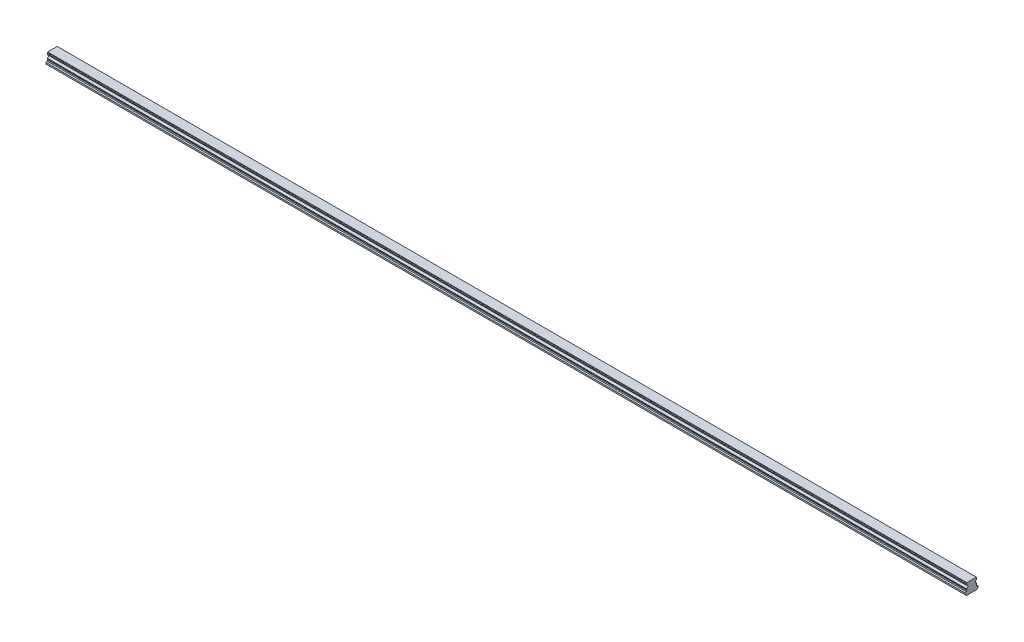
ISO-10303-21;
HEADER;
FILE_DESCRIPTION(('STEP AP214'),'2;1');
FILE_NAME('part.step','',(''),(''),'','','');
FILE_SCHEMA(('AUTOMOTIVE_DESIGN { 1 0 10303 214 1 1 1 1 }'));
ENDSEC;
DATA;
#1=APPLICATION_CONTEXT('core data for automotive mechanical design processes');
#2=APPLICATION_PROTOCOL_DEFINITION('international standard','automotive_design',2000,#1);
#3=PRODUCT_CONTEXT('',#1,'mechanical');
#4=PRODUCT('Part','Part','',(#3));
#5=PRODUCT_RELATED_PRODUCT_CATEGORY('part','',(#4));
#6=PRODUCT_DEFINITION_FORMATION('','',#4);
#7=PRODUCT_DEFINITION_CONTEXT('part definition',#1,'design');
#8=PRODUCT_DEFINITION('design','',#6,#7);
#9=PRODUCT_DEFINITION_SHAPE('','',#8);
#10=(LENGTH_UNIT() NAMED_UNIT(*) SI_UNIT(.MILLI.,.METRE.));
#11=(NAMED_UNIT(*) PLANE_ANGLE_UNIT() SI_UNIT($,.RADIAN.));
#12=(NAMED_UNIT(*) SI_UNIT($,.STERADIAN.) SOLID_ANGLE_UNIT());
#13=UNCERTAINTY_MEASURE_WITH_UNIT(LENGTH_MEASURE(1.E-05),#10,'distance_accuracy_value','');
#14=(GEOMETRIC_REPRESENTATION_CONTEXT(3) GLOBAL_UNCERTAINTY_ASSIGNED_CONTEXT((#13)) GLOBAL_UNIT_ASSIGNED_CONTEXT((#10,
#11,#12)) REPRESENTATION_CONTEXT('',''));
#15=CARTESIAN_POINT('',(0.,0.,0.));
#16=DIRECTION('',(0.,0.,1.));
#17=DIRECTION('',(1.,0.,0.));
#18=AXIS2_PLACEMENT_3D('',#15,#16,#17);
#19=CARTESIAN_POINT('',(1770.,0.499999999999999,0.));
#20=DIRECTION('',(0.,-1.,0.));
#21=DIRECTION('',(0.,0.,-1.));
#22=AXIS2_PLACEMENT_3D('',#19,#20,#21);
#23=CONICAL_SURFACE('',#22,3.5,0.785398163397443);
#24=CARTESIAN_POINT('',(1770.,1.00000000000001,0.));
#25=DIRECTION('',(0.,1.,0.));
#26=DIRECTION('',(0.,0.,1.));
#27=AXIS2_PLACEMENT_3D('',#24,#25,#26);
#28=CIRCLE('',#27,3.);
#29=CARTESIAN_POINT('',(1770.,1.00000000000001,3.));
#30=VERTEX_POINT('',#29);
#31=EDGE_CURVE('E11',#30,#30,#28,.F.);
#32=ORIENTED_EDGE('',*,*,#31,.F.);
#33=EDGE_LOOP('',(#32));
#34=FACE_BOUND('',#33,.T.);
#35=CARTESIAN_POINT('',(1770.,0.499999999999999,0.));
#36=DIRECTION('',(0.,1.,0.));
#37=DIRECTION('',(0.,0.,1.));
#38=AXIS2_PLACEMENT_3D('',#35,#36,#37);
#39=CIRCLE('',#38,3.5);
#40=CARTESIAN_POINT('',(1770.,0.5,3.5));
#41=VERTEX_POINT('',#40);
#42=EDGE_CURVE('E758',#41,#41,#39,.T.);
#43=ORIENTED_EDGE('',*,*,#42,.F.);
#44=EDGE_LOOP('',(#43));
#45=FACE_BOUND('',#44,.T.);
#46=ADVANCED_FACE('F39',(#34,#45),#23,.F.);
#47=CARTESIAN_POINT('',(1770.,12.,0.));
#48=DIRECTION('',(0.,-1.,0.));
#49=DIRECTION('',(0.,0.,-1.));
#50=AXIS2_PLACEMENT_3D('',#47,#48,#49);
#51=CYLINDRICAL_SURFACE('',#50,3.);
#52=ORIENTED_EDGE('',*,*,#31,.T.);
#53=EDGE_LOOP('',(#52));
#54=FACE_BOUND('',#53,.T.);
#55=CARTESIAN_POINT('',(1770.,12.,0.));
#56=DIRECTION('',(0.,-1.,0.));
#57=DIRECTION('',(0.,0.,-1.));
#58=AXIS2_PLACEMENT_3D('',#55,#56,#57);
#59=CIRCLE('',#58,3.);
#60=CARTESIAN_POINT('',(1770.,12.,-3.));
#61=VERTEX_POINT('',#60);
#62=EDGE_CURVE('E49',#61,#61,#59,.T.);
#63=ORIENTED_EDGE('',*,*,#62,.F.);
#64=EDGE_LOOP('',(#63));
#65=FACE_BOUND('',#64,.T.);
#66=ADVANCED_FACE('F1042',(#54,#65),#51,.F.);
#67=CARTESIAN_POINT('',(1770.,12.,0.));
#68=DIRECTION('',(0.,-1.,0.));
#69=DIRECTION('',(0.,0.,-1.));
#70=AXIS2_PLACEMENT_3D('',#67,#68,#69);
#71=PLANE('',#70);
#72=CARTESIAN_POINT('',(1770.,12.,0.));
#73=DIRECTION('',(0.,-1.,0.));
#74=DIRECTION('',(0.,0.,-1.));
#75=AXIS2_PLACEMENT_3D('',#72,#73,#74);
#76=CIRCLE('',#75,2.5);
#77=CARTESIAN_POINT('',(1770.,12.,-2.5));
#78=VERTEX_POINT('',#77);
#79=EDGE_CURVE('E42',#78,#78,#76,.T.);
#80=ORIENTED_EDGE('',*,*,#79,.F.);
#81=EDGE_LOOP('',(#80));
#82=FACE_BOUND('',#81,.T.);
#83=ORIENTED_EDGE('',*,*,#62,.T.);
#84=EDGE_LOOP('',(#83));
#85=FACE_BOUND('',#84,.T.);
#86=ADVANCED_FACE('F1047',(#82,#85),#71,.T.);
#87=CARTESIAN_POINT('',(1710.,0.499999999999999,0.));
#88=DIRECTION('',(0.,-1.,0.));
#89=DIRECTION('',(0.,0.,-1.));
#90=AXIS2_PLACEMENT_3D('',#87,#88,#89);
#91=CONICAL_SURFACE('',#90,3.5,0.785398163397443);
#92=CARTESIAN_POINT('',(1710.,1.00000000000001,0.));
#93=DIRECTION('',(0.,1.,0.));
#94=DIRECTION('',(0.,0.,1.));
#95=AXIS2_PLACEMENT_3D('',#92,#93,#94);
#96=CIRCLE('',#95,3.);
#97=CARTESIAN_POINT('',(1710.,1.00000000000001,3.));
#98=VERTEX_POINT('',#97);
#99=EDGE_CURVE('E754',#98,#98,#96,.F.);
#100=ORIENTED_EDGE('',*,*,#99,.F.);
#101=EDGE_LOOP('',(#100));
#102=FACE_BOUND('',#101,.T.);
#103=CARTESIAN_POINT('',(1710.,0.499999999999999,0.));
#104=DIRECTION('',(0.,1.,0.));
#105=DIRECTION('',(0.,0.,1.));
#106=AXIS2_PLACEMENT_3D('',#103,#104,#105);
#107=CIRCLE('',#106,3.5);
#108=CARTESIAN_POINT('',(1710.,0.5,3.5));
#109=VERTEX_POINT('',#108);
#110=EDGE_CURVE('E746',#109,#109,#107,.T.);
#111=ORIENTED_EDGE('',*,*,#110,.F.);
#112=EDGE_LOOP('',(#111));
#113=FACE_BOUND('',#112,.T.);
#114=ADVANCED_FACE('F1446',(#102,#113),#91,.F.);
#115=CARTESIAN_POINT('',(1710.,12.,0.));
#116=DIRECTION('',(0.,-1.,0.));
#117=DIRECTION('',(0.,0.,-1.));
#118=AXIS2_PLACEMENT_3D('',#115,#116,#117);
#119=CYLINDRICAL_SURFACE('',#118,3.);
#120=ORIENTED_EDGE('',*,*,#99,.T.);
#121=EDGE_LOOP('',(#120));
#122=FACE_BOUND('',#121,.T.);
#123=CARTESIAN_POINT('',(1710.,12.,0.));
#124=DIRECTION('',(0.,-1.,0.));
#125=DIRECTION('',(0.,0.,-1.));
#126=AXIS2_PLACEMENT_3D('',#123,#124,#125);
#127=CIRCLE('',#126,3.);
#128=CARTESIAN_POINT('',(1710.,12.,-3.));
#129=VERTEX_POINT('',#128);
#130=EDGE_CURVE('E750',#129,#129,#127,.T.);
#131=ORIENTED_EDGE('',*,*,#130,.F.);
#132=EDGE_LOOP('',(#131));
#133=FACE_BOUND('',#132,.T.);
#134=ADVANCED_FACE('F1442',(#122,#133),#119,.F.);
#135=CARTESIAN_POINT('',(1710.,12.,0.));
#136=DIRECTION('',(0.,-1.,0.));
#137=DIRECTION('',(0.,0.,-1.));
#138=AXIS2_PLACEMENT_3D('',#135,#136,#137);
#139=PLANE('',#138);
#140=CARTESIAN_POINT('',(1710.,12.,0.));
#141=DIRECTION('',(0.,-1.,0.));
#142=DIRECTION('',(0.,0.,-1.));
#143=AXIS2_PLACEMENT_3D('',#140,#141,#142);
#144=CIRCLE('',#143,2.5);
#145=CARTESIAN_POINT('',(1710.,12.,-2.5));
#146=VERTEX_POINT('',#145);
#147=EDGE_CURVE('E872',#146,#146,#144,.T.);
#148=ORIENTED_EDGE('',*,*,#147,.F.);
#149=EDGE_LOOP('',(#148));
#150=FACE_BOUND('',#149,.T.);
#151=ORIENTED_EDGE('',*,*,#130,.T.);
#152=EDGE_LOOP('',(#151));
#153=FACE_BOUND('',#152,.T.);
#154=ADVANCED_FACE('F1438',(#150,#153),#139,.T.);
#155=CARTESIAN_POINT('',(1650.,0.499999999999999,0.));
#156=DIRECTION('',(0.,-1.,0.));
#157=DIRECTION('',(0.,0.,-1.));
#158=AXIS2_PLACEMENT_3D('',#155,#156,#157);
#159=CONICAL_SURFACE('',#158,3.5,0.785398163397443);
#160=CARTESIAN_POINT('',(1650.,1.00000000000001,0.));
#161=DIRECTION('',(0.,1.,0.));
#162=DIRECTION('',(0.,0.,1.));
#163=AXIS2_PLACEMENT_3D('',#160,#161,#162);
#164=CIRCLE('',#163,3.);
#165=CARTESIAN_POINT('',(1650.,1.00000000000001,3.));
#166=VERTEX_POINT('',#165);
#167=EDGE_CURVE('E742',#166,#166,#164,.F.);
#168=ORIENTED_EDGE('',*,*,#167,.F.);
#169=EDGE_LOOP('',(#168));
#170=FACE_BOUND('',#169,.T.);
#171=CARTESIAN_POINT('',(1650.,0.499999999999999,0.));
#172=DIRECTION('',(0.,1.,0.));
#173=DIRECTION('',(0.,0.,1.));
#174=AXIS2_PLACEMENT_3D('',#171,#172,#173);
#175=CIRCLE('',#174,3.5);
#176=CARTESIAN_POINT('',(1650.,0.5,3.5));
#177=VERTEX_POINT('',#176);
#178=EDGE_CURVE('E734',#177,#177,#175,.T.);
#179=ORIENTED_EDGE('',*,*,#178,.F.);
#180=EDGE_LOOP('',(#179));
#181=FACE_BOUND('',#180,.T.);
#182=ADVANCED_FACE('F1434',(#170,#181),#159,.F.);
#183=CARTESIAN_POINT('',(1650.,12.,0.));
#184=DIRECTION('',(0.,-1.,0.));
#185=DIRECTION('',(0.,0.,-1.));
#186=AXIS2_PLACEMENT_3D('',#183,#184,#185);
#187=CYLINDRICAL_SURFACE('',#186,3.);
#188=ORIENTED_EDGE('',*,*,#167,.T.);
#189=EDGE_LOOP('',(#188));
#190=FACE_BOUND('',#189,.T.);
#191=CARTESIAN_POINT('',(1650.,12.,0.));
#192=DIRECTION('',(0.,-1.,0.));
#193=DIRECTION('',(0.,0.,-1.));
#194=AXIS2_PLACEMENT_3D('',#191,#192,#193);
#195=CIRCLE('',#194,3.);
#196=CARTESIAN_POINT('',(1650.,12.,-3.));
#197=VERTEX_POINT('',#196);
#198=EDGE_CURVE('E738',#197,#197,#195,.T.);
#199=ORIENTED_EDGE('',*,*,#198,.F.);
#200=EDGE_LOOP('',(#199));
#201=FACE_BOUND('',#200,.T.);
#202=ADVANCED_FACE('F1430',(#190,#201),#187,.F.);
#203=CARTESIAN_POINT('',(1650.,12.,0.));
#204=DIRECTION('',(0.,-1.,0.));
#205=DIRECTION('',(0.,0.,-1.));
#206=AXIS2_PLACEMENT_3D('',#203,#204,#205);
#207=PLANE('',#206);
#208=CARTESIAN_POINT('',(1650.,12.,0.));
#209=DIRECTION('',(0.,-1.,0.));
#210=DIRECTION('',(0.,0.,-1.));
#211=AXIS2_PLACEMENT_3D('',#208,#209,#210);
#212=CIRCLE('',#211,2.5);
#213=CARTESIAN_POINT('',(1650.,12.,-2.5));
#214=VERTEX_POINT('',#213);
#215=EDGE_CURVE('E869',#214,#214,#212,.T.);
#216=ORIENTED_EDGE('',*,*,#215,.F.);
#217=EDGE_LOOP('',(#216));
#218=FACE_BOUND('',#217,.T.);
#219=ORIENTED_EDGE('',*,*,#198,.T.);
#220=EDGE_LOOP('',(#219));
#221=FACE_BOUND('',#220,.T.);
#222=ADVANCED_FACE('F1426',(#218,#221),#207,.T.);
#223=CARTESIAN_POINT('',(1590.,0.499999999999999,0.));
#224=DIRECTION('',(0.,-1.,0.));
#225=DIRECTION('',(0.,0.,-1.));
#226=AXIS2_PLACEMENT_3D('',#223,#224,#225);
#227=CONICAL_SURFACE('',#226,3.5,0.785398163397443);
#228=CARTESIAN_POINT('',(1590.,1.00000000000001,0.));
#229=DIRECTION('',(0.,1.,0.));
#230=DIRECTION('',(0.,0.,1.));
#231=AXIS2_PLACEMENT_3D('',#228,#229,#230);
#232=CIRCLE('',#231,3.);
#233=CARTESIAN_POINT('',(1590.,1.00000000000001,3.));
#234=VERTEX_POINT('',#233);
#235=EDGE_CURVE('E730',#234,#234,#232,.F.);
#236=ORIENTED_EDGE('',*,*,#235,.F.);
#237=EDGE_LOOP('',(#236));
#238=FACE_BOUND('',#237,.T.);
#239=CARTESIAN_POINT('',(1590.,0.499999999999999,0.));
#240=DIRECTION('',(0.,1.,0.));
#241=DIRECTION('',(0.,0.,1.));
#242=AXIS2_PLACEMENT_3D('',#239,#240,#241);
#243=CIRCLE('',#242,3.5);
#244=CARTESIAN_POINT('',(1590.,0.5,3.5));
#245=VERTEX_POINT('',#244);
#246=EDGE_CURVE('E722',#245,#245,#243,.T.);
#247=ORIENTED_EDGE('',*,*,#246,.F.);
#248=EDGE_LOOP('',(#247));
#249=FACE_BOUND('',#248,.T.);
#250=ADVANCED_FACE('F1422',(#238,#249),#227,.F.);
#251=CARTESIAN_POINT('',(1590.,12.,0.));
#252=DIRECTION('',(0.,-1.,0.));
#253=DIRECTION('',(0.,0.,-1.));
#254=AXIS2_PLACEMENT_3D('',#251,#252,#253);
#255=CYLINDRICAL_SURFACE('',#254,3.);
#256=ORIENTED_EDGE('',*,*,#235,.T.);
#257=EDGE_LOOP('',(#256));
#258=FACE_BOUND('',#257,.T.);
#259=CARTESIAN_POINT('',(1590.,12.,0.));
#260=DIRECTION('',(0.,-1.,0.));
#261=DIRECTION('',(0.,0.,-1.));
#262=AXIS2_PLACEMENT_3D('',#259,#260,#261);
#263=CIRCLE('',#262,3.);
#264=CARTESIAN_POINT('',(1590.,12.,-3.));
#265=VERTEX_POINT('',#264);
#266=EDGE_CURVE('E726',#265,#265,#263,.T.);
#267=ORIENTED_EDGE('',*,*,#266,.F.);
#268=EDGE_LOOP('',(#267));
#269=FACE_BOUND('',#268,.T.);
#270=ADVANCED_FACE('F1418',(#258,#269),#255,.F.);
#271=CARTESIAN_POINT('',(1590.,12.,0.));
#272=DIRECTION('',(0.,-1.,0.));
#273=DIRECTION('',(0.,0.,-1.));
#274=AXIS2_PLACEMENT_3D('',#271,#272,#273);
#275=PLANE('',#274);
#276=CARTESIAN_POINT('',(1590.,12.,0.));
#277=DIRECTION('',(0.,-1.,0.));
#278=DIRECTION('',(0.,0.,-1.));
#279=AXIS2_PLACEMENT_3D('',#276,#277,#278);
#280=CIRCLE('',#279,2.5);
#281=CARTESIAN_POINT('',(1590.,12.,-2.5));
#282=VERTEX_POINT('',#281);
#283=EDGE_CURVE('E865',#282,#282,#280,.T.);
#284=ORIENTED_EDGE('',*,*,#283,.F.);
#285=EDGE_LOOP('',(#284));
#286=FACE_BOUND('',#285,.T.);
#287=ORIENTED_EDGE('',*,*,#266,.T.);
#288=EDGE_LOOP('',(#287));
#289=FACE_BOUND('',#288,.T.);
#290=ADVANCED_FACE('F1414',(#286,#289),#275,.T.);
#291=CARTESIAN_POINT('',(1530.,0.499999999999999,0.));
#292=DIRECTION('',(0.,-1.,0.));
#293=DIRECTION('',(0.,0.,-1.));
#294=AXIS2_PLACEMENT_3D('',#291,#292,#293);
#295=CONICAL_SURFACE('',#294,3.5,0.785398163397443);
#296=CARTESIAN_POINT('',(1530.,1.00000000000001,0.));
#297=DIRECTION('',(0.,1.,0.));
#298=DIRECTION('',(0.,0.,1.));
#299=AXIS2_PLACEMENT_3D('',#296,#297,#298);
#300=CIRCLE('',#299,3.);
#301=CARTESIAN_POINT('',(1530.,1.00000000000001,3.));
#302=VERTEX_POINT('',#301);
#303=EDGE_CURVE('E718',#302,#302,#300,.F.);
#304=ORIENTED_EDGE('',*,*,#303,.F.);
#305=EDGE_LOOP('',(#304));
#306=FACE_BOUND('',#305,.T.);
#307=CARTESIAN_POINT('',(1530.,0.499999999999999,0.));
#308=DIRECTION('',(0.,1.,0.));
#309=DIRECTION('',(0.,0.,1.));
#310=AXIS2_PLACEMENT_3D('',#307,#308,#309);
#311=CIRCLE('',#310,3.5);
#312=CARTESIAN_POINT('',(1530.,0.5,3.5));
#313=VERTEX_POINT('',#312);
#314=EDGE_CURVE('E710',#313,#313,#311,.T.);
#315=ORIENTED_EDGE('',*,*,#314,.F.);
#316=EDGE_LOOP('',(#315));
#317=FACE_BOUND('',#316,.T.);
#318=ADVANCED_FACE('F1410',(#306,#317),#295,.F.);
#319=CARTESIAN_POINT('',(1530.,12.,0.));
#320=DIRECTION('',(0.,-1.,0.));
#321=DIRECTION('',(0.,0.,-1.));
#322=AXIS2_PLACEMENT_3D('',#319,#320,#321);
#323=CYLINDRICAL_SURFACE('',#322,3.);
#324=ORIENTED_EDGE('',*,*,#303,.T.);
#325=EDGE_LOOP('',(#324));
#326=FACE_BOUND('',#325,.T.);
#327=CARTESIAN_POINT('',(1530.,12.,0.));
#328=DIRECTION('',(0.,-1.,0.));
#329=DIRECTION('',(0.,0.,-1.));
#330=AXIS2_PLACEMENT_3D('',#327,#328,#329);
#331=CIRCLE('',#330,3.);
#332=CARTESIAN_POINT('',(1530.,12.,-3.));
#333=VERTEX_POINT('',#332);
#334=EDGE_CURVE('E714',#333,#333,#331,.T.);
#335=ORIENTED_EDGE('',*,*,#334,.F.);
#336=EDGE_LOOP('',(#335));
#337=FACE_BOUND('',#336,.T.);
#338=ADVANCED_FACE('F1406',(#326,#337),#323,.F.);
#339=CARTESIAN_POINT('',(1530.,12.,0.));
#340=DIRECTION('',(0.,-1.,0.));
#341=DIRECTION('',(0.,0.,-1.));
#342=AXIS2_PLACEMENT_3D('',#339,#340,#341);
#343=PLANE('',#342);
#344=CARTESIAN_POINT('',(1530.,12.,0.));
#345=DIRECTION('',(0.,-1.,0.));
#346=DIRECTION('',(0.,0.,-1.));
#347=AXIS2_PLACEMENT_3D('',#344,#345,#346);
#348=CIRCLE('',#347,2.5);
#349=CARTESIAN_POINT('',(1530.,12.,-2.5));
#350=VERTEX_POINT('',#349);
#351=EDGE_CURVE('E861',#350,#350,#348,.T.);
#352=ORIENTED_EDGE('',*,*,#351,.F.);
#353=EDGE_LOOP('',(#352));
#354=FACE_BOUND('',#353,.T.);
#355=ORIENTED_EDGE('',*,*,#334,.T.);
#356=EDGE_LOOP('',(#355));
#357=FACE_BOUND('',#356,.T.);
#358=ADVANCED_FACE('F1402',(#354,#357),#343,.T.);
#359=CARTESIAN_POINT('',(1470.,0.499999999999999,0.));
#360=DIRECTION('',(0.,-1.,0.));
#361=DIRECTION('',(0.,0.,-1.));
#362=AXIS2_PLACEMENT_3D('',#359,#360,#361);
#363=CONICAL_SURFACE('',#362,3.5,0.785398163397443);
#364=CARTESIAN_POINT('',(1470.,1.00000000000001,0.));
#365=DIRECTION('',(0.,1.,0.));
#366=DIRECTION('',(0.,0.,1.));
#367=AXIS2_PLACEMENT_3D('',#364,#365,#366);
#368=CIRCLE('',#367,3.);
#369=CARTESIAN_POINT('',(1470.,1.00000000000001,3.));
#370=VERTEX_POINT('',#369);
#371=EDGE_CURVE('E706',#370,#370,#368,.F.);
#372=ORIENTED_EDGE('',*,*,#371,.F.);
#373=EDGE_LOOP('',(#372));
#374=FACE_BOUND('',#373,.T.);
#375=CARTESIAN_POINT('',(1470.,0.499999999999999,0.));
#376=DIRECTION('',(0.,1.,0.));
#377=DIRECTION('',(0.,0.,1.));
#378=AXIS2_PLACEMENT_3D('',#375,#376,#377);
#379=CIRCLE('',#378,3.5);
#380=CARTESIAN_POINT('',(1470.,0.5,3.5));
#381=VERTEX_POINT('',#380);
#382=EDGE_CURVE('E698',#381,#381,#379,.T.);
#383=ORIENTED_EDGE('',*,*,#382,.F.);
#384=EDGE_LOOP('',(#383));
#385=FACE_BOUND('',#384,.T.);
#386=ADVANCED_FACE('F1398',(#374,#385),#363,.F.);
#387=CARTESIAN_POINT('',(1470.,12.,0.));
#388=DIRECTION('',(0.,-1.,0.));
#389=DIRECTION('',(0.,0.,-1.));
#390=AXIS2_PLACEMENT_3D('',#387,#388,#389);
#391=CYLINDRICAL_SURFACE('',#390,3.);
#392=ORIENTED_EDGE('',*,*,#371,.T.);
#393=EDGE_LOOP('',(#392));
#394=FACE_BOUND('',#393,.T.);
#395=CARTESIAN_POINT('',(1470.,12.,0.));
#396=DIRECTION('',(0.,-1.,0.));
#397=DIRECTION('',(0.,0.,-1.));
#398=AXIS2_PLACEMENT_3D('',#395,#396,#397);
#399=CIRCLE('',#398,3.);
#400=CARTESIAN_POINT('',(1470.,12.,-3.));
#401=VERTEX_POINT('',#400);
#402=EDGE_CURVE('E702',#401,#401,#399,.T.);
#403=ORIENTED_EDGE('',*,*,#402,.F.);
#404=EDGE_LOOP('',(#403));
#405=FACE_BOUND('',#404,.T.);
#406=ADVANCED_FACE('F1394',(#394,#405),#391,.F.);
#407=CARTESIAN_POINT('',(1470.,12.,0.));
#408=DIRECTION('',(0.,-1.,0.));
#409=DIRECTION('',(0.,0.,-1.));
#410=AXIS2_PLACEMENT_3D('',#407,#408,#409);
#411=PLANE('',#410);
#412=CARTESIAN_POINT('',(1470.,12.,0.));
#413=DIRECTION('',(0.,-1.,0.));
#414=DIRECTION('',(0.,0.,-1.));
#415=AXIS2_PLACEMENT_3D('',#412,#413,#414);
#416=CIRCLE('',#415,2.5);
#417=CARTESIAN_POINT('',(1470.,12.,-2.5));
#418=VERTEX_POINT('',#417);
#419=EDGE_CURVE('E857',#418,#418,#416,.T.);
#420=ORIENTED_EDGE('',*,*,#419,.F.);
#421=EDGE_LOOP('',(#420));
#422=FACE_BOUND('',#421,.T.);
#423=ORIENTED_EDGE('',*,*,#402,.T.);
#424=EDGE_LOOP('',(#423));
#425=FACE_BOUND('',#424,.T.);
#426=ADVANCED_FACE('F1390',(#422,#425),#411,.T.);
#427=CARTESIAN_POINT('',(1410.,0.499999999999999,0.));
#428=DIRECTION('',(0.,-1.,0.));
#429=DIRECTION('',(0.,0.,-1.));
#430=AXIS2_PLACEMENT_3D('',#427,#428,#429);
#431=CONICAL_SURFACE('',#430,3.5,0.785398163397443);
#432=CARTESIAN_POINT('',(1410.,1.00000000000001,0.));
#433=DIRECTION('',(0.,1.,0.));
#434=DIRECTION('',(0.,0.,1.));
#435=AXIS2_PLACEMENT_3D('',#432,#433,#434);
#436=CIRCLE('',#435,3.);
#437=CARTESIAN_POINT('',(1410.,1.00000000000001,3.));
#438=VERTEX_POINT('',#437);
#439=EDGE_CURVE('E694',#438,#438,#436,.F.);
#440=ORIENTED_EDGE('',*,*,#439,.F.);
#441=EDGE_LOOP('',(#440));
#442=FACE_BOUND('',#441,.T.);
#443=CARTESIAN_POINT('',(1410.,0.499999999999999,0.));
#444=DIRECTION('',(0.,1.,0.));
#445=DIRECTION('',(0.,0.,1.));
#446=AXIS2_PLACEMENT_3D('',#443,#444,#445);
#447=CIRCLE('',#446,3.5);
#448=CARTESIAN_POINT('',(1410.,0.5,3.5));
#449=VERTEX_POINT('',#448);
#450=EDGE_CURVE('E686',#449,#449,#447,.T.);
#451=ORIENTED_EDGE('',*,*,#450,.F.);
#452=EDGE_LOOP('',(#451));
#453=FACE_BOUND('',#452,.T.);
#454=ADVANCED_FACE('F1386',(#442,#453),#431,.F.);
#455=CARTESIAN_POINT('',(1410.,12.,0.));
#456=DIRECTION('',(0.,-1.,0.));
#457=DIRECTION('',(0.,0.,-1.));
#458=AXIS2_PLACEMENT_3D('',#455,#456,#457);
#459=CYLINDRICAL_SURFACE('',#458,3.);
#460=ORIENTED_EDGE('',*,*,#439,.T.);
#461=EDGE_LOOP('',(#460));
#462=FACE_BOUND('',#461,.T.);
#463=CARTESIAN_POINT('',(1410.,12.,0.));
#464=DIRECTION('',(0.,-1.,0.));
#465=DIRECTION('',(0.,0.,-1.));
#466=AXIS2_PLACEMENT_3D('',#463,#464,#465);
#467=CIRCLE('',#466,3.);
#468=CARTESIAN_POINT('',(1410.,12.,-3.));
#469=VERTEX_POINT('',#468);
#470=EDGE_CURVE('E690',#469,#469,#467,.T.);
#471=ORIENTED_EDGE('',*,*,#470,.F.);
#472=EDGE_LOOP('',(#471));
#473=FACE_BOUND('',#472,.T.);
#474=ADVANCED_FACE('F1382',(#462,#473),#459,.F.);
#475=CARTESIAN_POINT('',(1410.,12.,0.));
#476=DIRECTION('',(0.,-1.,0.));
#477=DIRECTION('',(0.,0.,-1.));
#478=AXIS2_PLACEMENT_3D('',#475,#476,#477);
#479=PLANE('',#478);
#480=CARTESIAN_POINT('',(1410.,12.,0.));
#481=DIRECTION('',(0.,-1.,0.));
#482=DIRECTION('',(0.,0.,-1.));
#483=AXIS2_PLACEMENT_3D('',#480,#481,#482);
#484=CIRCLE('',#483,2.5);
#485=CARTESIAN_POINT('',(1410.,12.,-2.5));
#486=VERTEX_POINT('',#485);
#487=EDGE_CURVE('E853',#486,#486,#484,.T.);
#488=ORIENTED_EDGE('',*,*,#487,.F.);
#489=EDGE_LOOP('',(#488));
#490=FACE_BOUND('',#489,.T.);
#491=ORIENTED_EDGE('',*,*,#470,.T.);
#492=EDGE_LOOP('',(#491));
#493=FACE_BOUND('',#492,.T.);
#494=ADVANCED_FACE('F1378',(#490,#493),#479,.T.);
#495=CARTESIAN_POINT('',(1350.,0.499999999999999,0.));
#496=DIRECTION('',(0.,-1.,0.));
#497=DIRECTION('',(0.,0.,-1.));
#498=AXIS2_PLACEMENT_3D('',#495,#496,#497);
#499=CONICAL_SURFACE('',#498,3.5,0.785398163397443);
#500=CARTESIAN_POINT('',(1350.,1.00000000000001,0.));
#501=DIRECTION('',(0.,1.,0.));
#502=DIRECTION('',(0.,0.,1.));
#503=AXIS2_PLACEMENT_3D('',#500,#501,#502);
#504=CIRCLE('',#503,3.);
#505=CARTESIAN_POINT('',(1350.,1.00000000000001,3.));
#506=VERTEX_POINT('',#505);
#507=EDGE_CURVE('E682',#506,#506,#504,.F.);
#508=ORIENTED_EDGE('',*,*,#507,.F.);
#509=EDGE_LOOP('',(#508));
#510=FACE_BOUND('',#509,.T.);
#511=CARTESIAN_POINT('',(1350.,0.499999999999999,0.));
#512=DIRECTION('',(0.,1.,0.));
#513=DIRECTION('',(0.,0.,1.));
#514=AXIS2_PLACEMENT_3D('',#511,#512,#513);
#515=CIRCLE('',#514,3.5);
#516=CARTESIAN_POINT('',(1350.,0.5,3.5));
#517=VERTEX_POINT('',#516);
#518=EDGE_CURVE('E674',#517,#517,#515,.T.);
#519=ORIENTED_EDGE('',*,*,#518,.F.);
#520=EDGE_LOOP('',(#519));
#521=FACE_BOUND('',#520,.T.);
#522=ADVANCED_FACE('F1374',(#510,#521),#499,.F.);
#523=CARTESIAN_POINT('',(1350.,12.,0.));
#524=DIRECTION('',(0.,-1.,0.));
#525=DIRECTION('',(0.,0.,-1.));
#526=AXIS2_PLACEMENT_3D('',#523,#524,#525);
#527=CYLINDRICAL_SURFACE('',#526,3.);
#528=ORIENTED_EDGE('',*,*,#507,.T.);
#529=EDGE_LOOP('',(#528));
#530=FACE_BOUND('',#529,.T.);
#531=CARTESIAN_POINT('',(1350.,12.,0.));
#532=DIRECTION('',(0.,-1.,0.));
#533=DIRECTION('',(0.,0.,-1.));
#534=AXIS2_PLACEMENT_3D('',#531,#532,#533);
#535=CIRCLE('',#534,3.);
#536=CARTESIAN_POINT('',(1350.,12.,-3.));
#537=VERTEX_POINT('',#536);
#538=EDGE_CURVE('E678',#537,#537,#535,.T.);
#539=ORIENTED_EDGE('',*,*,#538,.F.);
#540=EDGE_LOOP('',(#539));
#541=FACE_BOUND('',#540,.T.);
#542=ADVANCED_FACE('F1370',(#530,#541),#527,.F.);
#543=CARTESIAN_POINT('',(1350.,12.,0.));
#544=DIRECTION('',(0.,-1.,0.));
#545=DIRECTION('',(0.,0.,-1.));
#546=AXIS2_PLACEMENT_3D('',#543,#544,#545);
#547=PLANE('',#546);
#548=CARTESIAN_POINT('',(1350.,12.,0.));
#549=DIRECTION('',(0.,-1.,0.));
#550=DIRECTION('',(0.,0.,-1.));
#551=AXIS2_PLACEMENT_3D('',#548,#549,#550);
#552=CIRCLE('',#551,2.5);
#553=CARTESIAN_POINT('',(1350.,12.,-2.5));
#554=VERTEX_POINT('',#553);
#555=EDGE_CURVE('E849',#554,#554,#552,.T.);
#556=ORIENTED_EDGE('',*,*,#555,.F.);
#557=EDGE_LOOP('',(#556));
#558=FACE_BOUND('',#557,.T.);
#559=ORIENTED_EDGE('',*,*,#538,.T.);
#560=EDGE_LOOP('',(#559));
#561=FACE_BOUND('',#560,.T.);
#562=ADVANCED_FACE('F1366',(#558,#561),#547,.T.);
#563=CARTESIAN_POINT('',(1290.,0.499999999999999,0.));
#564=DIRECTION('',(0.,-1.,0.));
#565=DIRECTION('',(0.,0.,-1.));
#566=AXIS2_PLACEMENT_3D('',#563,#564,#565);
#567=CONICAL_SURFACE('',#566,3.5,0.785398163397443);
#568=CARTESIAN_POINT('',(1290.,1.00000000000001,0.));
#569=DIRECTION('',(0.,1.,0.));
#570=DIRECTION('',(0.,0.,1.));
#571=AXIS2_PLACEMENT_3D('',#568,#569,#570);
#572=CIRCLE('',#571,3.);
#573=CARTESIAN_POINT('',(1290.,1.00000000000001,3.));
#574=VERTEX_POINT('',#573);
#575=EDGE_CURVE('E670',#574,#574,#572,.F.);
#576=ORIENTED_EDGE('',*,*,#575,.F.);
#577=EDGE_LOOP('',(#576));
#578=FACE_BOUND('',#577,.T.);
#579=CARTESIAN_POINT('',(1290.,0.499999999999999,0.));
#580=DIRECTION('',(0.,1.,0.));
#581=DIRECTION('',(0.,0.,1.));
#582=AXIS2_PLACEMENT_3D('',#579,#580,#581);
#583=CIRCLE('',#582,3.5);
#584=CARTESIAN_POINT('',(1290.,0.5,3.5));
#585=VERTEX_POINT('',#584);
#586=EDGE_CURVE('E662',#585,#585,#583,.T.);
#587=ORIENTED_EDGE('',*,*,#586,.F.);
#588=EDGE_LOOP('',(#587));
#589=FACE_BOUND('',#588,.T.);
#590=ADVANCED_FACE('F1362',(#578,#589),#567,.F.);
#591=CARTESIAN_POINT('',(1290.,12.,0.));
#592=DIRECTION('',(0.,-1.,0.));
#593=DIRECTION('',(0.,0.,-1.));
#594=AXIS2_PLACEMENT_3D('',#591,#592,#593);
#595=CYLINDRICAL_SURFACE('',#594,3.);
#596=ORIENTED_EDGE('',*,*,#575,.T.);
#597=EDGE_LOOP('',(#596));
#598=FACE_BOUND('',#597,.T.);
#599=CARTESIAN_POINT('',(1290.,12.,0.));
#600=DIRECTION('',(0.,-1.,0.));
#601=DIRECTION('',(0.,0.,-1.));
#602=AXIS2_PLACEMENT_3D('',#599,#600,#601);
#603=CIRCLE('',#602,3.);
#604=CARTESIAN_POINT('',(1290.,12.,-3.));
#605=VERTEX_POINT('',#604);
#606=EDGE_CURVE('E666',#605,#605,#603,.T.);
#607=ORIENTED_EDGE('',*,*,#606,.F.);
#608=EDGE_LOOP('',(#607));
#609=FACE_BOUND('',#608,.T.);
#610=ADVANCED_FACE('F1358',(#598,#609),#595,.F.);
#611=CARTESIAN_POINT('',(1290.,12.,0.));
#612=DIRECTION('',(0.,-1.,0.));
#613=DIRECTION('',(0.,0.,-1.));
#614=AXIS2_PLACEMENT_3D('',#611,#612,#613);
#615=PLANE('',#614);
#616=CARTESIAN_POINT('',(1290.,12.,0.));
#617=DIRECTION('',(0.,-1.,0.));
#618=DIRECTION('',(0.,0.,-1.));
#619=AXIS2_PLACEMENT_3D('',#616,#617,#618);
#620=CIRCLE('',#619,2.5);
#621=CARTESIAN_POINT('',(1290.,12.,-2.5));
#622=VERTEX_POINT('',#621);
#623=EDGE_CURVE('E845',#622,#622,#620,.T.);
#624=ORIENTED_EDGE('',*,*,#623,.F.);
#625=EDGE_LOOP('',(#624));
#626=FACE_BOUND('',#625,.T.);
#627=ORIENTED_EDGE('',*,*,#606,.T.);
#628=EDGE_LOOP('',(#627));
#629=FACE_BOUND('',#628,.T.);
#630=ADVANCED_FACE('F1354',(#626,#629),#615,.T.);
#631=CARTESIAN_POINT('',(1230.,0.499999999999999,0.));
#632=DIRECTION('',(0.,-1.,0.));
#633=DIRECTION('',(0.,0.,-1.));
#634=AXIS2_PLACEMENT_3D('',#631,#632,#633);
#635=CONICAL_SURFACE('',#634,3.5,0.785398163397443);
#636=CARTESIAN_POINT('',(1230.,1.00000000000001,0.));
#637=DIRECTION('',(0.,1.,0.));
#638=DIRECTION('',(0.,0.,1.));
#639=AXIS2_PLACEMENT_3D('',#636,#637,#638);
#640=CIRCLE('',#639,3.);
#641=CARTESIAN_POINT('',(1230.,1.00000000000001,3.));
#642=VERTEX_POINT('',#641);
#643=EDGE_CURVE('E658',#642,#642,#640,.F.);
#644=ORIENTED_EDGE('',*,*,#643,.F.);
#645=EDGE_LOOP('',(#644));
#646=FACE_BOUND('',#645,.T.);
#647=CARTESIAN_POINT('',(1230.,0.499999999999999,0.));
#648=DIRECTION('',(0.,1.,0.));
#649=DIRECTION('',(0.,0.,1.));
#650=AXIS2_PLACEMENT_3D('',#647,#648,#649);
#651=CIRCLE('',#650,3.5);
#652=CARTESIAN_POINT('',(1230.,0.5,3.5));
#653=VERTEX_POINT('',#652);
#654=EDGE_CURVE('E650',#653,#653,#651,.T.);
#655=ORIENTED_EDGE('',*,*,#654,.F.);
#656=EDGE_LOOP('',(#655));
#657=FACE_BOUND('',#656,.T.);
#658=ADVANCED_FACE('F1350',(#646,#657),#635,.F.);
#659=CARTESIAN_POINT('',(1230.,12.,0.));
#660=DIRECTION('',(0.,-1.,0.));
#661=DIRECTION('',(0.,0.,-1.));
#662=AXIS2_PLACEMENT_3D('',#659,#660,#661);
#663=CYLINDRICAL_SURFACE('',#662,3.);
#664=ORIENTED_EDGE('',*,*,#643,.T.);
#665=EDGE_LOOP('',(#664));
#666=FACE_BOUND('',#665,.T.);
#667=CARTESIAN_POINT('',(1230.,12.,0.));
#668=DIRECTION('',(0.,-1.,0.));
#669=DIRECTION('',(0.,0.,-1.));
#670=AXIS2_PLACEMENT_3D('',#667,#668,#669);
#671=CIRCLE('',#670,3.);
#672=CARTESIAN_POINT('',(1230.,12.,-3.));
#673=VERTEX_POINT('',#672);
#674=EDGE_CURVE('E654',#673,#673,#671,.T.);
#675=ORIENTED_EDGE('',*,*,#674,.F.);
#676=EDGE_LOOP('',(#675));
#677=FACE_BOUND('',#676,.T.);
#678=ADVANCED_FACE('F1346',(#666,#677),#663,.F.);
#679=CARTESIAN_POINT('',(1230.,12.,0.));
#680=DIRECTION('',(0.,-1.,0.));
#681=DIRECTION('',(0.,0.,-1.));
#682=AXIS2_PLACEMENT_3D('',#679,#680,#681);
#683=PLANE('',#682);
#684=CARTESIAN_POINT('',(1230.,12.,0.));
#685=DIRECTION('',(0.,-1.,0.));
#686=DIRECTION('',(0.,0.,-1.));
#687=AXIS2_PLACEMENT_3D('',#684,#685,#686);
#688=CIRCLE('',#687,2.5);
#689=CARTESIAN_POINT('',(1230.,12.,-2.5));
#690=VERTEX_POINT('',#689);
#691=EDGE_CURVE('E841',#690,#690,#688,.T.);
#692=ORIENTED_EDGE('',*,*,#691,.F.);
#693=EDGE_LOOP('',(#692));
#694=FACE_BOUND('',#693,.T.);
#695=ORIENTED_EDGE('',*,*,#674,.T.);
#696=EDGE_LOOP('',(#695));
#697=FACE_BOUND('',#696,.T.);
#698=ADVANCED_FACE('F1342',(#694,#697),#683,.T.);
#699=CARTESIAN_POINT('',(1170.,0.499999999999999,0.));
#700=DIRECTION('',(0.,-1.,0.));
#701=DIRECTION('',(0.,0.,-1.));
#702=AXIS2_PLACEMENT_3D('',#699,#700,#701);
#703=CONICAL_SURFACE('',#702,3.5,0.785398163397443);
#704=CARTESIAN_POINT('',(1170.,1.00000000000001,0.));
#705=DIRECTION('',(0.,1.,0.));
#706=DIRECTION('',(0.,0.,1.));
#707=AXIS2_PLACEMENT_3D('',#704,#705,#706);
#708=CIRCLE('',#707,3.);
#709=CARTESIAN_POINT('',(1170.,1.00000000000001,3.));
#710=VERTEX_POINT('',#709);
#711=EDGE_CURVE('E646',#710,#710,#708,.F.);
#712=ORIENTED_EDGE('',*,*,#711,.F.);
#713=EDGE_LOOP('',(#712));
#714=FACE_BOUND('',#713,.T.);
#715=CARTESIAN_POINT('',(1170.,0.499999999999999,0.));
#716=DIRECTION('',(0.,1.,0.));
#717=DIRECTION('',(0.,0.,1.));
#718=AXIS2_PLACEMENT_3D('',#715,#716,#717);
#719=CIRCLE('',#718,3.5);
#720=CARTESIAN_POINT('',(1170.,0.5,3.5));
#721=VERTEX_POINT('',#720);
#722=EDGE_CURVE('E638',#721,#721,#719,.T.);
#723=ORIENTED_EDGE('',*,*,#722,.F.);
#724=EDGE_LOOP('',(#723));
#725=FACE_BOUND('',#724,.T.);
#726=ADVANCED_FACE('F1338',(#714,#725),#703,.F.);
#727=CARTESIAN_POINT('',(1170.,12.,0.));
#728=DIRECTION('',(0.,-1.,0.));
#729=DIRECTION('',(0.,0.,-1.));
#730=AXIS2_PLACEMENT_3D('',#727,#728,#729);
#731=CYLINDRICAL_SURFACE('',#730,3.);
#732=ORIENTED_EDGE('',*,*,#711,.T.);
#733=EDGE_LOOP('',(#732));
#734=FACE_BOUND('',#733,.T.);
#735=CARTESIAN_POINT('',(1170.,12.,0.));
#736=DIRECTION('',(0.,-1.,0.));
#737=DIRECTION('',(0.,0.,-1.));
#738=AXIS2_PLACEMENT_3D('',#735,#736,#737);
#739=CIRCLE('',#738,3.);
#740=CARTESIAN_POINT('',(1170.,12.,-3.));
#741=VERTEX_POINT('',#740);
#742=EDGE_CURVE('E642',#741,#741,#739,.T.);
#743=ORIENTED_EDGE('',*,*,#742,.F.);
#744=EDGE_LOOP('',(#743));
#745=FACE_BOUND('',#744,.T.);
#746=ADVANCED_FACE('F1334',(#734,#745),#731,.F.);
#747=CARTESIAN_POINT('',(1170.,12.,0.));
#748=DIRECTION('',(0.,-1.,0.));
#749=DIRECTION('',(0.,0.,-1.));
#750=AXIS2_PLACEMENT_3D('',#747,#748,#749);
#751=PLANE('',#750);
#752=CARTESIAN_POINT('',(1170.,12.,0.));
#753=DIRECTION('',(0.,-1.,0.));
#754=DIRECTION('',(0.,0.,-1.));
#755=AXIS2_PLACEMENT_3D('',#752,#753,#754);
#756=CIRCLE('',#755,2.5);
#757=CARTESIAN_POINT('',(1170.,12.,-2.5));
#758=VERTEX_POINT('',#757);
#759=EDGE_CURVE('E837',#758,#758,#756,.T.);
#760=ORIENTED_EDGE('',*,*,#759,.F.);
#761=EDGE_LOOP('',(#760));
#762=FACE_BOUND('',#761,.T.);
#763=ORIENTED_EDGE('',*,*,#742,.T.);
#764=EDGE_LOOP('',(#763));
#765=FACE_BOUND('',#764,.T.);
#766=ADVANCED_FACE('F1330',(#762,#765),#751,.T.);
#767=CARTESIAN_POINT('',(1110.,0.499999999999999,0.));
#768=DIRECTION('',(0.,-1.,0.));
#769=DIRECTION('',(0.,0.,-1.));
#770=AXIS2_PLACEMENT_3D('',#767,#768,#769);
#771=CONICAL_SURFACE('',#770,3.5,0.785398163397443);
#772=CARTESIAN_POINT('',(1110.,1.00000000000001,0.));
#773=DIRECTION('',(0.,1.,0.));
#774=DIRECTION('',(0.,0.,1.));
#775=AXIS2_PLACEMENT_3D('',#772,#773,#774);
#776=CIRCLE('',#775,3.);
#777=CARTESIAN_POINT('',(1110.,1.00000000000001,3.));
#778=VERTEX_POINT('',#777);
#779=EDGE_CURVE('E634',#778,#778,#776,.F.);
#780=ORIENTED_EDGE('',*,*,#779,.F.);
#781=EDGE_LOOP('',(#780));
#782=FACE_BOUND('',#781,.T.);
#783=CARTESIAN_POINT('',(1110.,0.499999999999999,0.));
#784=DIRECTION('',(0.,1.,0.));
#785=DIRECTION('',(0.,0.,1.));
#786=AXIS2_PLACEMENT_3D('',#783,#784,#785);
#787=CIRCLE('',#786,3.5);
#788=CARTESIAN_POINT('',(1110.,0.5,3.5));
#789=VERTEX_POINT('',#788);
#790=EDGE_CURVE('E626',#789,#789,#787,.T.);
#791=ORIENTED_EDGE('',*,*,#790,.F.);
#792=EDGE_LOOP('',(#791));
#793=FACE_BOUND('',#792,.T.);
#794=ADVANCED_FACE('F1326',(#782,#793),#771,.F.);
#795=CARTESIAN_POINT('',(1110.,12.,0.));
#796=DIRECTION('',(0.,-1.,0.));
#797=DIRECTION('',(0.,0.,-1.));
#798=AXIS2_PLACEMENT_3D('',#795,#796,#797);
#799=CYLINDRICAL_SURFACE('',#798,3.);
#800=ORIENTED_EDGE('',*,*,#779,.T.);
#801=EDGE_LOOP('',(#800));
#802=FACE_BOUND('',#801,.T.);
#803=CARTESIAN_POINT('',(1110.,12.,0.));
#804=DIRECTION('',(0.,-1.,0.));
#805=DIRECTION('',(0.,0.,-1.));
#806=AXIS2_PLACEMENT_3D('',#803,#804,#805);
#807=CIRCLE('',#806,3.);
#808=CARTESIAN_POINT('',(1110.,12.,-3.));
#809=VERTEX_POINT('',#808);
#810=EDGE_CURVE('E630',#809,#809,#807,.T.);
#811=ORIENTED_EDGE('',*,*,#810,.F.);
#812=EDGE_LOOP('',(#811));
#813=FACE_BOUND('',#812,.T.);
#814=ADVANCED_FACE('F1322',(#802,#813),#799,.F.);
#815=CARTESIAN_POINT('',(1110.,12.,0.));
#816=DIRECTION('',(0.,-1.,0.));
#817=DIRECTION('',(0.,0.,-1.));
#818=AXIS2_PLACEMENT_3D('',#815,#816,#817);
#819=PLANE('',#818);
#820=CARTESIAN_POINT('',(1110.,12.,0.));
#821=DIRECTION('',(0.,-1.,0.));
#822=DIRECTION('',(0.,0.,-1.));
#823=AXIS2_PLACEMENT_3D('',#820,#821,#822);
#824=CIRCLE('',#823,2.5);
#825=CARTESIAN_POINT('',(1110.,12.,-2.5));
#826=VERTEX_POINT('',#825);
#827=EDGE_CURVE('E833',#826,#826,#824,.T.);
#828=ORIENTED_EDGE('',*,*,#827,.F.);
#829=EDGE_LOOP('',(#828));
#830=FACE_BOUND('',#829,.T.);
#831=ORIENTED_EDGE('',*,*,#810,.T.);
#832=EDGE_LOOP('',(#831));
#833=FACE_BOUND('',#832,.T.);
#834=ADVANCED_FACE('F1318',(#830,#833),#819,.T.);
#835=CARTESIAN_POINT('',(1050.,0.499999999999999,0.));
#836=DIRECTION('',(0.,-1.,0.));
#837=DIRECTION('',(0.,0.,-1.));
#838=AXIS2_PLACEMENT_3D('',#835,#836,#837);
#839=CONICAL_SURFACE('',#838,3.5,0.785398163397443);
#840=CARTESIAN_POINT('',(1050.,1.00000000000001,0.));
#841=DIRECTION('',(0.,1.,0.));
#842=DIRECTION('',(0.,0.,1.));
#843=AXIS2_PLACEMENT_3D('',#840,#841,#842);
#844=CIRCLE('',#843,3.);
#845=CARTESIAN_POINT('',(1050.,1.00000000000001,3.));
#846=VERTEX_POINT('',#845);
#847=EDGE_CURVE('E622',#846,#846,#844,.F.);
#848=ORIENTED_EDGE('',*,*,#847,.F.);
#849=EDGE_LOOP('',(#848));
#850=FACE_BOUND('',#849,.T.);
#851=CARTESIAN_POINT('',(1050.,0.499999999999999,0.));
#852=DIRECTION('',(0.,1.,0.));
#853=DIRECTION('',(0.,0.,1.));
#854=AXIS2_PLACEMENT_3D('',#851,#852,#853);
#855=CIRCLE('',#854,3.5);
#856=CARTESIAN_POINT('',(1050.,0.5,3.5));
#857=VERTEX_POINT('',#856);
#858=EDGE_CURVE('E614',#857,#857,#855,.T.);
#859=ORIENTED_EDGE('',*,*,#858,.F.);
#860=EDGE_LOOP('',(#859));
#861=FACE_BOUND('',#860,.T.);
#862=ADVANCED_FACE('F1314',(#850,#861),#839,.F.);
#863=CARTESIAN_POINT('',(1050.,12.,0.));
#864=DIRECTION('',(0.,-1.,0.));
#865=DIRECTION('',(0.,0.,-1.));
#866=AXIS2_PLACEMENT_3D('',#863,#864,#865);
#867=CYLINDRICAL_SURFACE('',#866,3.);
#868=ORIENTED_EDGE('',*,*,#847,.T.);
#869=EDGE_LOOP('',(#868));
#870=FACE_BOUND('',#869,.T.);
#871=CARTESIAN_POINT('',(1050.,12.,0.));
#872=DIRECTION('',(0.,-1.,0.));
#873=DIRECTION('',(0.,0.,-1.));
#874=AXIS2_PLACEMENT_3D('',#871,#872,#873);
#875=CIRCLE('',#874,3.);
#876=CARTESIAN_POINT('',(1050.,12.,-3.));
#877=VERTEX_POINT('',#876);
#878=EDGE_CURVE('E618',#877,#877,#875,.T.);
#879=ORIENTED_EDGE('',*,*,#878,.F.);
#880=EDGE_LOOP('',(#879));
#881=FACE_BOUND('',#880,.T.);
#882=ADVANCED_FACE('F1310',(#870,#881),#867,.F.);
#883=CARTESIAN_POINT('',(1050.,12.,0.));
#884=DIRECTION('',(0.,-1.,0.));
#885=DIRECTION('',(0.,0.,-1.));
#886=AXIS2_PLACEMENT_3D('',#883,#884,#885);
#887=PLANE('',#886);
#888=CARTESIAN_POINT('',(1050.,12.,0.));
#889=DIRECTION('',(0.,-1.,0.));
#890=DIRECTION('',(0.,0.,-1.));
#891=AXIS2_PLACEMENT_3D('',#888,#889,#890);
#892=CIRCLE('',#891,2.5);
#893=CARTESIAN_POINT('',(1050.,12.,-2.5));
#894=VERTEX_POINT('',#893);
#895=EDGE_CURVE('E829',#894,#894,#892,.T.);
#896=ORIENTED_EDGE('',*,*,#895,.F.);
#897=EDGE_LOOP('',(#896));
#898=FACE_BOUND('',#897,.T.);
#899=ORIENTED_EDGE('',*,*,#878,.T.);
#900=EDGE_LOOP('',(#899));
#901=FACE_BOUND('',#900,.T.);
#902=ADVANCED_FACE('F1306',(#898,#901),#887,.T.);
#903=CARTESIAN_POINT('',(990.,0.499999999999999,0.));
#904=DIRECTION('',(0.,-1.,0.));
#905=DIRECTION('',(0.,0.,-1.));
#906=AXIS2_PLACEMENT_3D('',#903,#904,#905);
#907=CONICAL_SURFACE('',#906,3.5,0.785398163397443);
#908=CARTESIAN_POINT('',(990.,1.00000000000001,0.));
#909=DIRECTION('',(0.,1.,0.));
#910=DIRECTION('',(0.,0.,1.));
#911=AXIS2_PLACEMENT_3D('',#908,#909,#910);
#912=CIRCLE('',#911,3.);
#913=CARTESIAN_POINT('',(990.,1.00000000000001,3.));
#914=VERTEX_POINT('',#913);
#915=EDGE_CURVE('E610',#914,#914,#912,.F.);
#916=ORIENTED_EDGE('',*,*,#915,.F.);
#917=EDGE_LOOP('',(#916));
#918=FACE_BOUND('',#917,.T.);
#919=CARTESIAN_POINT('',(990.,0.499999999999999,0.));
#920=DIRECTION('',(0.,1.,0.));
#921=DIRECTION('',(0.,0.,1.));
#922=AXIS2_PLACEMENT_3D('',#919,#920,#921);
#923=CIRCLE('',#922,3.5);
#924=CARTESIAN_POINT('',(990.,0.5,3.5));
#925=VERTEX_POINT('',#924);
#926=EDGE_CURVE('E602',#925,#925,#923,.T.);
#927=ORIENTED_EDGE('',*,*,#926,.F.);
#928=EDGE_LOOP('',(#927));
#929=FACE_BOUND('',#928,.T.);
#930=ADVANCED_FACE('F1302',(#918,#929),#907,.F.);
#931=CARTESIAN_POINT('',(990.,12.,0.));
#932=DIRECTION('',(0.,-1.,0.));
#933=DIRECTION('',(0.,0.,-1.));
#934=AXIS2_PLACEMENT_3D('',#931,#932,#933);
#935=CYLINDRICAL_SURFACE('',#934,3.);
#936=ORIENTED_EDGE('',*,*,#915,.T.);
#937=EDGE_LOOP('',(#936));
#938=FACE_BOUND('',#937,.T.);
#939=CARTESIAN_POINT('',(990.,12.,0.));
#940=DIRECTION('',(0.,-1.,0.));
#941=DIRECTION('',(0.,0.,-1.));
#942=AXIS2_PLACEMENT_3D('',#939,#940,#941);
#943=CIRCLE('',#942,3.);
#944=CARTESIAN_POINT('',(990.,12.,-3.));
#945=VERTEX_POINT('',#944);
#946=EDGE_CURVE('E606',#945,#945,#943,.T.);
#947=ORIENTED_EDGE('',*,*,#946,.F.);
#948=EDGE_LOOP('',(#947));
#949=FACE_BOUND('',#948,.T.);
#950=ADVANCED_FACE('F1298',(#938,#949),#935,.F.);
#951=CARTESIAN_POINT('',(990.,12.,0.));
#952=DIRECTION('',(0.,-1.,0.));
#953=DIRECTION('',(0.,0.,-1.));
#954=AXIS2_PLACEMENT_3D('',#951,#952,#953);
#955=PLANE('',#954);
#956=CARTESIAN_POINT('',(990.,12.,0.));
#957=DIRECTION('',(0.,-1.,0.));
#958=DIRECTION('',(0.,0.,-1.));
#959=AXIS2_PLACEMENT_3D('',#956,#957,#958);
#960=CIRCLE('',#959,2.5);
#961=CARTESIAN_POINT('',(990.,12.,-2.5));
#962=VERTEX_POINT('',#961);
#963=EDGE_CURVE('E825',#962,#962,#960,.T.);
#964=ORIENTED_EDGE('',*,*,#963,.F.);
#965=EDGE_LOOP('',(#964));
#966=FACE_BOUND('',#965,.T.);
#967=ORIENTED_EDGE('',*,*,#946,.T.);
#968=EDGE_LOOP('',(#967));
#969=FACE_BOUND('',#968,.T.);
#970=ADVANCED_FACE('F1294',(#966,#969),#955,.T.);
#971=CARTESIAN_POINT('',(930.,0.499999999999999,0.));
#972=DIRECTION('',(0.,-1.,0.));
#973=DIRECTION('',(0.,0.,-1.));
#974=AXIS2_PLACEMENT_3D('',#971,#972,#973);
#975=CONICAL_SURFACE('',#974,3.5,0.785398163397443);
#976=CARTESIAN_POINT('',(930.,1.00000000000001,0.));
#977=DIRECTION('',(0.,1.,0.));
#978=DIRECTION('',(0.,0.,1.));
#979=AXIS2_PLACEMENT_3D('',#976,#977,#978);
#980=CIRCLE('',#979,3.);
#981=CARTESIAN_POINT('',(930.,1.00000000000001,3.));
#982=VERTEX_POINT('',#981);
#983=EDGE_CURVE('E598',#982,#982,#980,.F.);
#984=ORIENTED_EDGE('',*,*,#983,.F.);
#985=EDGE_LOOP('',(#984));
#986=FACE_BOUND('',#985,.T.);
#987=CARTESIAN_POINT('',(930.,0.499999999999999,0.));
#988=DIRECTION('',(0.,1.,0.));
#989=DIRECTION('',(0.,0.,1.));
#990=AXIS2_PLACEMENT_3D('',#987,#988,#989);
#991=CIRCLE('',#990,3.5);
#992=CARTESIAN_POINT('',(930.,0.5,3.5));
#993=VERTEX_POINT('',#992);
#994=EDGE_CURVE('E590',#993,#993,#991,.T.);
#995=ORIENTED_EDGE('',*,*,#994,.F.);
#996=EDGE_LOOP('',(#995));
#997=FACE_BOUND('',#996,.T.);
#998=ADVANCED_FACE('F1290',(#986,#997),#975,.F.);
#999=CARTESIAN_POINT('',(930.,12.,0.));
#1000=DIRECTION('',(0.,-1.,0.));
#1001=DIRECTION('',(0.,0.,-1.));
#1002=AXIS2_PLACEMENT_3D('',#999,#1000,#1001);
#1003=CYLINDRICAL_SURFACE('',#1002,3.);
#1004=ORIENTED_EDGE('',*,*,#983,.T.);
#1005=EDGE_LOOP('',(#1004));
#1006=FACE_BOUND('',#1005,.T.);
#1007=CARTESIAN_POINT('',(930.,12.,0.));
#1008=DIRECTION('',(0.,-1.,0.));
#1009=DIRECTION('',(0.,0.,-1.));
#1010=AXIS2_PLACEMENT_3D('',#1007,#1008,#1009);
#1011=CIRCLE('',#1010,3.);
#1012=CARTESIAN_POINT('',(930.,12.,-3.));
#1013=VERTEX_POINT('',#1012);
#1014=EDGE_CURVE('E594',#1013,#1013,#1011,.T.);
#1015=ORIENTED_EDGE('',*,*,#1014,.F.);
#1016=EDGE_LOOP('',(#1015));
#1017=FACE_BOUND('',#1016,.T.);
#1018=ADVANCED_FACE('F1286',(#1006,#1017),#1003,.F.);
#1019=CARTESIAN_POINT('',(930.,12.,0.));
#1020=DIRECTION('',(0.,-1.,0.));
#1021=DIRECTION('',(0.,0.,-1.));
#1022=AXIS2_PLACEMENT_3D('',#1019,#1020,#1021);
#1023=PLANE('',#1022);
#1024=CARTESIAN_POINT('',(930.,12.,0.));
#1025=DIRECTION('',(0.,-1.,0.));
#1026=DIRECTION('',(0.,0.,-1.));
#1027=AXIS2_PLACEMENT_3D('',#1024,#1025,#1026);
#1028=CIRCLE('',#1027,2.5);
#1029=CARTESIAN_POINT('',(930.,12.,-2.5));
#1030=VERTEX_POINT('',#1029);
#1031=EDGE_CURVE('E821',#1030,#1030,#1028,.T.);
#1032=ORIENTED_EDGE('',*,*,#1031,.F.);
#1033=EDGE_LOOP('',(#1032));
#1034=FACE_BOUND('',#1033,.T.);
#1035=ORIENTED_EDGE('',*,*,#1014,.T.);
#1036=EDGE_LOOP('',(#1035));
#1037=FACE_BOUND('',#1036,.T.);
#1038=ADVANCED_FACE('F1282',(#1034,#1037),#1023,.T.);
#1039=CARTESIAN_POINT('',(870.,0.499999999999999,0.));
#1040=DIRECTION('',(0.,-1.,0.));
#1041=DIRECTION('',(0.,0.,-1.));
#1042=AXIS2_PLACEMENT_3D('',#1039,#1040,#1041);
#1043=CONICAL_SURFACE('',#1042,3.5,0.785398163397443);
#1044=CARTESIAN_POINT('',(870.,1.00000000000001,0.));
#1045=DIRECTION('',(0.,1.,0.));
#1046=DIRECTION('',(0.,0.,1.));
#1047=AXIS2_PLACEMENT_3D('',#1044,#1045,#1046);
#1048=CIRCLE('',#1047,3.);
#1049=CARTESIAN_POINT('',(870.,1.00000000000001,3.));
#1050=VERTEX_POINT('',#1049);
#1051=EDGE_CURVE('E586',#1050,#1050,#1048,.F.);
#1052=ORIENTED_EDGE('',*,*,#1051,.F.);
#1053=EDGE_LOOP('',(#1052));
#1054=FACE_BOUND('',#1053,.T.);
#1055=CARTESIAN_POINT('',(870.,0.499999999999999,0.));
#1056=DIRECTION('',(0.,1.,0.));
#1057=DIRECTION('',(0.,0.,1.));
#1058=AXIS2_PLACEMENT_3D('',#1055,#1056,#1057);
#1059=CIRCLE('',#1058,3.5);
#1060=CARTESIAN_POINT('',(870.,0.5,3.5));
#1061=VERTEX_POINT('',#1060);
#1062=EDGE_CURVE('E578',#1061,#1061,#1059,.T.);
#1063=ORIENTED_EDGE('',*,*,#1062,.F.);
#1064=EDGE_LOOP('',(#1063));
#1065=FACE_BOUND('',#1064,.T.);
#1066=ADVANCED_FACE('F1278',(#1054,#1065),#1043,.F.);
#1067=CARTESIAN_POINT('',(870.,12.,0.));
#1068=DIRECTION('',(0.,-1.,0.));
#1069=DIRECTION('',(0.,0.,-1.));
#1070=AXIS2_PLACEMENT_3D('',#1067,#1068,#1069);
#1071=CYLINDRICAL_SURFACE('',#1070,3.);
#1072=ORIENTED_EDGE('',*,*,#1051,.T.);
#1073=EDGE_LOOP('',(#1072));
#1074=FACE_BOUND('',#1073,.T.);
#1075=CARTESIAN_POINT('',(870.,12.,0.));
#1076=DIRECTION('',(0.,-1.,0.));
#1077=DIRECTION('',(0.,0.,-1.));
#1078=AXIS2_PLACEMENT_3D('',#1075,#1076,#1077);
#1079=CIRCLE('',#1078,3.);
#1080=CARTESIAN_POINT('',(870.,12.,-3.));
#1081=VERTEX_POINT('',#1080);
#1082=EDGE_CURVE('E582',#1081,#1081,#1079,.T.);
#1083=ORIENTED_EDGE('',*,*,#1082,.F.);
#1084=EDGE_LOOP('',(#1083));
#1085=FACE_BOUND('',#1084,.T.);
#1086=ADVANCED_FACE('F1274',(#1074,#1085),#1071,.F.);
#1087=CARTESIAN_POINT('',(870.,12.,0.));
#1088=DIRECTION('',(0.,-1.,0.));
#1089=DIRECTION('',(0.,0.,-1.));
#1090=AXIS2_PLACEMENT_3D('',#1087,#1088,#1089);
#1091=PLANE('',#1090);
#1092=CARTESIAN_POINT('',(870.,12.,0.));
#1093=DIRECTION('',(0.,-1.,0.));
#1094=DIRECTION('',(0.,0.,-1.));
#1095=AXIS2_PLACEMENT_3D('',#1092,#1093,#1094);
#1096=CIRCLE('',#1095,2.5);
#1097=CARTESIAN_POINT('',(870.,12.,-2.5));
#1098=VERTEX_POINT('',#1097);
#1099=EDGE_CURVE('E817',#1098,#1098,#1096,.T.);
#1100=ORIENTED_EDGE('',*,*,#1099,.F.);
#1101=EDGE_LOOP('',(#1100));
#1102=FACE_BOUND('',#1101,.T.);
#1103=ORIENTED_EDGE('',*,*,#1082,.T.);
#1104=EDGE_LOOP('',(#1103));
#1105=FACE_BOUND('',#1104,.T.);
#1106=ADVANCED_FACE('F1270',(#1102,#1105),#1091,.T.);
#1107=CARTESIAN_POINT('',(810.,0.499999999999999,0.));
#1108=DIRECTION('',(0.,-1.,0.));
#1109=DIRECTION('',(0.,0.,-1.));
#1110=AXIS2_PLACEMENT_3D('',#1107,#1108,#1109);
#1111=CONICAL_SURFACE('',#1110,3.5,0.785398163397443);
#1112=CARTESIAN_POINT('',(810.,1.00000000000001,0.));
#1113=DIRECTION('',(0.,1.,0.));
#1114=DIRECTION('',(0.,0.,1.));
#1115=AXIS2_PLACEMENT_3D('',#1112,#1113,#1114);
#1116=CIRCLE('',#1115,3.);
#1117=CARTESIAN_POINT('',(810.,1.00000000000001,3.));
#1118=VERTEX_POINT('',#1117);
#1119=EDGE_CURVE('E574',#1118,#1118,#1116,.F.);
#1120=ORIENTED_EDGE('',*,*,#1119,.F.);
#1121=EDGE_LOOP('',(#1120));
#1122=FACE_BOUND('',#1121,.T.);
#1123=CARTESIAN_POINT('',(810.,0.499999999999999,0.));
#1124=DIRECTION('',(0.,1.,0.));
#1125=DIRECTION('',(0.,0.,1.));
#1126=AXIS2_PLACEMENT_3D('',#1123,#1124,#1125);
#1127=CIRCLE('',#1126,3.5);
#1128=CARTESIAN_POINT('',(810.,0.5,3.5));
#1129=VERTEX_POINT('',#1128);
#1130=EDGE_CURVE('E566',#1129,#1129,#1127,.T.);
#1131=ORIENTED_EDGE('',*,*,#1130,.F.);
#1132=EDGE_LOOP('',(#1131));
#1133=FACE_BOUND('',#1132,.T.);
#1134=ADVANCED_FACE('F1266',(#1122,#1133),#1111,.F.);
#1135=CARTESIAN_POINT('',(810.,12.,0.));
#1136=DIRECTION('',(0.,-1.,0.));
#1137=DIRECTION('',(0.,0.,-1.));
#1138=AXIS2_PLACEMENT_3D('',#1135,#1136,#1137);
#1139=CYLINDRICAL_SURFACE('',#1138,3.);
#1140=ORIENTED_EDGE('',*,*,#1119,.T.);
#1141=EDGE_LOOP('',(#1140));
#1142=FACE_BOUND('',#1141,.T.);
#1143=CARTESIAN_POINT('',(810.,12.,0.));
#1144=DIRECTION('',(0.,-1.,0.));
#1145=DIRECTION('',(0.,0.,-1.));
#1146=AXIS2_PLACEMENT_3D('',#1143,#1144,#1145);
#1147=CIRCLE('',#1146,3.);
#1148=CARTESIAN_POINT('',(810.,12.,-3.));
#1149=VERTEX_POINT('',#1148);
#1150=EDGE_CURVE('E570',#1149,#1149,#1147,.T.);
#1151=ORIENTED_EDGE('',*,*,#1150,.F.);
#1152=EDGE_LOOP('',(#1151));
#1153=FACE_BOUND('',#1152,.T.);
#1154=ADVANCED_FACE('F1262',(#1142,#1153),#1139,.F.);
#1155=CARTESIAN_POINT('',(810.,12.,0.));
#1156=DIRECTION('',(0.,-1.,0.));
#1157=DIRECTION('',(0.,0.,-1.));
#1158=AXIS2_PLACEMENT_3D('',#1155,#1156,#1157);
#1159=PLANE('',#1158);
#1160=CARTESIAN_POINT('',(810.,12.,0.));
#1161=DIRECTION('',(0.,-1.,0.));
#1162=DIRECTION('',(0.,0.,-1.));
#1163=AXIS2_PLACEMENT_3D('',#1160,#1161,#1162);
#1164=CIRCLE('',#1163,2.5);
#1165=CARTESIAN_POINT('',(810.,12.,-2.5));
#1166=VERTEX_POINT('',#1165);
#1167=EDGE_CURVE('E813',#1166,#1166,#1164,.T.);
#1168=ORIENTED_EDGE('',*,*,#1167,.F.);
#1169=EDGE_LOOP('',(#1168));
#1170=FACE_BOUND('',#1169,.T.);
#1171=ORIENTED_EDGE('',*,*,#1150,.T.);
#1172=EDGE_LOOP('',(#1171));
#1173=FACE_BOUND('',#1172,.T.);
#1174=ADVANCED_FACE('F1258',(#1170,#1173),#1159,.T.);
#1175=CARTESIAN_POINT('',(750.,0.499999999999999,0.));
#1176=DIRECTION('',(0.,-1.,0.));
#1177=DIRECTION('',(0.,0.,-1.));
#1178=AXIS2_PLACEMENT_3D('',#1175,#1176,#1177);
#1179=CONICAL_SURFACE('',#1178,3.5,0.785398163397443);
#1180=CARTESIAN_POINT('',(750.,1.00000000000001,0.));
#1181=DIRECTION('',(0.,1.,0.));
#1182=DIRECTION('',(0.,0.,1.));
#1183=AXIS2_PLACEMENT_3D('',#1180,#1181,#1182);
#1184=CIRCLE('',#1183,3.);
#1185=CARTESIAN_POINT('',(750.,1.00000000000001,3.));
#1186=VERTEX_POINT('',#1185);
#1187=EDGE_CURVE('E562',#1186,#1186,#1184,.F.);
#1188=ORIENTED_EDGE('',*,*,#1187,.F.);
#1189=EDGE_LOOP('',(#1188));
#1190=FACE_BOUND('',#1189,.T.);
#1191=CARTESIAN_POINT('',(750.,0.499999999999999,0.));
#1192=DIRECTION('',(0.,1.,0.));
#1193=DIRECTION('',(0.,0.,1.));
#1194=AXIS2_PLACEMENT_3D('',#1191,#1192,#1193);
#1195=CIRCLE('',#1194,3.5);
#1196=CARTESIAN_POINT('',(750.,0.5,3.5));
#1197=VERTEX_POINT('',#1196);
#1198=EDGE_CURVE('E554',#1197,#1197,#1195,.T.);
#1199=ORIENTED_EDGE('',*,*,#1198,.F.);
#1200=EDGE_LOOP('',(#1199));
#1201=FACE_BOUND('',#1200,.T.);
#1202=ADVANCED_FACE('F1254',(#1190,#1201),#1179,.F.);
#1203=CARTESIAN_POINT('',(750.,12.,0.));
#1204=DIRECTION('',(0.,-1.,0.));
#1205=DIRECTION('',(0.,0.,-1.));
#1206=AXIS2_PLACEMENT_3D('',#1203,#1204,#1205);
#1207=CYLINDRICAL_SURFACE('',#1206,3.);
#1208=ORIENTED_EDGE('',*,*,#1187,.T.);
#1209=EDGE_LOOP('',(#1208));
#1210=FACE_BOUND('',#1209,.T.);
#1211=CARTESIAN_POINT('',(750.,12.,0.));
#1212=DIRECTION('',(0.,-1.,0.));
#1213=DIRECTION('',(0.,0.,-1.));
#1214=AXIS2_PLACEMENT_3D('',#1211,#1212,#1213);
#1215=CIRCLE('',#1214,3.);
#1216=CARTESIAN_POINT('',(750.,12.,-3.));
#1217=VERTEX_POINT('',#1216);
#1218=EDGE_CURVE('E558',#1217,#1217,#1215,.T.);
#1219=ORIENTED_EDGE('',*,*,#1218,.F.);
#1220=EDGE_LOOP('',(#1219));
#1221=FACE_BOUND('',#1220,.T.);
#1222=ADVANCED_FACE('F1250',(#1210,#1221),#1207,.F.);
#1223=CARTESIAN_POINT('',(750.,12.,0.));
#1224=DIRECTION('',(0.,-1.,0.));
#1225=DIRECTION('',(0.,0.,-1.));
#1226=AXIS2_PLACEMENT_3D('',#1223,#1224,#1225);
#1227=PLANE('',#1226);
#1228=CARTESIAN_POINT('',(750.,12.,0.));
#1229=DIRECTION('',(0.,-1.,0.));
#1230=DIRECTION('',(0.,0.,-1.));
#1231=AXIS2_PLACEMENT_3D('',#1228,#1229,#1230);
#1232=CIRCLE('',#1231,2.5);
#1233=CARTESIAN_POINT('',(750.,12.,-2.5));
#1234=VERTEX_POINT('',#1233);
#1235=EDGE_CURVE('E809',#1234,#1234,#1232,.T.);
#1236=ORIENTED_EDGE('',*,*,#1235,.F.);
#1237=EDGE_LOOP('',(#1236));
#1238=FACE_BOUND('',#1237,.T.);
#1239=ORIENTED_EDGE('',*,*,#1218,.T.);
#1240=EDGE_LOOP('',(#1239));
#1241=FACE_BOUND('',#1240,.T.);
#1242=ADVANCED_FACE('F1246',(#1238,#1241),#1227,.T.);
#1243=CARTESIAN_POINT('',(690.,0.499999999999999,0.));
#1244=DIRECTION('',(0.,-1.,0.));
#1245=DIRECTION('',(0.,0.,-1.));
#1246=AXIS2_PLACEMENT_3D('',#1243,#1244,#1245);
#1247=CONICAL_SURFACE('',#1246,3.5,0.785398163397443);
#1248=CARTESIAN_POINT('',(690.,1.00000000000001,0.));
#1249=DIRECTION('',(0.,1.,0.));
#1250=DIRECTION('',(0.,0.,1.));
#1251=AXIS2_PLACEMENT_3D('',#1248,#1249,#1250);
#1252=CIRCLE('',#1251,3.);
#1253=CARTESIAN_POINT('',(690.,1.00000000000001,3.));
#1254=VERTEX_POINT('',#1253);
#1255=EDGE_CURVE('E550',#1254,#1254,#1252,.F.);
#1256=ORIENTED_EDGE('',*,*,#1255,.F.);
#1257=EDGE_LOOP('',(#1256));
#1258=FACE_BOUND('',#1257,.T.);
#1259=CARTESIAN_POINT('',(690.,0.499999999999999,0.));
#1260=DIRECTION('',(0.,1.,0.));
#1261=DIRECTION('',(0.,0.,1.));
#1262=AXIS2_PLACEMENT_3D('',#1259,#1260,#1261);
#1263=CIRCLE('',#1262,3.5);
#1264=CARTESIAN_POINT('',(690.,0.5,3.5));
#1265=VERTEX_POINT('',#1264);
#1266=EDGE_CURVE('E542',#1265,#1265,#1263,.T.);
#1267=ORIENTED_EDGE('',*,*,#1266,.F.);
#1268=EDGE_LOOP('',(#1267));
#1269=FACE_BOUND('',#1268,.T.);
#1270=ADVANCED_FACE('F1242',(#1258,#1269),#1247,.F.);
#1271=CARTESIAN_POINT('',(690.,12.,0.));
#1272=DIRECTION('',(0.,-1.,0.));
#1273=DIRECTION('',(0.,0.,-1.));
#1274=AXIS2_PLACEMENT_3D('',#1271,#1272,#1273);
#1275=CYLINDRICAL_SURFACE('',#1274,3.);
#1276=ORIENTED_EDGE('',*,*,#1255,.T.);
#1277=EDGE_LOOP('',(#1276));
#1278=FACE_BOUND('',#1277,.T.);
#1279=CARTESIAN_POINT('',(690.,12.,0.));
#1280=DIRECTION('',(0.,-1.,0.));
#1281=DIRECTION('',(0.,0.,-1.));
#1282=AXIS2_PLACEMENT_3D('',#1279,#1280,#1281);
#1283=CIRCLE('',#1282,3.);
#1284=CARTESIAN_POINT('',(690.,12.,-3.));
#1285=VERTEX_POINT('',#1284);
#1286=EDGE_CURVE('E546',#1285,#1285,#1283,.T.);
#1287=ORIENTED_EDGE('',*,*,#1286,.F.);
#1288=EDGE_LOOP('',(#1287));
#1289=FACE_BOUND('',#1288,.T.);
#1290=ADVANCED_FACE('F1238',(#1278,#1289),#1275,.F.);
#1291=CARTESIAN_POINT('',(690.,12.,0.));
#1292=DIRECTION('',(0.,-1.,0.));
#1293=DIRECTION('',(0.,0.,-1.));
#1294=AXIS2_PLACEMENT_3D('',#1291,#1292,#1293);
#1295=PLANE('',#1294);
#1296=CARTESIAN_POINT('',(690.,12.,0.));
#1297=DIRECTION('',(0.,-1.,0.));
#1298=DIRECTION('',(0.,0.,-1.));
#1299=AXIS2_PLACEMENT_3D('',#1296,#1297,#1298);
#1300=CIRCLE('',#1299,2.5);
#1301=CARTESIAN_POINT('',(690.,12.,-2.5));
#1302=VERTEX_POINT('',#1301);
#1303=EDGE_CURVE('E805',#1302,#1302,#1300,.T.);
#1304=ORIENTED_EDGE('',*,*,#1303,.F.);
#1305=EDGE_LOOP('',(#1304));
#1306=FACE_BOUND('',#1305,.T.);
#1307=ORIENTED_EDGE('',*,*,#1286,.T.);
#1308=EDGE_LOOP('',(#1307));
#1309=FACE_BOUND('',#1308,.T.);
#1310=ADVANCED_FACE('F1234',(#1306,#1309),#1295,.T.);
#1311=CARTESIAN_POINT('',(630.,0.499999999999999,0.));
#1312=DIRECTION('',(0.,-1.,0.));
#1313=DIRECTION('',(0.,0.,-1.));
#1314=AXIS2_PLACEMENT_3D('',#1311,#1312,#1313);
#1315=CONICAL_SURFACE('',#1314,3.5,0.785398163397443);
#1316=CARTESIAN_POINT('',(630.,1.00000000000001,0.));
#1317=DIRECTION('',(0.,1.,0.));
#1318=DIRECTION('',(0.,0.,1.));
#1319=AXIS2_PLACEMENT_3D('',#1316,#1317,#1318);
#1320=CIRCLE('',#1319,3.);
#1321=CARTESIAN_POINT('',(630.,1.00000000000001,3.));
#1322=VERTEX_POINT('',#1321);
#1323=EDGE_CURVE('E538',#1322,#1322,#1320,.F.);
#1324=ORIENTED_EDGE('',*,*,#1323,.F.);
#1325=EDGE_LOOP('',(#1324));
#1326=FACE_BOUND('',#1325,.T.);
#1327=CARTESIAN_POINT('',(630.,0.499999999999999,0.));
#1328=DIRECTION('',(0.,1.,0.));
#1329=DIRECTION('',(0.,0.,1.));
#1330=AXIS2_PLACEMENT_3D('',#1327,#1328,#1329);
#1331=CIRCLE('',#1330,3.5);
#1332=CARTESIAN_POINT('',(630.,0.5,3.5));
#1333=VERTEX_POINT('',#1332);
#1334=EDGE_CURVE('E530',#1333,#1333,#1331,.T.);
#1335=ORIENTED_EDGE('',*,*,#1334,.F.);
#1336=EDGE_LOOP('',(#1335));
#1337=FACE_BOUND('',#1336,.T.);
#1338=ADVANCED_FACE('F1230',(#1326,#1337),#1315,.F.);
#1339=CARTESIAN_POINT('',(630.,12.,0.));
#1340=DIRECTION('',(0.,-1.,0.));
#1341=DIRECTION('',(0.,0.,-1.));
#1342=AXIS2_PLACEMENT_3D('',#1339,#1340,#1341);
#1343=CYLINDRICAL_SURFACE('',#1342,3.);
#1344=ORIENTED_EDGE('',*,*,#1323,.T.);
#1345=EDGE_LOOP('',(#1344));
#1346=FACE_BOUND('',#1345,.T.);
#1347=CARTESIAN_POINT('',(630.,12.,0.));
#1348=DIRECTION('',(0.,-1.,0.));
#1349=DIRECTION('',(0.,0.,-1.));
#1350=AXIS2_PLACEMENT_3D('',#1347,#1348,#1349);
#1351=CIRCLE('',#1350,3.);
#1352=CARTESIAN_POINT('',(630.,12.,-3.));
#1353=VERTEX_POINT('',#1352);
#1354=EDGE_CURVE('E534',#1353,#1353,#1351,.T.);
#1355=ORIENTED_EDGE('',*,*,#1354,.F.);
#1356=EDGE_LOOP('',(#1355));
#1357=FACE_BOUND('',#1356,.T.);
#1358=ADVANCED_FACE('F1226',(#1346,#1357),#1343,.F.);
#1359=CARTESIAN_POINT('',(630.,12.,0.));
#1360=DIRECTION('',(0.,-1.,0.));
#1361=DIRECTION('',(0.,0.,-1.));
#1362=AXIS2_PLACEMENT_3D('',#1359,#1360,#1361);
#1363=PLANE('',#1362);
#1364=CARTESIAN_POINT('',(630.,12.,0.));
#1365=DIRECTION('',(0.,-1.,0.));
#1366=DIRECTION('',(0.,0.,-1.));
#1367=AXIS2_PLACEMENT_3D('',#1364,#1365,#1366);
#1368=CIRCLE('',#1367,2.5);
#1369=CARTESIAN_POINT('',(630.,12.,-2.5));
#1370=VERTEX_POINT('',#1369);
#1371=EDGE_CURVE('E801',#1370,#1370,#1368,.T.);
#1372=ORIENTED_EDGE('',*,*,#1371,.F.);
#1373=EDGE_LOOP('',(#1372));
#1374=FACE_BOUND('',#1373,.T.);
#1375=ORIENTED_EDGE('',*,*,#1354,.T.);
#1376=EDGE_LOOP('',(#1375));
#1377=FACE_BOUND('',#1376,.T.);
#1378=ADVANCED_FACE('F1222',(#1374,#1377),#1363,.T.);
#1379=CARTESIAN_POINT('',(570.,0.499999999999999,0.));
#1380=DIRECTION('',(0.,-1.,0.));
#1381=DIRECTION('',(0.,0.,-1.));
#1382=AXIS2_PLACEMENT_3D('',#1379,#1380,#1381);
#1383=CONICAL_SURFACE('',#1382,3.5,0.785398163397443);
#1384=CARTESIAN_POINT('',(570.,1.00000000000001,0.));
#1385=DIRECTION('',(0.,1.,0.));
#1386=DIRECTION('',(0.,0.,1.));
#1387=AXIS2_PLACEMENT_3D('',#1384,#1385,#1386);
#1388=CIRCLE('',#1387,3.);
#1389=CARTESIAN_POINT('',(570.,1.00000000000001,3.));
#1390=VERTEX_POINT('',#1389);
#1391=EDGE_CURVE('E526',#1390,#1390,#1388,.F.);
#1392=ORIENTED_EDGE('',*,*,#1391,.F.);
#1393=EDGE_LOOP('',(#1392));
#1394=FACE_BOUND('',#1393,.T.);
#1395=CARTESIAN_POINT('',(570.,0.499999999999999,0.));
#1396=DIRECTION('',(0.,1.,0.));
#1397=DIRECTION('',(0.,0.,1.));
#1398=AXIS2_PLACEMENT_3D('',#1395,#1396,#1397);
#1399=CIRCLE('',#1398,3.5);
#1400=CARTESIAN_POINT('',(570.,0.5,3.5));
#1401=VERTEX_POINT('',#1400);
#1402=EDGE_CURVE('E518',#1401,#1401,#1399,.T.);
#1403=ORIENTED_EDGE('',*,*,#1402,.F.);
#1404=EDGE_LOOP('',(#1403));
#1405=FACE_BOUND('',#1404,.T.);
#1406=ADVANCED_FACE('F1218',(#1394,#1405),#1383,.F.);
#1407=CARTESIAN_POINT('',(570.,12.,0.));
#1408=DIRECTION('',(0.,-1.,0.));
#1409=DIRECTION('',(0.,0.,-1.));
#1410=AXIS2_PLACEMENT_3D('',#1407,#1408,#1409);
#1411=CYLINDRICAL_SURFACE('',#1410,3.);
#1412=ORIENTED_EDGE('',*,*,#1391,.T.);
#1413=EDGE_LOOP('',(#1412));
#1414=FACE_BOUND('',#1413,.T.);
#1415=CARTESIAN_POINT('',(570.,12.,0.));
#1416=DIRECTION('',(0.,-1.,0.));
#1417=DIRECTION('',(0.,0.,-1.));
#1418=AXIS2_PLACEMENT_3D('',#1415,#1416,#1417);
#1419=CIRCLE('',#1418,3.);
#1420=CARTESIAN_POINT('',(570.,12.,-3.));
#1421=VERTEX_POINT('',#1420);
#1422=EDGE_CURVE('E522',#1421,#1421,#1419,.T.);
#1423=ORIENTED_EDGE('',*,*,#1422,.F.);
#1424=EDGE_LOOP('',(#1423));
#1425=FACE_BOUND('',#1424,.T.);
#1426=ADVANCED_FACE('F1214',(#1414,#1425),#1411,.F.);
#1427=CARTESIAN_POINT('',(570.,12.,0.));
#1428=DIRECTION('',(0.,-1.,0.));
#1429=DIRECTION('',(0.,0.,-1.));
#1430=AXIS2_PLACEMENT_3D('',#1427,#1428,#1429);
#1431=PLANE('',#1430);
#1432=CARTESIAN_POINT('',(570.,12.,0.));
#1433=DIRECTION('',(0.,-1.,0.));
#1434=DIRECTION('',(0.,0.,-1.));
#1435=AXIS2_PLACEMENT_3D('',#1432,#1433,#1434);
#1436=CIRCLE('',#1435,2.5);
#1437=CARTESIAN_POINT('',(570.,12.,-2.5));
#1438=VERTEX_POINT('',#1437);
#1439=EDGE_CURVE('E797',#1438,#1438,#1436,.T.);
#1440=ORIENTED_EDGE('',*,*,#1439,.F.);
#1441=EDGE_LOOP('',(#1440));
#1442=FACE_BOUND('',#1441,.T.);
#1443=ORIENTED_EDGE('',*,*,#1422,.T.);
#1444=EDGE_LOOP('',(#1443));
#1445=FACE_BOUND('',#1444,.T.);
#1446=ADVANCED_FACE('F1210',(#1442,#1445),#1431,.T.);
#1447=CARTESIAN_POINT('',(510.,0.499999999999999,0.));
#1448=DIRECTION('',(0.,-1.,0.));
#1449=DIRECTION('',(0.,0.,-1.));
#1450=AXIS2_PLACEMENT_3D('',#1447,#1448,#1449);
#1451=CONICAL_SURFACE('',#1450,3.5,0.785398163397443);
#1452=CARTESIAN_POINT('',(510.,1.00000000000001,0.));
#1453=DIRECTION('',(0.,1.,0.));
#1454=DIRECTION('',(0.,0.,1.));
#1455=AXIS2_PLACEMENT_3D('',#1452,#1453,#1454);
#1456=CIRCLE('',#1455,3.);
#1457=CARTESIAN_POINT('',(510.,1.00000000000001,3.));
#1458=VERTEX_POINT('',#1457);
#1459=EDGE_CURVE('E514',#1458,#1458,#1456,.F.);
#1460=ORIENTED_EDGE('',*,*,#1459,.F.);
#1461=EDGE_LOOP('',(#1460));
#1462=FACE_BOUND('',#1461,.T.);
#1463=CARTESIAN_POINT('',(510.,0.499999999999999,0.));
#1464=DIRECTION('',(0.,1.,0.));
#1465=DIRECTION('',(0.,0.,1.));
#1466=AXIS2_PLACEMENT_3D('',#1463,#1464,#1465);
#1467=CIRCLE('',#1466,3.5);
#1468=CARTESIAN_POINT('',(510.,0.5,3.5));
#1469=VERTEX_POINT('',#1468);
#1470=EDGE_CURVE('E506',#1469,#1469,#1467,.T.);
#1471=ORIENTED_EDGE('',*,*,#1470,.F.);
#1472=EDGE_LOOP('',(#1471));
#1473=FACE_BOUND('',#1472,.T.);
#1474=ADVANCED_FACE('F1206',(#1462,#1473),#1451,.F.);
#1475=CARTESIAN_POINT('',(510.,12.,0.));
#1476=DIRECTION('',(0.,-1.,0.));
#1477=DIRECTION('',(0.,0.,-1.));
#1478=AXIS2_PLACEMENT_3D('',#1475,#1476,#1477);
#1479=CYLINDRICAL_SURFACE('',#1478,3.);
#1480=ORIENTED_EDGE('',*,*,#1459,.T.);
#1481=EDGE_LOOP('',(#1480));
#1482=FACE_BOUND('',#1481,.T.);
#1483=CARTESIAN_POINT('',(510.,12.,0.));
#1484=DIRECTION('',(0.,-1.,0.));
#1485=DIRECTION('',(0.,0.,-1.));
#1486=AXIS2_PLACEMENT_3D('',#1483,#1484,#1485);
#1487=CIRCLE('',#1486,3.);
#1488=CARTESIAN_POINT('',(510.,12.,-3.));
#1489=VERTEX_POINT('',#1488);
#1490=EDGE_CURVE('E510',#1489,#1489,#1487,.T.);
#1491=ORIENTED_EDGE('',*,*,#1490,.F.);
#1492=EDGE_LOOP('',(#1491));
#1493=FACE_BOUND('',#1492,.T.);
#1494=ADVANCED_FACE('F1202',(#1482,#1493),#1479,.F.);
#1495=CARTESIAN_POINT('',(510.,12.,0.));
#1496=DIRECTION('',(0.,-1.,0.));
#1497=DIRECTION('',(0.,0.,-1.));
#1498=AXIS2_PLACEMENT_3D('',#1495,#1496,#1497);
#1499=PLANE('',#1498);
#1500=CARTESIAN_POINT('',(510.,12.,0.));
#1501=DIRECTION('',(0.,-1.,0.));
#1502=DIRECTION('',(0.,0.,-1.));
#1503=AXIS2_PLACEMENT_3D('',#1500,#1501,#1502);
#1504=CIRCLE('',#1503,2.5);
#1505=CARTESIAN_POINT('',(510.,12.,-2.5));
#1506=VERTEX_POINT('',#1505);
#1507=EDGE_CURVE('E793',#1506,#1506,#1504,.T.);
#1508=ORIENTED_EDGE('',*,*,#1507,.F.);
#1509=EDGE_LOOP('',(#1508));
#1510=FACE_BOUND('',#1509,.T.);
#1511=ORIENTED_EDGE('',*,*,#1490,.T.);
#1512=EDGE_LOOP('',(#1511));
#1513=FACE_BOUND('',#1512,.T.);
#1514=ADVANCED_FACE('F1198',(#1510,#1513),#1499,.T.);
#1515=CARTESIAN_POINT('',(450.,0.499999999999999,0.));
#1516=DIRECTION('',(0.,-1.,0.));
#1517=DIRECTION('',(0.,0.,-1.));
#1518=AXIS2_PLACEMENT_3D('',#1515,#1516,#1517);
#1519=CONICAL_SURFACE('',#1518,3.5,0.785398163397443);
#1520=CARTESIAN_POINT('',(450.,1.00000000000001,0.));
#1521=DIRECTION('',(0.,1.,0.));
#1522=DIRECTION('',(0.,0.,1.));
#1523=AXIS2_PLACEMENT_3D('',#1520,#1521,#1522);
#1524=CIRCLE('',#1523,3.);
#1525=CARTESIAN_POINT('',(450.,1.00000000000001,3.));
#1526=VERTEX_POINT('',#1525);
#1527=EDGE_CURVE('E502',#1526,#1526,#1524,.F.);
#1528=ORIENTED_EDGE('',*,*,#1527,.F.);
#1529=EDGE_LOOP('',(#1528));
#1530=FACE_BOUND('',#1529,.T.);
#1531=CARTESIAN_POINT('',(450.,0.499999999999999,0.));
#1532=DIRECTION('',(0.,1.,0.));
#1533=DIRECTION('',(0.,0.,1.));
#1534=AXIS2_PLACEMENT_3D('',#1531,#1532,#1533);
#1535=CIRCLE('',#1534,3.5);
#1536=CARTESIAN_POINT('',(450.,0.5,3.5));
#1537=VERTEX_POINT('',#1536);
#1538=EDGE_CURVE('E494',#1537,#1537,#1535,.T.);
#1539=ORIENTED_EDGE('',*,*,#1538,.F.);
#1540=EDGE_LOOP('',(#1539));
#1541=FACE_BOUND('',#1540,.T.);
#1542=ADVANCED_FACE('F1194',(#1530,#1541),#1519,.F.);
#1543=CARTESIAN_POINT('',(450.,12.,0.));
#1544=DIRECTION('',(0.,-1.,0.));
#1545=DIRECTION('',(0.,0.,-1.));
#1546=AXIS2_PLACEMENT_3D('',#1543,#1544,#1545);
#1547=CYLINDRICAL_SURFACE('',#1546,3.);
#1548=ORIENTED_EDGE('',*,*,#1527,.T.);
#1549=EDGE_LOOP('',(#1548));
#1550=FACE_BOUND('',#1549,.T.);
#1551=CARTESIAN_POINT('',(450.,12.,0.));
#1552=DIRECTION('',(0.,-1.,0.));
#1553=DIRECTION('',(0.,0.,-1.));
#1554=AXIS2_PLACEMENT_3D('',#1551,#1552,#1553);
#1555=CIRCLE('',#1554,3.);
#1556=CARTESIAN_POINT('',(450.,12.,-3.));
#1557=VERTEX_POINT('',#1556);
#1558=EDGE_CURVE('E498',#1557,#1557,#1555,.T.);
#1559=ORIENTED_EDGE('',*,*,#1558,.F.);
#1560=EDGE_LOOP('',(#1559));
#1561=FACE_BOUND('',#1560,.T.);
#1562=ADVANCED_FACE('F1190',(#1550,#1561),#1547,.F.);
#1563=CARTESIAN_POINT('',(450.,12.,0.));
#1564=DIRECTION('',(0.,-1.,0.));
#1565=DIRECTION('',(0.,0.,-1.));
#1566=AXIS2_PLACEMENT_3D('',#1563,#1564,#1565);
#1567=PLANE('',#1566);
#1568=CARTESIAN_POINT('',(450.,12.,0.));
#1569=DIRECTION('',(0.,-1.,0.));
#1570=DIRECTION('',(0.,0.,-1.));
#1571=AXIS2_PLACEMENT_3D('',#1568,#1569,#1570);
#1572=CIRCLE('',#1571,2.5);
#1573=CARTESIAN_POINT('',(450.,12.,-2.5));
#1574=VERTEX_POINT('',#1573);
#1575=EDGE_CURVE('E789',#1574,#1574,#1572,.T.);
#1576=ORIENTED_EDGE('',*,*,#1575,.F.);
#1577=EDGE_LOOP('',(#1576));
#1578=FACE_BOUND('',#1577,.T.);
#1579=ORIENTED_EDGE('',*,*,#1558,.T.);
#1580=EDGE_LOOP('',(#1579));
#1581=FACE_BOUND('',#1580,.T.);
#1582=ADVANCED_FACE('F1186',(#1578,#1581),#1567,.T.);
#1583=CARTESIAN_POINT('',(390.,0.499999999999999,0.));
#1584=DIRECTION('',(0.,-1.,0.));
#1585=DIRECTION('',(0.,0.,-1.));
#1586=AXIS2_PLACEMENT_3D('',#1583,#1584,#1585);
#1587=CONICAL_SURFACE('',#1586,3.5,0.785398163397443);
#1588=CARTESIAN_POINT('',(390.,1.00000000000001,0.));
#1589=DIRECTION('',(0.,1.,0.));
#1590=DIRECTION('',(0.,0.,1.));
#1591=AXIS2_PLACEMENT_3D('',#1588,#1589,#1590);
#1592=CIRCLE('',#1591,3.);
#1593=CARTESIAN_POINT('',(390.,1.00000000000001,3.));
#1594=VERTEX_POINT('',#1593);
#1595=EDGE_CURVE('E490',#1594,#1594,#1592,.F.);
#1596=ORIENTED_EDGE('',*,*,#1595,.F.);
#1597=EDGE_LOOP('',(#1596));
#1598=FACE_BOUND('',#1597,.T.);
#1599=CARTESIAN_POINT('',(390.,0.499999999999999,0.));
#1600=DIRECTION('',(0.,1.,0.));
#1601=DIRECTION('',(0.,0.,1.));
#1602=AXIS2_PLACEMENT_3D('',#1599,#1600,#1601);
#1603=CIRCLE('',#1602,3.5);
#1604=CARTESIAN_POINT('',(390.,0.5,3.5));
#1605=VERTEX_POINT('',#1604);
#1606=EDGE_CURVE('E482',#1605,#1605,#1603,.T.);
#1607=ORIENTED_EDGE('',*,*,#1606,.F.);
#1608=EDGE_LOOP('',(#1607));
#1609=FACE_BOUND('',#1608,.T.);
#1610=ADVANCED_FACE('F1182',(#1598,#1609),#1587,.F.);
#1611=CARTESIAN_POINT('',(390.,12.,0.));
#1612=DIRECTION('',(0.,-1.,0.));
#1613=DIRECTION('',(0.,0.,-1.));
#1614=AXIS2_PLACEMENT_3D('',#1611,#1612,#1613);
#1615=CYLINDRICAL_SURFACE('',#1614,3.);
#1616=ORIENTED_EDGE('',*,*,#1595,.T.);
#1617=EDGE_LOOP('',(#1616));
#1618=FACE_BOUND('',#1617,.T.);
#1619=CARTESIAN_POINT('',(390.,12.,0.));
#1620=DIRECTION('',(0.,-1.,0.));
#1621=DIRECTION('',(0.,0.,-1.));
#1622=AXIS2_PLACEMENT_3D('',#1619,#1620,#1621);
#1623=CIRCLE('',#1622,3.);
#1624=CARTESIAN_POINT('',(390.,12.,-3.));
#1625=VERTEX_POINT('',#1624);
#1626=EDGE_CURVE('E486',#1625,#1625,#1623,.T.);
#1627=ORIENTED_EDGE('',*,*,#1626,.F.);
#1628=EDGE_LOOP('',(#1627));
#1629=FACE_BOUND('',#1628,.T.);
#1630=ADVANCED_FACE('F1178',(#1618,#1629),#1615,.F.);
#1631=CARTESIAN_POINT('',(390.,12.,0.));
#1632=DIRECTION('',(0.,-1.,0.));
#1633=DIRECTION('',(0.,0.,-1.));
#1634=AXIS2_PLACEMENT_3D('',#1631,#1632,#1633);
#1635=PLANE('',#1634);
#1636=CARTESIAN_POINT('',(390.,12.,0.));
#1637=DIRECTION('',(0.,-1.,0.));
#1638=DIRECTION('',(0.,0.,-1.));
#1639=AXIS2_PLACEMENT_3D('',#1636,#1637,#1638);
#1640=CIRCLE('',#1639,2.5);
#1641=CARTESIAN_POINT('',(390.,12.,-2.5));
#1642=VERTEX_POINT('',#1641);
#1643=EDGE_CURVE('E785',#1642,#1642,#1640,.T.);
#1644=ORIENTED_EDGE('',*,*,#1643,.F.);
#1645=EDGE_LOOP('',(#1644));
#1646=FACE_BOUND('',#1645,.T.);
#1647=ORIENTED_EDGE('',*,*,#1626,.T.);
#1648=EDGE_LOOP('',(#1647));
#1649=FACE_BOUND('',#1648,.T.);
#1650=ADVANCED_FACE('F1174',(#1646,#1649),#1635,.T.);
#1651=CARTESIAN_POINT('',(330.,0.499999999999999,0.));
#1652=DIRECTION('',(0.,-1.,0.));
#1653=DIRECTION('',(0.,0.,-1.));
#1654=AXIS2_PLACEMENT_3D('',#1651,#1652,#1653);
#1655=CONICAL_SURFACE('',#1654,3.5,0.785398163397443);
#1656=CARTESIAN_POINT('',(330.,1.00000000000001,0.));
#1657=DIRECTION('',(0.,1.,0.));
#1658=DIRECTION('',(0.,0.,1.));
#1659=AXIS2_PLACEMENT_3D('',#1656,#1657,#1658);
#1660=CIRCLE('',#1659,3.);
#1661=CARTESIAN_POINT('',(330.,1.00000000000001,3.));
#1662=VERTEX_POINT('',#1661);
#1663=EDGE_CURVE('E478',#1662,#1662,#1660,.F.);
#1664=ORIENTED_EDGE('',*,*,#1663,.F.);
#1665=EDGE_LOOP('',(#1664));
#1666=FACE_BOUND('',#1665,.T.);
#1667=CARTESIAN_POINT('',(330.,0.499999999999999,0.));
#1668=DIRECTION('',(0.,1.,0.));
#1669=DIRECTION('',(0.,0.,1.));
#1670=AXIS2_PLACEMENT_3D('',#1667,#1668,#1669);
#1671=CIRCLE('',#1670,3.5);
#1672=CARTESIAN_POINT('',(330.,0.5,3.5));
#1673=VERTEX_POINT('',#1672);
#1674=EDGE_CURVE('E470',#1673,#1673,#1671,.T.);
#1675=ORIENTED_EDGE('',*,*,#1674,.F.);
#1676=EDGE_LOOP('',(#1675));
#1677=FACE_BOUND('',#1676,.T.);
#1678=ADVANCED_FACE('F1170',(#1666,#1677),#1655,.F.);
#1679=CARTESIAN_POINT('',(330.,12.,0.));
#1680=DIRECTION('',(0.,-1.,0.));
#1681=DIRECTION('',(0.,0.,-1.));
#1682=AXIS2_PLACEMENT_3D('',#1679,#1680,#1681);
#1683=CYLINDRICAL_SURFACE('',#1682,3.);
#1684=ORIENTED_EDGE('',*,*,#1663,.T.);
#1685=EDGE_LOOP('',(#1684));
#1686=FACE_BOUND('',#1685,.T.);
#1687=CARTESIAN_POINT('',(330.,12.,0.));
#1688=DIRECTION('',(0.,-1.,0.));
#1689=DIRECTION('',(0.,0.,-1.));
#1690=AXIS2_PLACEMENT_3D('',#1687,#1688,#1689);
#1691=CIRCLE('',#1690,3.);
#1692=CARTESIAN_POINT('',(330.,12.,-3.));
#1693=VERTEX_POINT('',#1692);
#1694=EDGE_CURVE('E474',#1693,#1693,#1691,.T.);
#1695=ORIENTED_EDGE('',*,*,#1694,.F.);
#1696=EDGE_LOOP('',(#1695));
#1697=FACE_BOUND('',#1696,.T.);
#1698=ADVANCED_FACE('F1166',(#1686,#1697),#1683,.F.);
#1699=CARTESIAN_POINT('',(330.,12.,0.));
#1700=DIRECTION('',(0.,-1.,0.));
#1701=DIRECTION('',(0.,0.,-1.));
#1702=AXIS2_PLACEMENT_3D('',#1699,#1700,#1701);
#1703=PLANE('',#1702);
#1704=CARTESIAN_POINT('',(330.,12.,0.));
#1705=DIRECTION('',(0.,-1.,0.));
#1706=DIRECTION('',(0.,0.,-1.));
#1707=AXIS2_PLACEMENT_3D('',#1704,#1705,#1706);
#1708=CIRCLE('',#1707,2.5);
#1709=CARTESIAN_POINT('',(330.,12.,-2.5));
#1710=VERTEX_POINT('',#1709);
#1711=EDGE_CURVE('E781',#1710,#1710,#1708,.T.);
#1712=ORIENTED_EDGE('',*,*,#1711,.F.);
#1713=EDGE_LOOP('',(#1712));
#1714=FACE_BOUND('',#1713,.T.);
#1715=ORIENTED_EDGE('',*,*,#1694,.T.);
#1716=EDGE_LOOP('',(#1715));
#1717=FACE_BOUND('',#1716,.T.);
#1718=ADVANCED_FACE('F1162',(#1714,#1717),#1703,.T.);
#1719=CARTESIAN_POINT('',(270.,0.499999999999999,0.));
#1720=DIRECTION('',(0.,-1.,0.));
#1721=DIRECTION('',(0.,0.,-1.));
#1722=AXIS2_PLACEMENT_3D('',#1719,#1720,#1721);
#1723=CONICAL_SURFACE('',#1722,3.5,0.785398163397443);
#1724=CARTESIAN_POINT('',(270.,1.00000000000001,0.));
#1725=DIRECTION('',(0.,1.,0.));
#1726=DIRECTION('',(0.,0.,1.));
#1727=AXIS2_PLACEMENT_3D('',#1724,#1725,#1726);
#1728=CIRCLE('',#1727,3.);
#1729=CARTESIAN_POINT('',(270.,1.00000000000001,3.));
#1730=VERTEX_POINT('',#1729);
#1731=EDGE_CURVE('E466',#1730,#1730,#1728,.F.);
#1732=ORIENTED_EDGE('',*,*,#1731,.F.);
#1733=EDGE_LOOP('',(#1732));
#1734=FACE_BOUND('',#1733,.T.);
#1735=CARTESIAN_POINT('',(270.,0.499999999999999,0.));
#1736=DIRECTION('',(0.,1.,0.));
#1737=DIRECTION('',(0.,0.,1.));
#1738=AXIS2_PLACEMENT_3D('',#1735,#1736,#1737);
#1739=CIRCLE('',#1738,3.5);
#1740=CARTESIAN_POINT('',(270.,0.5,3.5));
#1741=VERTEX_POINT('',#1740);
#1742=EDGE_CURVE('E458',#1741,#1741,#1739,.T.);
#1743=ORIENTED_EDGE('',*,*,#1742,.F.);
#1744=EDGE_LOOP('',(#1743));
#1745=FACE_BOUND('',#1744,.T.);
#1746=ADVANCED_FACE('F1158',(#1734,#1745),#1723,.F.);
#1747=CARTESIAN_POINT('',(270.,12.,0.));
#1748=DIRECTION('',(0.,-1.,0.));
#1749=DIRECTION('',(0.,0.,-1.));
#1750=AXIS2_PLACEMENT_3D('',#1747,#1748,#1749);
#1751=CYLINDRICAL_SURFACE('',#1750,3.);
#1752=ORIENTED_EDGE('',*,*,#1731,.T.);
#1753=EDGE_LOOP('',(#1752));
#1754=FACE_BOUND('',#1753,.T.);
#1755=CARTESIAN_POINT('',(270.,12.,0.));
#1756=DIRECTION('',(0.,-1.,0.));
#1757=DIRECTION('',(0.,0.,-1.));
#1758=AXIS2_PLACEMENT_3D('',#1755,#1756,#1757);
#1759=CIRCLE('',#1758,3.);
#1760=CARTESIAN_POINT('',(270.,12.,-3.));
#1761=VERTEX_POINT('',#1760);
#1762=EDGE_CURVE('E462',#1761,#1761,#1759,.T.);
#1763=ORIENTED_EDGE('',*,*,#1762,.F.);
#1764=EDGE_LOOP('',(#1763));
#1765=FACE_BOUND('',#1764,.T.);
#1766=ADVANCED_FACE('F1154',(#1754,#1765),#1751,.F.);
#1767=CARTESIAN_POINT('',(270.,12.,0.));
#1768=DIRECTION('',(0.,-1.,0.));
#1769=DIRECTION('',(0.,0.,-1.));
#1770=AXIS2_PLACEMENT_3D('',#1767,#1768,#1769);
#1771=PLANE('',#1770);
#1772=CARTESIAN_POINT('',(270.,12.,0.));
#1773=DIRECTION('',(0.,-1.,0.));
#1774=DIRECTION('',(0.,0.,-1.));
#1775=AXIS2_PLACEMENT_3D('',#1772,#1773,#1774);
#1776=CIRCLE('',#1775,2.5);
#1777=CARTESIAN_POINT('',(270.,12.,-2.5));
#1778=VERTEX_POINT('',#1777);
#1779=EDGE_CURVE('E777',#1778,#1778,#1776,.T.);
#1780=ORIENTED_EDGE('',*,*,#1779,.F.);
#1781=EDGE_LOOP('',(#1780));
#1782=FACE_BOUND('',#1781,.T.);
#1783=ORIENTED_EDGE('',*,*,#1762,.T.);
#1784=EDGE_LOOP('',(#1783));
#1785=FACE_BOUND('',#1784,.T.);
#1786=ADVANCED_FACE('F1150',(#1782,#1785),#1771,.T.);
#1787=CARTESIAN_POINT('',(210.,0.499999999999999,0.));
#1788=DIRECTION('',(0.,-1.,0.));
#1789=DIRECTION('',(0.,0.,-1.));
#1790=AXIS2_PLACEMENT_3D('',#1787,#1788,#1789);
#1791=CONICAL_SURFACE('',#1790,3.5,0.785398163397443);
#1792=CARTESIAN_POINT('',(210.,1.00000000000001,0.));
#1793=DIRECTION('',(0.,1.,0.));
#1794=DIRECTION('',(0.,0.,1.));
#1795=AXIS2_PLACEMENT_3D('',#1792,#1793,#1794);
#1796=CIRCLE('',#1795,3.);
#1797=CARTESIAN_POINT('',(210.,1.00000000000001,3.));
#1798=VERTEX_POINT('',#1797);
#1799=EDGE_CURVE('E454',#1798,#1798,#1796,.F.);
#1800=ORIENTED_EDGE('',*,*,#1799,.F.);
#1801=EDGE_LOOP('',(#1800));
#1802=FACE_BOUND('',#1801,.T.);
#1803=CARTESIAN_POINT('',(210.,0.499999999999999,0.));
#1804=DIRECTION('',(0.,1.,0.));
#1805=DIRECTION('',(0.,0.,1.));
#1806=AXIS2_PLACEMENT_3D('',#1803,#1804,#1805);
#1807=CIRCLE('',#1806,3.5);
#1808=CARTESIAN_POINT('',(210.,0.5,3.5));
#1809=VERTEX_POINT('',#1808);
#1810=EDGE_CURVE('E446',#1809,#1809,#1807,.T.);
#1811=ORIENTED_EDGE('',*,*,#1810,.F.);
#1812=EDGE_LOOP('',(#1811));
#1813=FACE_BOUND('',#1812,.T.);
#1814=ADVANCED_FACE('F1146',(#1802,#1813),#1791,.F.);
#1815=CARTESIAN_POINT('',(210.,12.,0.));
#1816=DIRECTION('',(0.,-1.,0.));
#1817=DIRECTION('',(0.,0.,-1.));
#1818=AXIS2_PLACEMENT_3D('',#1815,#1816,#1817);
#1819=CYLINDRICAL_SURFACE('',#1818,3.);
#1820=ORIENTED_EDGE('',*,*,#1799,.T.);
#1821=EDGE_LOOP('',(#1820));
#1822=FACE_BOUND('',#1821,.T.);
#1823=CARTESIAN_POINT('',(210.,12.,0.));
#1824=DIRECTION('',(0.,-1.,0.));
#1825=DIRECTION('',(0.,0.,-1.));
#1826=AXIS2_PLACEMENT_3D('',#1823,#1824,#1825);
#1827=CIRCLE('',#1826,3.);
#1828=CARTESIAN_POINT('',(210.,12.,-3.));
#1829=VERTEX_POINT('',#1828);
#1830=EDGE_CURVE('E450',#1829,#1829,#1827,.T.);
#1831=ORIENTED_EDGE('',*,*,#1830,.F.);
#1832=EDGE_LOOP('',(#1831));
#1833=FACE_BOUND('',#1832,.T.);
#1834=ADVANCED_FACE('F1142',(#1822,#1833),#1819,.F.);
#1835=CARTESIAN_POINT('',(210.,12.,0.));
#1836=DIRECTION('',(0.,-1.,0.));
#1837=DIRECTION('',(0.,0.,-1.));
#1838=AXIS2_PLACEMENT_3D('',#1835,#1836,#1837);
#1839=PLANE('',#1838);
#1840=CARTESIAN_POINT('',(210.,12.,0.));
#1841=DIRECTION('',(0.,-1.,0.));
#1842=DIRECTION('',(0.,0.,-1.));
#1843=AXIS2_PLACEMENT_3D('',#1840,#1841,#1842);
#1844=CIRCLE('',#1843,2.5);
#1845=CARTESIAN_POINT('',(210.,12.,-2.5));
#1846=VERTEX_POINT('',#1845);
#1847=EDGE_CURVE('E773',#1846,#1846,#1844,.T.);
#1848=ORIENTED_EDGE('',*,*,#1847,.F.);
#1849=EDGE_LOOP('',(#1848));
#1850=FACE_BOUND('',#1849,.T.);
#1851=ORIENTED_EDGE('',*,*,#1830,.T.);
#1852=EDGE_LOOP('',(#1851));
#1853=FACE_BOUND('',#1852,.T.);
#1854=ADVANCED_FACE('F1138',(#1850,#1853),#1839,.T.);
#1855=CARTESIAN_POINT('',(150.,0.499999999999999,0.));
#1856=DIRECTION('',(0.,-1.,0.));
#1857=DIRECTION('',(0.,0.,-1.));
#1858=AXIS2_PLACEMENT_3D('',#1855,#1856,#1857);
#1859=CONICAL_SURFACE('',#1858,3.5,0.785398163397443);
#1860=CARTESIAN_POINT('',(150.,1.00000000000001,0.));
#1861=DIRECTION('',(0.,1.,0.));
#1862=DIRECTION('',(0.,0.,1.));
#1863=AXIS2_PLACEMENT_3D('',#1860,#1861,#1862);
#1864=CIRCLE('',#1863,3.);
#1865=CARTESIAN_POINT('',(150.,1.00000000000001,3.));
#1866=VERTEX_POINT('',#1865);
#1867=EDGE_CURVE('E442',#1866,#1866,#1864,.F.);
#1868=ORIENTED_EDGE('',*,*,#1867,.F.);
#1869=EDGE_LOOP('',(#1868));
#1870=FACE_BOUND('',#1869,.T.);
#1871=CARTESIAN_POINT('',(150.,0.499999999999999,0.));
#1872=DIRECTION('',(0.,1.,0.));
#1873=DIRECTION('',(0.,0.,1.));
#1874=AXIS2_PLACEMENT_3D('',#1871,#1872,#1873);
#1875=CIRCLE('',#1874,3.5);
#1876=CARTESIAN_POINT('',(150.,0.5,3.5));
#1877=VERTEX_POINT('',#1876);
#1878=EDGE_CURVE('E434',#1877,#1877,#1875,.T.);
#1879=ORIENTED_EDGE('',*,*,#1878,.F.);
#1880=EDGE_LOOP('',(#1879));
#1881=FACE_BOUND('',#1880,.T.);
#1882=ADVANCED_FACE('F1134',(#1870,#1881),#1859,.F.);
#1883=CARTESIAN_POINT('',(150.,12.,0.));
#1884=DIRECTION('',(0.,-1.,0.));
#1885=DIRECTION('',(0.,0.,-1.));
#1886=AXIS2_PLACEMENT_3D('',#1883,#1884,#1885);
#1887=CYLINDRICAL_SURFACE('',#1886,3.);
#1888=ORIENTED_EDGE('',*,*,#1867,.T.);
#1889=EDGE_LOOP('',(#1888));
#1890=FACE_BOUND('',#1889,.T.);
#1891=CARTESIAN_POINT('',(150.,12.,0.));
#1892=DIRECTION('',(0.,-1.,0.));
#1893=DIRECTION('',(0.,0.,-1.));
#1894=AXIS2_PLACEMENT_3D('',#1891,#1892,#1893);
#1895=CIRCLE('',#1894,3.);
#1896=CARTESIAN_POINT('',(150.,12.,-3.));
#1897=VERTEX_POINT('',#1896);
#1898=EDGE_CURVE('E438',#1897,#1897,#1895,.T.);
#1899=ORIENTED_EDGE('',*,*,#1898,.F.);
#1900=EDGE_LOOP('',(#1899));
#1901=FACE_BOUND('',#1900,.T.);
#1902=ADVANCED_FACE('F1130',(#1890,#1901),#1887,.F.);
#1903=CARTESIAN_POINT('',(150.,12.,0.));
#1904=DIRECTION('',(0.,-1.,0.));
#1905=DIRECTION('',(0.,0.,-1.));
#1906=AXIS2_PLACEMENT_3D('',#1903,#1904,#1905);
#1907=PLANE('',#1906);
#1908=CARTESIAN_POINT('',(150.,12.,0.));
#1909=DIRECTION('',(0.,-1.,0.));
#1910=DIRECTION('',(0.,0.,-1.));
#1911=AXIS2_PLACEMENT_3D('',#1908,#1909,#1910);
#1912=CIRCLE('',#1911,2.5);
#1913=CARTESIAN_POINT('',(150.,12.,-2.5));
#1914=VERTEX_POINT('',#1913);
#1915=EDGE_CURVE('E768',#1914,#1914,#1912,.T.);
#1916=ORIENTED_EDGE('',*,*,#1915,.F.);
#1917=EDGE_LOOP('',(#1916));
#1918=FACE_BOUND('',#1917,.T.);
#1919=ORIENTED_EDGE('',*,*,#1898,.T.);
#1920=EDGE_LOOP('',(#1919));
#1921=FACE_BOUND('',#1920,.T.);
#1922=ADVANCED_FACE('F1120',(#1918,#1921),#1907,.T.);
#1923=CARTESIAN_POINT('',(1800.,21.8,-9.375));
#1924=DIRECTION('',(0.,0.,1.));
#1925=DIRECTION('',(0.,-1.,0.));
#1926=AXIS2_PLACEMENT_3D('',#1923,#1924,#1925);
#1927=PLANE('',#1926);
#1928=DIRECTION('',(0.,1.,0.));
#1929=VECTOR('',#1928,1.);
#1930=CARTESIAN_POINT('',(0.,21.8,-9.375));
#1931=LINE('',#1930,#1929);
#1932=CARTESIAN_POINT('',(0.,20.756,-9.375));
#1933=VERTEX_POINT('',#1932);
#1934=CARTESIAN_POINT('',(0.,21.8,-9.375));
#1935=VERTEX_POINT('',#1934);
#1936=EDGE_CURVE('E256',#1933,#1935,#1931,.T.);
#1937=ORIENTED_EDGE('',*,*,#1936,.T.);
#1938=DIRECTION('',(-1.,0.,0.));
#1939=VECTOR('',#1938,1.);
#1940=CARTESIAN_POINT('',(1800.,21.8,-9.375));
#1941=LINE('',#1940,#1939);
#1942=CARTESIAN_POINT('',(1800.,21.8,-9.375));
#1943=VERTEX_POINT('',#1942);
#1944=EDGE_CURVE('E423',#1943,#1935,#1941,.T.);
#1945=ORIENTED_EDGE('',*,*,#1944,.F.);
#1946=DIRECTION('',(0.,1.,0.));
#1947=VECTOR('',#1946,1.);
#1948=CARTESIAN_POINT('',(1800.,21.8,-9.375));
#1949=LINE('',#1948,#1947);
#1950=CARTESIAN_POINT('',(1800.,20.756,-9.375));
#1951=VERTEX_POINT('',#1950);
#1952=EDGE_CURVE('E332',#1951,#1943,#1949,.T.);
#1953=ORIENTED_EDGE('',*,*,#1952,.F.);
#1954=DIRECTION('',(-1.,0.,0.));
#1955=VECTOR('',#1954,1.);
#1956=CARTESIAN_POINT('',(1800.,20.756,-9.375));
#1957=LINE('',#1956,#1955);
#1958=EDGE_CURVE('E252',#1951,#1933,#1957,.T.);
#1959=ORIENTED_EDGE('',*,*,#1958,.T.);
#1960=EDGE_LOOP('',(#1937,#1945,#1953,#1959));
#1961=FACE_BOUND('',#1960,.T.);
#1962=ADVANCED_FACE('F1117',(#1961),#1927,.F.);
#1963=CARTESIAN_POINT('',(1800.,21.8,-9.375));
#1964=DIRECTION('',(0.,-1.,0.));
#1965=DIRECTION('',(0.,0.,-1.));
#1966=AXIS2_PLACEMENT_3D('',#1963,#1964,#1965);
#1967=PLANE('',#1966);
#1968=DIRECTION('',(0.,0.,1.));
#1969=VECTOR('',#1968,1.);
#1970=CARTESIAN_POINT('',(0.,21.8,-9.375));
#1971=LINE('',#1970,#1969);
#1972=CARTESIAN_POINT('',(0.,21.8,9.375));
#1973=VERTEX_POINT('',#1972);
#1974=EDGE_CURVE('E260',#1935,#1973,#1971,.T.);
#1975=ORIENTED_EDGE('',*,*,#1974,.T.);
#1976=DIRECTION('',(-1.,0.,0.));
#1977=VECTOR('',#1976,1.);
#1978=CARTESIAN_POINT('',(1800.,21.8,9.375));
#1979=LINE('',#1978,#1977);
#1980=CARTESIAN_POINT('',(1800.,21.8,9.375));
#1981=VERTEX_POINT('',#1980);
#1982=EDGE_CURVE('E419',#1981,#1973,#1979,.T.);
#1983=ORIENTED_EDGE('',*,*,#1982,.F.);
#1984=DIRECTION('',(0.,0.,1.));
#1985=VECTOR('',#1984,1.);
#1986=CARTESIAN_POINT('',(1800.,21.8,-9.375));
#1987=LINE('',#1986,#1985);
#1988=EDGE_CURVE('E157',#1943,#1981,#1987,.T.);
#1989=ORIENTED_EDGE('',*,*,#1988,.F.);
#1990=ORIENTED_EDGE('',*,*,#1944,.T.);
#1991=EDGE_LOOP('',(#1975,#1983,#1989,#1990));
#1992=FACE_BOUND('',#1991,.T.);
#1993=ADVANCED_FACE('F1113',(#1992),#1967,.F.);
#1994=CARTESIAN_POINT('',(1800.,21.8,9.375));
#1995=DIRECTION('',(0.,0.,-1.));
#1996=DIRECTION('',(0.,1.,0.));
#1997=AXIS2_PLACEMENT_3D('',#1994,#1995,#1996);
#1998=PLANE('',#1997);
#1999=DIRECTION('',(0.,-1.,0.));
#2000=VECTOR('',#1999,1.);
#2001=CARTESIAN_POINT('',(0.,21.8,9.375));
#2002=LINE('',#2001,#2000);
#2003=CARTESIAN_POINT('',(0.,20.756,9.37499999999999));
#2004=VERTEX_POINT('',#2003);
#2005=EDGE_CURVE('E264',#1973,#2004,#2002,.T.);
#2006=ORIENTED_EDGE('',*,*,#2005,.T.);
#2007=DIRECTION('',(-1.,0.,0.));
#2008=VECTOR('',#2007,1.);
#2009=CARTESIAN_POINT('',(1800.,20.756,9.37499999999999));
#2010=LINE('',#2009,#2008);
#2011=CARTESIAN_POINT('',(1800.,20.756,9.37499999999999));
#2012=VERTEX_POINT('',#2011);
#2013=EDGE_CURVE('E415',#2012,#2004,#2010,.T.);
#2014=ORIENTED_EDGE('',*,*,#2013,.F.);
#2015=DIRECTION('',(0.,-1.,0.));
#2016=VECTOR('',#2015,1.);
#2017=CARTESIAN_POINT('',(1800.,21.8,9.375));
#2018=LINE('',#2017,#2016);
#2019=EDGE_CURVE('E916',#1981,#2012,#2018,.T.);
#2020=ORIENTED_EDGE('',*,*,#2019,.F.);
#2021=ORIENTED_EDGE('',*,*,#1982,.T.);
#2022=EDGE_LOOP('',(#2006,#2014,#2020,#2021));
#2023=FACE_BOUND('',#2022,.T.);
#2024=ADVANCED_FACE('F1109',(#2023),#1998,.F.);
#2025=CARTESIAN_POINT('',(1800.,20.756,9.37499999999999));
#2026=DIRECTION('',(0.,-0.422618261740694,-0.906307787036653));
#2027=DIRECTION('',(0.,0.906307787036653,-0.422618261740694));
#2028=AXIS2_PLACEMENT_3D('',#2025,#2026,#2027);
#2029=PLANE('',#2028);
#2030=DIRECTION('',(0.,-0.906307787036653,0.422618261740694));
#2031=VECTOR('',#2030,1.);
#2032=CARTESIAN_POINT('',(0.,20.756,9.37499999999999));
#2033=LINE('',#2032,#2031);
#2034=CARTESIAN_POINT('',(0.,19.4156831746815,10.));
#2035=VERTEX_POINT('',#2034);
#2036=EDGE_CURVE('E267',#2004,#2035,#2033,.T.);
#2037=ORIENTED_EDGE('',*,*,#2036,.T.);
#2038=DIRECTION('',(-1.,0.,0.));
#2039=VECTOR('',#2038,1.);
#2040=CARTESIAN_POINT('',(1800.,19.4156831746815,10.));
#2041=LINE('',#2040,#2039);
#2042=CARTESIAN_POINT('',(1800.,19.4156831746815,10.));
#2043=VERTEX_POINT('',#2042);
#2044=EDGE_CURVE('E411',#2043,#2035,#2041,.T.);
#2045=ORIENTED_EDGE('',*,*,#2044,.F.);
#2046=DIRECTION('',(0.,-0.906307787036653,0.422618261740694));
#2047=VECTOR('',#2046,1.);
#2048=CARTESIAN_POINT('',(1800.,20.756,9.37499999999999));
#2049=LINE('',#2048,#2047);
#2050=EDGE_CURVE('E919',#2012,#2043,#2049,.T.);
#2051=ORIENTED_EDGE('',*,*,#2050,.F.);
#2052=ORIENTED_EDGE('',*,*,#2013,.T.);
#2053=EDGE_LOOP('',(#2037,#2045,#2051,#2052));
#2054=FACE_BOUND('',#2053,.T.);
#2055=ADVANCED_FACE('F1105',(#2054),#2029,.F.);
#2056=CARTESIAN_POINT('',(1800.,19.4156831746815,10.));
#2057=DIRECTION('',(0.,0.,-1.));
#2058=DIRECTION('',(-1.,0.,0.));
#2059=AXIS2_PLACEMENT_3D('',#2056,#2057,#2058);
#2060=PLANE('',#2059);
#2061=DIRECTION('',(0.,-1.,0.));
#2062=VECTOR('',#2061,1.);
#2063=CARTESIAN_POINT('',(0.,19.4156831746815,10.));
#2064=LINE('',#2063,#2062);
#2065=CARTESIAN_POINT('',(0.,17.6854497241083,10.));
#2066=VERTEX_POINT('',#2065);
#2067=EDGE_CURVE('E270',#2035,#2066,#2064,.T.);
#2068=ORIENTED_EDGE('',*,*,#2067,.T.);
#2069=DIRECTION('',(-1.,0.,0.));
#2070=VECTOR('',#2069,1.);
#2071=CARTESIAN_POINT('',(1800.,17.6854497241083,10.));
#2072=LINE('',#2071,#2070);
#2073=CARTESIAN_POINT('',(1800.,17.6854497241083,10.));
#2074=VERTEX_POINT('',#2073);
#2075=EDGE_CURVE('E407',#2074,#2066,#2072,.T.);
#2076=ORIENTED_EDGE('',*,*,#2075,.F.);
#2077=DIRECTION('',(0.,-1.,0.));
#2078=VECTOR('',#2077,1.);
#2079=CARTESIAN_POINT('',(1800.,19.4156831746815,10.));
#2080=LINE('',#2079,#2078);
#2081=EDGE_CURVE('E922',#2043,#2074,#2080,.T.);
#2082=ORIENTED_EDGE('',*,*,#2081,.F.);
#2083=ORIENTED_EDGE('',*,*,#2044,.T.);
#2084=EDGE_LOOP('',(#2068,#2076,#2082,#2083));
#2085=FACE_BOUND('',#2084,.T.);
#2086=ADVANCED_FACE('F1101',(#2085),#2060,.F.);
#2087=CARTESIAN_POINT('',(1800.,14.6,10.3));
#2088=DIRECTION('',(-1.,0.,0.));
#2089=DIRECTION('',(0.,0.,1.));
#2090=AXIS2_PLACEMENT_3D('',#2087,#2088,#2089);
#2091=CYLINDRICAL_SURFACE('',#2090,3.1);
#2092=CARTESIAN_POINT('',(0.,14.6,10.3));
#2093=DIRECTION('',(-1.,0.,0.));
#2094=DIRECTION('',(0.,0.,-1.));
#2095=AXIS2_PLACEMENT_3D('',#2092,#2093,#2094);
#2096=CIRCLE('',#2095,3.1);
#2097=CARTESIAN_POINT('',(0.,11.5145502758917,10.));
#2098=VERTEX_POINT('',#2097);
#2099=EDGE_CURVE('E273',#2066,#2098,#2096,.T.);
#2100=ORIENTED_EDGE('',*,*,#2099,.T.);
#2101=DIRECTION('',(-1.,0.,0.));
#2102=VECTOR('',#2101,1.);
#2103=CARTESIAN_POINT('',(1800.,11.5145502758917,10.));
#2104=LINE('',#2103,#2102);
#2105=CARTESIAN_POINT('',(1800.,11.5145502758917,10.));
#2106=VERTEX_POINT('',#2105);
#2107=EDGE_CURVE('E403',#2106,#2098,#2104,.T.);
#2108=ORIENTED_EDGE('',*,*,#2107,.F.);
#2109=CARTESIAN_POINT('',(1800.,14.6,10.3));
#2110=DIRECTION('',(-1.,0.,0.));
#2111=DIRECTION('',(0.,0.,-1.));
#2112=AXIS2_PLACEMENT_3D('',#2109,#2110,#2111);
#2113=CIRCLE('',#2112,3.1);
#2114=EDGE_CURVE('E925',#2074,#2106,#2113,.T.);
#2115=ORIENTED_EDGE('',*,*,#2114,.F.);
#2116=ORIENTED_EDGE('',*,*,#2075,.T.);
#2117=EDGE_LOOP('',(#2100,#2108,#2115,#2116));
#2118=FACE_BOUND('',#2117,.T.);
#2119=ADVANCED_FACE('F1097',(#2118),#2091,.F.);
#2120=CARTESIAN_POINT('',(1800.,9.78431682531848,10.));
#2121=DIRECTION('',(0.,0.,-1.));
#2122=DIRECTION('',(0.,1.,0.));
#2123=AXIS2_PLACEMENT_3D('',#2120,#2121,#2122);
#2124=PLANE('',#2123);
#2125=DIRECTION('',(0.,-1.,0.));
#2126=VECTOR('',#2125,1.);
#2127=CARTESIAN_POINT('',(0.,9.78431682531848,10.));
#2128=LINE('',#2127,#2126);
#2129=CARTESIAN_POINT('',(0.,9.78431682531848,10.));
#2130=VERTEX_POINT('',#2129);
#2131=EDGE_CURVE('E276',#2098,#2130,#2128,.T.);
#2132=ORIENTED_EDGE('',*,*,#2131,.T.);
#2133=DIRECTION('',(-1.,0.,0.));
#2134=VECTOR('',#2133,1.);
#2135=CARTESIAN_POINT('',(1800.,9.78431682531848,10.));
#2136=LINE('',#2135,#2134);
#2137=CARTESIAN_POINT('',(1800.,9.78431682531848,10.));
#2138=VERTEX_POINT('',#2137);
#2139=EDGE_CURVE('E399',#2138,#2130,#2136,.T.);
#2140=ORIENTED_EDGE('',*,*,#2139,.F.);
#2141=DIRECTION('',(0.,-1.,0.));
#2142=VECTOR('',#2141,1.);
#2143=CARTESIAN_POINT('',(1800.,9.78431682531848,10.));
#2144=LINE('',#2143,#2142);
#2145=EDGE_CURVE('E928',#2106,#2138,#2144,.T.);
#2146=ORIENTED_EDGE('',*,*,#2145,.F.);
#2147=ORIENTED_EDGE('',*,*,#2107,.T.);
#2148=EDGE_LOOP('',(#2132,#2140,#2146,#2147));
#2149=FACE_BOUND('',#2148,.T.);
#2150=ADVANCED_FACE('F1093',(#2149),#2124,.F.);
#2151=CARTESIAN_POINT('',(1800.,8.44400000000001,9.375));
#2152=DIRECTION('',(0.,0.4226182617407,-0.90630778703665));
#2153=DIRECTION('',(0.,0.90630778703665,0.4226182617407));
#2154=AXIS2_PLACEMENT_3D('',#2151,#2152,#2153);
#2155=PLANE('',#2154);
#2156=DIRECTION('',(0.,-0.90630778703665,-0.4226182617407));
#2157=VECTOR('',#2156,1.);
#2158=CARTESIAN_POINT('',(0.,8.44400000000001,9.375));
#2159=LINE('',#2158,#2157);
#2160=CARTESIAN_POINT('',(0.,8.44400000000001,9.375));
#2161=VERTEX_POINT('',#2160);
#2162=EDGE_CURVE('E279',#2130,#2161,#2159,.T.);
#2163=ORIENTED_EDGE('',*,*,#2162,.T.);
#2164=DIRECTION('',(-1.,0.,0.));
#2165=VECTOR('',#2164,1.);
#2166=CARTESIAN_POINT('',(1800.,8.44400000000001,9.375));
#2167=LINE('',#2166,#2165);
#2168=CARTESIAN_POINT('',(1800.,8.44400000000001,9.375));
#2169=VERTEX_POINT('',#2168);
#2170=EDGE_CURVE('E395',#2169,#2161,#2167,.T.);
#2171=ORIENTED_EDGE('',*,*,#2170,.F.);
#2172=DIRECTION('',(0.,-0.90630778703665,-0.4226182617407));
#2173=VECTOR('',#2172,1.);
#2174=CARTESIAN_POINT('',(1800.,8.44400000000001,9.375));
#2175=LINE('',#2174,#2173);
#2176=EDGE_CURVE('E931',#2138,#2169,#2175,.T.);
#2177=ORIENTED_EDGE('',*,*,#2176,.F.);
#2178=ORIENTED_EDGE('',*,*,#2139,.T.);
#2179=EDGE_LOOP('',(#2163,#2171,#2177,#2178));
#2180=FACE_BOUND('',#2179,.T.);
#2181=ADVANCED_FACE('F1089',(#2180),#2155,.F.);
#2182=CARTESIAN_POINT('',(1800.,6.4,9.92268814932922));
#2183=DIRECTION('',(0.,-0.258819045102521,-0.965925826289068));
#2184=DIRECTION('',(0.,0.965925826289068,-0.258819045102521));
#2185=AXIS2_PLACEMENT_3D('',#2182,#2183,#2184);
#2186=PLANE('',#2185);
#2187=DIRECTION('',(0.,-0.965925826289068,0.258819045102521));
#2188=VECTOR('',#2187,1.);
#2189=CARTESIAN_POINT('',(0.,6.4,9.92268814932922));
#2190=LINE('',#2189,#2188);
#2191=CARTESIAN_POINT('',(0.,6.4,9.92268814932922));
#2192=VERTEX_POINT('',#2191);
#2193=EDGE_CURVE('E282',#2161,#2192,#2190,.T.);
#2194=ORIENTED_EDGE('',*,*,#2193,.T.);
#2195=DIRECTION('',(-1.,0.,0.));
#2196=VECTOR('',#2195,1.);
#2197=CARTESIAN_POINT('',(1800.,6.4,9.92268814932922));
#2198=LINE('',#2197,#2196);
#2199=CARTESIAN_POINT('',(1800.,6.4,9.92268814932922));
#2200=VERTEX_POINT('',#2199);
#2201=EDGE_CURVE('E391',#2200,#2192,#2198,.T.);
#2202=ORIENTED_EDGE('',*,*,#2201,.F.);
#2203=DIRECTION('',(0.,-0.965925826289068,0.258819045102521));
#2204=VECTOR('',#2203,1.);
#2205=CARTESIAN_POINT('',(1800.,6.4,9.92268814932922));
#2206=LINE('',#2205,#2204);
#2207=EDGE_CURVE('E934',#2169,#2200,#2206,.T.);
#2208=ORIENTED_EDGE('',*,*,#2207,.F.);
#2209=ORIENTED_EDGE('',*,*,#2170,.T.);
#2210=EDGE_LOOP('',(#2194,#2202,#2208,#2209));
#2211=FACE_BOUND('',#2210,.T.);
#2212=ADVANCED_FACE('F1085',(#2211),#2186,.F.);
#2213=CARTESIAN_POINT('',(1800.,5.48933857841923,12.5));
#2214=DIRECTION('',(0.,-0.942872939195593,-0.333152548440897));
#2215=DIRECTION('',(0.,0.333152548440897,-0.942872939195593));
#2216=AXIS2_PLACEMENT_3D('',#2213,#2214,#2215);
#2217=PLANE('',#2216);
#2218=DIRECTION('',(0.,-0.333152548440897,0.942872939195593));
#2219=VECTOR('',#2218,1.);
#2220=CARTESIAN_POINT('',(0.,5.48933857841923,12.5));
#2221=LINE('',#2220,#2219);
#2222=CARTESIAN_POINT('',(0.,5.48933857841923,12.5));
#2223=VERTEX_POINT('',#2222);
#2224=EDGE_CURVE('E285',#2192,#2223,#2221,.T.);
#2225=ORIENTED_EDGE('',*,*,#2224,.T.);
#2226=DIRECTION('',(-1.,0.,0.));
#2227=VECTOR('',#2226,1.);
#2228=CARTESIAN_POINT('',(1800.,5.48933857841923,12.5));
#2229=LINE('',#2228,#2227);
#2230=CARTESIAN_POINT('',(1800.,5.48933857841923,12.5));
#2231=VERTEX_POINT('',#2230);
#2232=EDGE_CURVE('E387',#2231,#2223,#2229,.T.);
#2233=ORIENTED_EDGE('',*,*,#2232,.F.);
#2234=DIRECTION('',(0.,-0.333152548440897,0.942872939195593));
#2235=VECTOR('',#2234,1.);
#2236=CARTESIAN_POINT('',(1800.,5.48933857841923,12.5));
#2237=LINE('',#2236,#2235);
#2238=EDGE_CURVE('E937',#2200,#2231,#2237,.T.);
#2239=ORIENTED_EDGE('',*,*,#2238,.F.);
#2240=ORIENTED_EDGE('',*,*,#2201,.T.);
#2241=EDGE_LOOP('',(#2225,#2233,#2239,#2240));
#2242=FACE_BOUND('',#2241,.T.);
#2243=ADVANCED_FACE('F1081',(#2242),#2217,.F.);
#2244=CARTESIAN_POINT('',(1800.,2.65,12.5));
#2245=DIRECTION('',(0.,0.,-1.));
#2246=DIRECTION('',(0.,1.,0.));
#2247=AXIS2_PLACEMENT_3D('',#2244,#2245,#2246);
#2248=PLANE('',#2247);
#2249=DIRECTION('',(0.,-1.,0.));
#2250=VECTOR('',#2249,1.);
#2251=CARTESIAN_POINT('',(0.,2.65,12.5));
#2252=LINE('',#2251,#2250);
#2253=CARTESIAN_POINT('',(0.,2.65,12.5));
#2254=VERTEX_POINT('',#2253);
#2255=EDGE_CURVE('E288',#2223,#2254,#2252,.T.);
#2256=ORIENTED_EDGE('',*,*,#2255,.T.);
#2257=DIRECTION('',(-1.,0.,0.));
#2258=VECTOR('',#2257,1.);
#2259=CARTESIAN_POINT('',(1800.,2.65,12.5));
#2260=LINE('',#2259,#2258);
#2261=CARTESIAN_POINT('',(1800.,2.65,12.5));
#2262=VERTEX_POINT('',#2261);
#2263=EDGE_CURVE('E383',#2262,#2254,#2260,.T.);
#2264=ORIENTED_EDGE('',*,*,#2263,.F.);
#2265=DIRECTION('',(0.,-1.,0.));
#2266=VECTOR('',#2265,1.);
#2267=CARTESIAN_POINT('',(1800.,2.65,12.5));
#2268=LINE('',#2267,#2266);
#2269=EDGE_CURVE('E940',#2231,#2262,#2268,.T.);
#2270=ORIENTED_EDGE('',*,*,#2269,.F.);
#2271=ORIENTED_EDGE('',*,*,#2232,.T.);
#2272=EDGE_LOOP('',(#2256,#2264,#2270,#2271));
#2273=FACE_BOUND('',#2272,.T.);
#2274=ADVANCED_FACE('F1077',(#2273),#2248,.F.);
#2275=CARTESIAN_POINT('',(1800.,0.,9.85));
#2276=DIRECTION('',(0.,0.707106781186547,-0.707106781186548));
#2277=DIRECTION('',(0.,0.707106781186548,0.707106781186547));
#2278=AXIS2_PLACEMENT_3D('',#2275,#2276,#2277);
#2279=PLANE('',#2278);
#2280=DIRECTION('',(0.,-0.707106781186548,-0.707106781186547));
#2281=VECTOR('',#2280,1.);
#2282=CARTESIAN_POINT('',(0.,0.,9.85));
#2283=LINE('',#2282,#2281);
#2284=CARTESIAN_POINT('',(0.,0.,9.85));
#2285=VERTEX_POINT('',#2284);
#2286=EDGE_CURVE('E291',#2254,#2285,#2283,.T.);
#2287=ORIENTED_EDGE('',*,*,#2286,.T.);
#2288=DIRECTION('',(-1.,0.,0.));
#2289=VECTOR('',#2288,1.);
#2290=CARTESIAN_POINT('',(1800.,0.,9.85));
#2291=LINE('',#2290,#2289);
#2292=CARTESIAN_POINT('',(1800.,0.,9.85));
#2293=VERTEX_POINT('',#2292);
#2294=EDGE_CURVE('E379',#2293,#2285,#2291,.T.);
#2295=ORIENTED_EDGE('',*,*,#2294,.F.);
#2296=DIRECTION('',(0.,-0.707106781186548,-0.707106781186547));
#2297=VECTOR('',#2296,1.);
#2298=CARTESIAN_POINT('',(1800.,0.,9.85));
#2299=LINE('',#2298,#2297);
#2300=EDGE_CURVE('E943',#2262,#2293,#2299,.T.);
#2301=ORIENTED_EDGE('',*,*,#2300,.F.);
#2302=ORIENTED_EDGE('',*,*,#2263,.T.);
#2303=EDGE_LOOP('',(#2287,#2295,#2301,#2302));
#2304=FACE_BOUND('',#2303,.T.);
#2305=ADVANCED_FACE('F1073',(#2304),#2279,.F.);
#2306=CARTESIAN_POINT('',(1800.,0.,5.5));
#2307=DIRECTION('',(0.,1.,0.));
#2308=DIRECTION('',(0.,0.,1.));
#2309=AXIS2_PLACEMENT_3D('',#2306,#2307,#2308);
#2310=PLANE('',#2309);
#2311=DIRECTION('',(0.,0.,-1.));
#2312=VECTOR('',#2311,1.);
#2313=CARTESIAN_POINT('',(0.,0.,5.5));
#2314=LINE('',#2313,#2312);
#2315=CARTESIAN_POINT('',(0.,0.,5.5));
#2316=VERTEX_POINT('',#2315);
#2317=EDGE_CURVE('E294',#2285,#2316,#2314,.T.);
#2318=ORIENTED_EDGE('',*,*,#2317,.T.);
#2319=DIRECTION('',(-1.,0.,0.));
#2320=VECTOR('',#2319,1.);
#2321=CARTESIAN_POINT('',(1800.,0.,5.5));
#2322=LINE('',#2321,#2320);
#2323=CARTESIAN_POINT('',(1800.,0.,5.5));
#2324=VERTEX_POINT('',#2323);
#2325=EDGE_CURVE('E375',#2324,#2316,#2322,.T.);
#2326=ORIENTED_EDGE('',*,*,#2325,.F.);
#2327=DIRECTION('',(0.,0.,-1.));
#2328=VECTOR('',#2327,1.);
#2329=CARTESIAN_POINT('',(1800.,0.,5.5));
#2330=LINE('',#2329,#2328);
#2331=EDGE_CURVE('E946',#2293,#2324,#2330,.T.);
#2332=ORIENTED_EDGE('',*,*,#2331,.F.);
#2333=ORIENTED_EDGE('',*,*,#2294,.T.);
#2334=EDGE_LOOP('',(#2318,#2326,#2332,#2333));
#2335=FACE_BOUND('',#2334,.T.);
#2336=ADVANCED_FACE('F1065',(#2335),#2310,.F.);
#2337=CARTESIAN_POINT('',(1800.,0.5,5.));
#2338=DIRECTION('',(0.,0.707106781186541,0.707106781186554));
#2339=DIRECTION('',(0.,-0.707106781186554,0.707106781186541));
#2340=AXIS2_PLACEMENT_3D('',#2337,#2338,#2339);
#2341=PLANE('',#2340);
#2342=DIRECTION('',(0.,0.707106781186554,-0.707106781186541));
#2343=VECTOR('',#2342,1.);
#2344=CARTESIAN_POINT('',(0.,0.5,5.));
#2345=LINE('',#2344,#2343);
#2346=CARTESIAN_POINT('',(0.,0.5,5.));
#2347=VERTEX_POINT('',#2346);
#2348=EDGE_CURVE('E297',#2316,#2347,#2345,.T.);
#2349=ORIENTED_EDGE('',*,*,#2348,.T.);
#2350=DIRECTION('',(-1.,0.,0.));
#2351=VECTOR('',#2350,1.);
#2352=CARTESIAN_POINT('',(1800.,0.5,5.));
#2353=LINE('',#2352,#2351);
#2354=CARTESIAN_POINT('',(1800.,0.5,5.));
#2355=VERTEX_POINT('',#2354);
#2356=EDGE_CURVE('E371',#2355,#2347,#2353,.T.);
#2357=ORIENTED_EDGE('',*,*,#2356,.F.);
#2358=DIRECTION('',(0.,0.707106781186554,-0.707106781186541));
#2359=VECTOR('',#2358,1.);
#2360=CARTESIAN_POINT('',(1800.,0.5,5.));
#2361=LINE('',#2360,#2359);
#2362=EDGE_CURVE('E949',#2324,#2355,#2361,.T.);
#2363=ORIENTED_EDGE('',*,*,#2362,.F.);
#2364=ORIENTED_EDGE('',*,*,#2325,.T.);
#2365=EDGE_LOOP('',(#2349,#2357,#2363,#2364));
#2366=FACE_BOUND('',#2365,.T.);
#2367=ADVANCED_FACE('F1056',(#2366),#2341,.F.);
#2368=CARTESIAN_POINT('',(1800.,0.499999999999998,-5.));
#2369=DIRECTION('',(0.,1.,0.));
#2370=DIRECTION('',(0.,0.,1.));
#2371=AXIS2_PLACEMENT_3D('',#2368,#2369,#2370);
#2372=PLANE('',#2371);
#2373=CARTESIAN_POINT('',(90.,0.499999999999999,0.));
#2374=DIRECTION('',(0.,1.,0.));
#2375=DIRECTION('',(0.,0.,1.));
#2376=AXIS2_PLACEMENT_3D('',#2373,#2374,#2375);
#2377=CIRCLE('',#2376,3.5);
#2378=CARTESIAN_POINT('',(90.,0.5,3.5));
#2379=VERTEX_POINT('',#2378);
#2380=EDGE_CURVE('E880',#2379,#2379,#2377,.T.);
#2381=ORIENTED_EDGE('',*,*,#2380,.T.);
#2382=EDGE_LOOP('',(#2381));
#2383=FACE_BOUND('',#2382,.T.);
#2384=CARTESIAN_POINT('',(30.,0.499999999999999,0.));
#2385=DIRECTION('',(0.,1.,0.));
#2386=DIRECTION('',(0.,0.,1.));
#2387=AXIS2_PLACEMENT_3D('',#2384,#2385,#2386);
#2388=CIRCLE('',#2387,3.5);
#2389=CARTESIAN_POINT('',(30.,0.5,3.5));
#2390=VERTEX_POINT('',#2389);
#2391=EDGE_CURVE('E426',#2390,#2390,#2388,.T.);
#2392=ORIENTED_EDGE('',*,*,#2391,.T.);
#2393=EDGE_LOOP('',(#2392));
#2394=FACE_BOUND('',#2393,.T.);
#2395=DIRECTION('',(0.,0.,-1.));
#2396=VECTOR('',#2395,1.);
#2397=CARTESIAN_POINT('',(0.,0.499999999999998,-5.));
#2398=LINE('',#2397,#2396);
#2399=CARTESIAN_POINT('',(0.,0.499999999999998,-5.));
#2400=VERTEX_POINT('',#2399);
#2401=EDGE_CURVE('E300',#2347,#2400,#2398,.T.);
#2402=ORIENTED_EDGE('',*,*,#2401,.T.);
#2403=DIRECTION('',(-1.,0.,0.));
#2404=VECTOR('',#2403,1.);
#2405=CARTESIAN_POINT('',(1800.,0.499999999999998,-5.));
#2406=LINE('',#2405,#2404);
#2407=CARTESIAN_POINT('',(1800.,0.499999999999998,-5.));
#2408=VERTEX_POINT('',#2407);
#2409=EDGE_CURVE('E367',#2408,#2400,#2406,.T.);
#2410=ORIENTED_EDGE('',*,*,#2409,.F.);
#2411=DIRECTION('',(0.,0.,-1.));
#2412=VECTOR('',#2411,1.);
#2413=CARTESIAN_POINT('',(1800.,0.499999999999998,-5.));
#2414=LINE('',#2413,#2412);
#2415=EDGE_CURVE('E952',#2355,#2408,#2414,.T.);
#2416=ORIENTED_EDGE('',*,*,#2415,.F.);
#2417=ORIENTED_EDGE('',*,*,#2356,.T.);
#2418=EDGE_LOOP('',(#2402,#2410,#2416,#2417));
#2419=FACE_BOUND('',#2418,.T.);
#2420=ORIENTED_EDGE('',*,*,#1878,.T.);
#2421=EDGE_LOOP('',(#2420));
#2422=FACE_BOUND('',#2421,.T.);
#2423=ORIENTED_EDGE('',*,*,#1810,.T.);
#2424=EDGE_LOOP('',(#2423));
#2425=FACE_BOUND('',#2424,.T.);
#2426=ORIENTED_EDGE('',*,*,#1742,.T.);
#2427=EDGE_LOOP('',(#2426));
#2428=FACE_BOUND('',#2427,.T.);
#2429=ORIENTED_EDGE('',*,*,#1674,.T.);
#2430=EDGE_LOOP('',(#2429));
#2431=FACE_BOUND('',#2430,.T.);
#2432=ORIENTED_EDGE('',*,*,#1606,.T.);
#2433=EDGE_LOOP('',(#2432));
#2434=FACE_BOUND('',#2433,.T.);
#2435=ORIENTED_EDGE('',*,*,#1538,.T.);
#2436=EDGE_LOOP('',(#2435));
#2437=FACE_BOUND('',#2436,.T.);
#2438=ORIENTED_EDGE('',*,*,#1470,.T.);
#2439=EDGE_LOOP('',(#2438));
#2440=FACE_BOUND('',#2439,.T.);
#2441=ORIENTED_EDGE('',*,*,#1402,.T.);
#2442=EDGE_LOOP('',(#2441));
#2443=FACE_BOUND('',#2442,.T.);
#2444=ORIENTED_EDGE('',*,*,#1334,.T.);
#2445=EDGE_LOOP('',(#2444));
#2446=FACE_BOUND('',#2445,.T.);
#2447=ORIENTED_EDGE('',*,*,#1266,.T.);
#2448=EDGE_LOOP('',(#2447));
#2449=FACE_BOUND('',#2448,.T.);
#2450=ORIENTED_EDGE('',*,*,#1198,.T.);
#2451=EDGE_LOOP('',(#2450));
#2452=FACE_BOUND('',#2451,.T.);
#2453=ORIENTED_EDGE('',*,*,#1130,.T.);
#2454=EDGE_LOOP('',(#2453));
#2455=FACE_BOUND('',#2454,.T.);
#2456=ORIENTED_EDGE('',*,*,#1062,.T.);
#2457=EDGE_LOOP('',(#2456));
#2458=FACE_BOUND('',#2457,.T.);
#2459=ORIENTED_EDGE('',*,*,#994,.T.);
#2460=EDGE_LOOP('',(#2459));
#2461=FACE_BOUND('',#2460,.T.);
#2462=ORIENTED_EDGE('',*,*,#926,.T.);
#2463=EDGE_LOOP('',(#2462));
#2464=FACE_BOUND('',#2463,.T.);
#2465=ORIENTED_EDGE('',*,*,#858,.T.);
#2466=EDGE_LOOP('',(#2465));
#2467=FACE_BOUND('',#2466,.T.);
#2468=ORIENTED_EDGE('',*,*,#790,.T.);
#2469=EDGE_LOOP('',(#2468));
#2470=FACE_BOUND('',#2469,.T.);
#2471=ORIENTED_EDGE('',*,*,#722,.T.);
#2472=EDGE_LOOP('',(#2471));
#2473=FACE_BOUND('',#2472,.T.);
#2474=ORIENTED_EDGE('',*,*,#654,.T.);
#2475=EDGE_LOOP('',(#2474));
#2476=FACE_BOUND('',#2475,.T.);
#2477=ORIENTED_EDGE('',*,*,#586,.T.);
#2478=EDGE_LOOP('',(#2477));
#2479=FACE_BOUND('',#2478,.T.);
#2480=ORIENTED_EDGE('',*,*,#518,.T.);
#2481=EDGE_LOOP('',(#2480));
#2482=FACE_BOUND('',#2481,.T.);
#2483=ORIENTED_EDGE('',*,*,#450,.T.);
#2484=EDGE_LOOP('',(#2483));
#2485=FACE_BOUND('',#2484,.T.);
#2486=ORIENTED_EDGE('',*,*,#382,.T.);
#2487=EDGE_LOOP('',(#2486));
#2488=FACE_BOUND('',#2487,.T.);
#2489=ORIENTED_EDGE('',*,*,#314,.T.);
#2490=EDGE_LOOP('',(#2489));
#2491=FACE_BOUND('',#2490,.T.);
#2492=ORIENTED_EDGE('',*,*,#246,.T.);
#2493=EDGE_LOOP('',(#2492));
#2494=FACE_BOUND('',#2493,.T.);
#2495=ORIENTED_EDGE('',*,*,#178,.T.);
#2496=EDGE_LOOP('',(#2495));
#2497=FACE_BOUND('',#2496,.T.);
#2498=ORIENTED_EDGE('',*,*,#110,.T.);
#2499=EDGE_LOOP('',(#2498));
#2500=FACE_BOUND('',#2499,.T.);
#2501=ORIENTED_EDGE('',*,*,#42,.T.);
#2502=EDGE_LOOP('',(#2501));
#2503=FACE_BOUND('',#2502,.T.);
#2504=ADVANCED_FACE('F1053',(#2383,#2394,#2419,#2422,#2425,#2428,#2431,#2434,#2437,#2440,#2443,
#2446,#2449,#2452,#2455,#2458,#2461,#2464,#2467,#2470,#2473,#2476,#2479,#2482,#2485,#2488,#2491,
#2494,#2497,#2500,#2503),#2372,.F.);
#2505=CARTESIAN_POINT('',(1800.,0.,-5.5));
#2506=DIRECTION('',(0.,0.707106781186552,-0.707106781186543));
#2507=DIRECTION('',(0.,0.707106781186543,0.707106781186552));
#2508=AXIS2_PLACEMENT_3D('',#2505,#2506,#2507);
#2509=PLANE('',#2508);
#2510=DIRECTION('',(0.,-0.707106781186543,-0.707106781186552));
#2511=VECTOR('',#2510,1.);
#2512=CARTESIAN_POINT('',(0.,0.,-5.5));
#2513=LINE('',#2512,#2511);
#2514=CARTESIAN_POINT('',(0.,0.,-5.5));
#2515=VERTEX_POINT('',#2514);
#2516=EDGE_CURVE('E303',#2400,#2515,#2513,.T.);
#2517=ORIENTED_EDGE('',*,*,#2516,.T.);
#2518=DIRECTION('',(-1.,0.,0.));
#2519=VECTOR('',#2518,1.);
#2520=CARTESIAN_POINT('',(1800.,0.,-5.5));
#2521=LINE('',#2520,#2519);
#2522=CARTESIAN_POINT('',(1800.,0.,-5.5));
#2523=VERTEX_POINT('',#2522);
#2524=EDGE_CURVE('E363',#2523,#2515,#2521,.T.);
#2525=ORIENTED_EDGE('',*,*,#2524,.F.);
#2526=DIRECTION('',(0.,-0.707106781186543,-0.707106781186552));
#2527=VECTOR('',#2526,1.);
#2528=CARTESIAN_POINT('',(1800.,0.,-5.5));
#2529=LINE('',#2528,#2527);
#2530=EDGE_CURVE('E955',#2408,#2523,#2529,.T.);
#2531=ORIENTED_EDGE('',*,*,#2530,.F.);
#2532=ORIENTED_EDGE('',*,*,#2409,.T.);
#2533=EDGE_LOOP('',(#2517,#2525,#2531,#2532));
#2534=FACE_BOUND('',#2533,.T.);
#2535=ADVANCED_FACE('F1055',(#2534),#2509,.F.);
#2536=CARTESIAN_POINT('',(1800.,0.,-9.85));
#2537=DIRECTION('',(0.,1.,0.));
#2538=DIRECTION('',(0.,0.,1.));
#2539=AXIS2_PLACEMENT_3D('',#2536,#2537,#2538);
#2540=PLANE('',#2539);
#2541=DIRECTION('',(0.,0.,-1.));
#2542=VECTOR('',#2541,1.);
#2543=CARTESIAN_POINT('',(0.,0.,-9.85));
#2544=LINE('',#2543,#2542);
#2545=CARTESIAN_POINT('',(0.,0.,-9.85));
#2546=VERTEX_POINT('',#2545);
#2547=EDGE_CURVE('E306',#2515,#2546,#2544,.T.);
#2548=ORIENTED_EDGE('',*,*,#2547,.T.);
#2549=DIRECTION('',(-1.,0.,0.));
#2550=VECTOR('',#2549,1.);
#2551=CARTESIAN_POINT('',(1800.,0.,-9.85));
#2552=LINE('',#2551,#2550);
#2553=CARTESIAN_POINT('',(1800.,0.,-9.85));
#2554=VERTEX_POINT('',#2553);
#2555=EDGE_CURVE('E359',#2554,#2546,#2552,.T.);
#2556=ORIENTED_EDGE('',*,*,#2555,.F.);
#2557=DIRECTION('',(0.,0.,-1.));
#2558=VECTOR('',#2557,1.);
#2559=CARTESIAN_POINT('',(1800.,0.,-9.85));
#2560=LINE('',#2559,#2558);
#2561=EDGE_CURVE('E958',#2523,#2554,#2560,.T.);
#2562=ORIENTED_EDGE('',*,*,#2561,.F.);
#2563=ORIENTED_EDGE('',*,*,#2524,.T.);
#2564=EDGE_LOOP('',(#2548,#2556,#2562,#2563));
#2565=FACE_BOUND('',#2564,.T.);
#2566=ADVANCED_FACE('F1062',(#2565),#2540,.F.);
#2567=CARTESIAN_POINT('',(1800.,2.65,-12.5));
#2568=DIRECTION('',(0.,0.707106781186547,0.707106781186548));
#2569=DIRECTION('',(0.,-0.707106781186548,0.707106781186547));
#2570=AXIS2_PLACEMENT_3D('',#2567,#2568,#2569);
#2571=PLANE('',#2570);
#2572=DIRECTION('',(0.,0.707106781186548,-0.707106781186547));
#2573=VECTOR('',#2572,1.);
#2574=CARTESIAN_POINT('',(0.,2.65,-12.5));
#2575=LINE('',#2574,#2573);
#2576=CARTESIAN_POINT('',(0.,2.65,-12.5));
#2577=VERTEX_POINT('',#2576);
#2578=EDGE_CURVE('E309',#2546,#2577,#2575,.T.);
#2579=ORIENTED_EDGE('',*,*,#2578,.T.);
#2580=DIRECTION('',(-1.,0.,0.));
#2581=VECTOR('',#2580,1.);
#2582=CARTESIAN_POINT('',(1800.,2.65,-12.5));
#2583=LINE('',#2582,#2581);
#2584=CARTESIAN_POINT('',(1800.,2.65,-12.5));
#2585=VERTEX_POINT('',#2584);
#2586=EDGE_CURVE('E355',#2585,#2577,#2583,.T.);
#2587=ORIENTED_EDGE('',*,*,#2586,.F.);
#2588=DIRECTION('',(0.,0.707106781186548,-0.707106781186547));
#2589=VECTOR('',#2588,1.);
#2590=CARTESIAN_POINT('',(1800.,2.65,-12.5));
#2591=LINE('',#2590,#2589);
#2592=EDGE_CURVE('E961',#2554,#2585,#2591,.T.);
#2593=ORIENTED_EDGE('',*,*,#2592,.F.);
#2594=ORIENTED_EDGE('',*,*,#2555,.T.);
#2595=EDGE_LOOP('',(#2579,#2587,#2593,#2594));
#2596=FACE_BOUND('',#2595,.T.);
#2597=ADVANCED_FACE('F1761',(#2596),#2571,.F.);
#2598=CARTESIAN_POINT('',(1800.,5.48933857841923,-12.5));
#2599=DIRECTION('',(0.,0.,1.));
#2600=DIRECTION('',(0.,-1.,0.));
#2601=AXIS2_PLACEMENT_3D('',#2598,#2599,#2600);
#2602=PLANE('',#2601);
#2603=DIRECTION('',(0.,1.,0.));
#2604=VECTOR('',#2603,1.);
#2605=CARTESIAN_POINT('',(0.,5.48933857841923,-12.5));
#2606=LINE('',#2605,#2604);
#2607=CARTESIAN_POINT('',(0.,5.48933857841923,-12.5));
#2608=VERTEX_POINT('',#2607);
#2609=EDGE_CURVE('E312',#2577,#2608,#2606,.T.);
#2610=ORIENTED_EDGE('',*,*,#2609,.T.);
#2611=DIRECTION('',(-1.,0.,0.));
#2612=VECTOR('',#2611,1.);
#2613=CARTESIAN_POINT('',(1800.,5.48933857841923,-12.5));
#2614=LINE('',#2613,#2612);
#2615=CARTESIAN_POINT('',(1800.,5.48933857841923,-12.5));
#2616=VERTEX_POINT('',#2615);
#2617=EDGE_CURVE('E351',#2616,#2608,#2614,.T.);
#2618=ORIENTED_EDGE('',*,*,#2617,.F.);
#2619=DIRECTION('',(0.,1.,0.));
#2620=VECTOR('',#2619,1.);
#2621=CARTESIAN_POINT('',(1800.,5.48933857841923,-12.5));
#2622=LINE('',#2621,#2620);
#2623=EDGE_CURVE('E964',#2585,#2616,#2622,.T.);
#2624=ORIENTED_EDGE('',*,*,#2623,.F.);
#2625=ORIENTED_EDGE('',*,*,#2586,.T.);
#2626=EDGE_LOOP('',(#2610,#2618,#2624,#2625));
#2627=FACE_BOUND('',#2626,.T.);
#2628=ADVANCED_FACE('F1769',(#2627),#2602,.F.);
#2629=CARTESIAN_POINT('',(1800.,6.39999999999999,-9.92268814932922));
#2630=DIRECTION('',(0.,-0.942872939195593,0.333152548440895));
#2631=DIRECTION('',(0.,-0.333152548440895,-0.942872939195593));
#2632=AXIS2_PLACEMENT_3D('',#2629,#2630,#2631);
#2633=PLANE('',#2632);
#2634=DIRECTION('',(0.,0.333152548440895,0.942872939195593));
#2635=VECTOR('',#2634,1.);
#2636=CARTESIAN_POINT('',(0.,6.39999999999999,-9.92268814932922));
#2637=LINE('',#2636,#2635);
#2638=CARTESIAN_POINT('',(0.,6.39999999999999,-9.92268814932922));
#2639=VERTEX_POINT('',#2638);
#2640=EDGE_CURVE('E315',#2608,#2639,#2637,.T.);
#2641=ORIENTED_EDGE('',*,*,#2640,.T.);
#2642=DIRECTION('',(-1.,0.,0.));
#2643=VECTOR('',#2642,1.);
#2644=CARTESIAN_POINT('',(1800.,6.39999999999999,-9.92268814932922));
#2645=LINE('',#2644,#2643);
#2646=CARTESIAN_POINT('',(1800.,6.39999999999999,-9.92268814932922));
#2647=VERTEX_POINT('',#2646);
#2648=EDGE_CURVE('E347',#2647,#2639,#2645,.T.);
#2649=ORIENTED_EDGE('',*,*,#2648,.F.);
#2650=DIRECTION('',(0.,0.333152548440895,0.942872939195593));
#2651=VECTOR('',#2650,1.);
#2652=CARTESIAN_POINT('',(1800.,6.39999999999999,-9.92268814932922));
#2653=LINE('',#2652,#2651);
#2654=EDGE_CURVE('E967',#2616,#2647,#2653,.T.);
#2655=ORIENTED_EDGE('',*,*,#2654,.F.);
#2656=ORIENTED_EDGE('',*,*,#2617,.T.);
#2657=EDGE_LOOP('',(#2641,#2649,#2655,#2656));
#2658=FACE_BOUND('',#2657,.T.);
#2659=ADVANCED_FACE('F1778',(#2658),#2633,.F.);
#2660=CARTESIAN_POINT('',(1800.,8.44400000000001,-9.375));
#2661=DIRECTION('',(0.,-0.258819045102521,0.965925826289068));
#2662=DIRECTION('',(0.,-0.965925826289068,-0.258819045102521));
#2663=AXIS2_PLACEMENT_3D('',#2660,#2661,#2662);
#2664=PLANE('',#2663);
#2665=DIRECTION('',(0.,0.965925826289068,0.258819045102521));
#2666=VECTOR('',#2665,1.);
#2667=CARTESIAN_POINT('',(0.,8.44400000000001,-9.375));
#2668=LINE('',#2667,#2666);
#2669=CARTESIAN_POINT('',(0.,8.44400000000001,-9.375));
#2670=VERTEX_POINT('',#2669);
#2671=EDGE_CURVE('E318',#2639,#2670,#2668,.T.);
#2672=ORIENTED_EDGE('',*,*,#2671,.T.);
#2673=DIRECTION('',(-1.,0.,0.));
#2674=VECTOR('',#2673,1.);
#2675=CARTESIAN_POINT('',(1800.,8.44400000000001,-9.375));
#2676=LINE('',#2675,#2674);
#2677=CARTESIAN_POINT('',(1800.,8.44400000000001,-9.375));
#2678=VERTEX_POINT('',#2677);
#2679=EDGE_CURVE('E343',#2678,#2670,#2676,.T.);
#2680=ORIENTED_EDGE('',*,*,#2679,.F.);
#2681=DIRECTION('',(0.,0.965925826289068,0.258819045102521));
#2682=VECTOR('',#2681,1.);
#2683=CARTESIAN_POINT('',(1800.,8.44400000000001,-9.375));
#2684=LINE('',#2683,#2682);
#2685=EDGE_CURVE('E970',#2647,#2678,#2684,.T.);
#2686=ORIENTED_EDGE('',*,*,#2685,.F.);
#2687=ORIENTED_EDGE('',*,*,#2648,.T.);
#2688=EDGE_LOOP('',(#2672,#2680,#2686,#2687));
#2689=FACE_BOUND('',#2688,.T.);
#2690=ADVANCED_FACE('F1787',(#2689),#2664,.F.);
#2691=CARTESIAN_POINT('',(1800.,9.78431682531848,-10.));
#2692=DIRECTION('',(0.,0.4226182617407,0.90630778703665));
#2693=DIRECTION('',(0.,-0.90630778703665,0.4226182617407));
#2694=AXIS2_PLACEMENT_3D('',#2691,#2692,#2693);
#2695=PLANE('',#2694);
#2696=DIRECTION('',(0.,0.90630778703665,-0.4226182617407));
#2697=VECTOR('',#2696,1.);
#2698=CARTESIAN_POINT('',(0.,9.78431682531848,-10.));
#2699=LINE('',#2698,#2697);
#2700=CARTESIAN_POINT('',(0.,9.78431682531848,-10.));
#2701=VERTEX_POINT('',#2700);
#2702=EDGE_CURVE('E320',#2670,#2701,#2699,.T.);
#2703=ORIENTED_EDGE('',*,*,#2702,.T.);
#2704=DIRECTION('',(-1.,0.,0.));
#2705=VECTOR('',#2704,1.);
#2706=CARTESIAN_POINT('',(1800.,9.78431682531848,-10.));
#2707=LINE('',#2706,#2705);
#2708=CARTESIAN_POINT('',(1800.,9.78431682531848,-10.));
#2709=VERTEX_POINT('',#2708);
#2710=EDGE_CURVE('E339',#2709,#2701,#2707,.T.);
#2711=ORIENTED_EDGE('',*,*,#2710,.F.);
#2712=DIRECTION('',(0.,0.90630778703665,-0.4226182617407));
#2713=VECTOR('',#2712,1.);
#2714=CARTESIAN_POINT('',(1800.,9.78431682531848,-10.));
#2715=LINE('',#2714,#2713);
#2716=EDGE_CURVE('E973',#2678,#2709,#2715,.T.);
#2717=ORIENTED_EDGE('',*,*,#2716,.F.);
#2718=ORIENTED_EDGE('',*,*,#2679,.T.);
#2719=EDGE_LOOP('',(#2703,#2711,#2717,#2718));
#2720=FACE_BOUND('',#2719,.T.);
#2721=ADVANCED_FACE('F1796',(#2720),#2695,.F.);
#2722=CARTESIAN_POINT('',(1800.,11.5145502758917,-10.));
#2723=DIRECTION('',(0.,0.,1.));
#2724=DIRECTION('',(1.,0.,0.));
#2725=AXIS2_PLACEMENT_3D('',#2722,#2723,#2724);
#2726=PLANE('',#2725);
#2727=DIRECTION('',(0.,1.,0.));
#2728=VECTOR('',#2727,1.);
#2729=CARTESIAN_POINT('',(0.,11.5145502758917,-10.));
#2730=LINE('',#2729,#2728);
#2731=CARTESIAN_POINT('',(0.,11.5145502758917,-10.));
#2732=VERTEX_POINT('',#2731);
#2733=EDGE_CURVE('E323',#2701,#2732,#2730,.T.);
#2734=ORIENTED_EDGE('',*,*,#2733,.T.);
#2735=DIRECTION('',(-1.,0.,0.));
#2736=VECTOR('',#2735,1.);
#2737=CARTESIAN_POINT('',(1800.,11.5145502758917,-10.));
#2738=LINE('',#2737,#2736);
#2739=CARTESIAN_POINT('',(1800.,11.5145502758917,-10.));
#2740=VERTEX_POINT('',#2739);
#2741=EDGE_CURVE('E243',#2740,#2732,#2738,.T.);
#2742=ORIENTED_EDGE('',*,*,#2741,.F.);
#2743=DIRECTION('',(0.,1.,0.));
#2744=VECTOR('',#2743,1.);
#2745=CARTESIAN_POINT('',(1800.,11.5145502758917,-10.));
#2746=LINE('',#2745,#2744);
#2747=EDGE_CURVE('E232',#2709,#2740,#2746,.T.);
#2748=ORIENTED_EDGE('',*,*,#2747,.F.);
#2749=ORIENTED_EDGE('',*,*,#2710,.T.);
#2750=EDGE_LOOP('',(#2734,#2742,#2748,#2749));
#2751=FACE_BOUND('',#2750,.T.);
#2752=ADVANCED_FACE('F1805',(#2751),#2726,.F.);
#2753=CARTESIAN_POINT('',(1800.,14.6,-10.3));
#2754=DIRECTION('',(-1.,0.,0.));
#2755=DIRECTION('',(0.,0.,1.));
#2756=AXIS2_PLACEMENT_3D('',#2753,#2754,#2755);
#2757=CYLINDRICAL_SURFACE('',#2756,3.1);
#2758=CARTESIAN_POINT('',(0.,14.6,-10.3));
#2759=DIRECTION('',(-1.,0.,0.));
#2760=DIRECTION('',(0.,0.,-1.));
#2761=AXIS2_PLACEMENT_3D('',#2758,#2759,#2760);
#2762=CIRCLE('',#2761,3.1);
#2763=CARTESIAN_POINT('',(0.,17.6854497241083,-10.));
#2764=VERTEX_POINT('',#2763);
#2765=EDGE_CURVE('E241',#2732,#2764,#2762,.T.);
#2766=ORIENTED_EDGE('',*,*,#2765,.T.);
#2767=DIRECTION('',(-1.,0.,0.));
#2768=VECTOR('',#2767,1.);
#2769=CARTESIAN_POINT('',(1800.,17.6854497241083,-10.));
#2770=LINE('',#2769,#2768);
#2771=CARTESIAN_POINT('',(1800.,17.6854497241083,-10.));
#2772=VERTEX_POINT('',#2771);
#2773=EDGE_CURVE('E238',#2772,#2764,#2770,.T.);
#2774=ORIENTED_EDGE('',*,*,#2773,.F.);
#2775=CARTESIAN_POINT('',(1800.,14.6,-10.3));
#2776=DIRECTION('',(-1.,0.,0.));
#2777=DIRECTION('',(0.,0.,-1.));
#2778=AXIS2_PLACEMENT_3D('',#2775,#2776,#2777);
#2779=CIRCLE('',#2778,3.1);
#2780=EDGE_CURVE('E226',#2740,#2772,#2779,.T.);
#2781=ORIENTED_EDGE('',*,*,#2780,.F.);
#2782=ORIENTED_EDGE('',*,*,#2741,.T.);
#2783=EDGE_LOOP('',(#2766,#2774,#2781,#2782));
#2784=FACE_BOUND('',#2783,.T.);
#2785=ADVANCED_FACE('F239',(#2784),#2757,.F.);
#2786=CARTESIAN_POINT('',(1800.,19.4156831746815,-10.));
#2787=DIRECTION('',(0.,0.,1.));
#2788=DIRECTION('',(1.,0.,0.));
#2789=AXIS2_PLACEMENT_3D('',#2786,#2787,#2788);
#2790=PLANE('',#2789);
#2791=DIRECTION('',(0.,1.,0.));
#2792=VECTOR('',#2791,1.);
#2793=CARTESIAN_POINT('',(0.,19.4156831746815,-10.));
#2794=LINE('',#2793,#2792);
#2795=CARTESIAN_POINT('',(0.,19.4156831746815,-10.));
#2796=VERTEX_POINT('',#2795);
#2797=EDGE_CURVE('E142',#2764,#2796,#2794,.T.);
#2798=ORIENTED_EDGE('',*,*,#2797,.T.);
#2799=DIRECTION('',(-1.,0.,0.));
#2800=VECTOR('',#2799,1.);
#2801=CARTESIAN_POINT('',(1800.,19.4156831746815,-10.));
#2802=LINE('',#2801,#2800);
#2803=CARTESIAN_POINT('',(1800.,19.4156831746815,-10.));
#2804=VERTEX_POINT('',#2803);
#2805=EDGE_CURVE('E244',#2804,#2796,#2802,.T.);
#2806=ORIENTED_EDGE('',*,*,#2805,.F.);
#2807=DIRECTION('',(0.,1.,0.));
#2808=VECTOR('',#2807,1.);
#2809=CARTESIAN_POINT('',(1800.,19.4156831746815,-10.));
#2810=LINE('',#2809,#2808);
#2811=EDGE_CURVE('E230',#2772,#2804,#2810,.T.);
#2812=ORIENTED_EDGE('',*,*,#2811,.F.);
#2813=ORIENTED_EDGE('',*,*,#2773,.T.);
#2814=EDGE_LOOP('',(#2798,#2806,#2812,#2813));
#2815=FACE_BOUND('',#2814,.T.);
#2816=ADVANCED_FACE('F246',(#2815),#2790,.F.);
#2817=CARTESIAN_POINT('',(1800.,20.756,-9.375));
#2818=DIRECTION('',(0.,-0.422618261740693,0.906307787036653));
#2819=DIRECTION('',(0.,-0.906307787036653,-0.422618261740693));
#2820=AXIS2_PLACEMENT_3D('',#2817,#2818,#2819);
#2821=PLANE('',#2820);
#2822=DIRECTION('',(0.,0.906307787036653,0.422618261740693));
#2823=VECTOR('',#2822,1.);
#2824=CARTESIAN_POINT('',(0.,20.756,-9.375));
#2825=LINE('',#2824,#2823);
#2826=EDGE_CURVE('E148',#2796,#1933,#2825,.T.);
#2827=ORIENTED_EDGE('',*,*,#2826,.T.);
#2828=ORIENTED_EDGE('',*,*,#1958,.F.);
#2829=DIRECTION('',(0.,0.906307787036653,0.422618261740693));
#2830=VECTOR('',#2829,1.);
#2831=CARTESIAN_POINT('',(1800.,20.756,-9.375));
#2832=LINE('',#2831,#2830);
#2833=EDGE_CURVE('E58',#2804,#1951,#2832,.T.);
#2834=ORIENTED_EDGE('',*,*,#2833,.F.);
#2835=ORIENTED_EDGE('',*,*,#2805,.T.);
#2836=EDGE_LOOP('',(#2827,#2828,#2834,#2835));
#2837=FACE_BOUND('',#2836,.T.);
#2838=ADVANCED_FACE('F1829',(#2837),#2821,.F.);
#2839=CARTESIAN_POINT('',(1800.,14.6,-10.3));
#2840=DIRECTION('',(1.,0.,0.));
#2841=DIRECTION('',(0.,0.,-1.));
#2842=AXIS2_PLACEMENT_3D('',#2839,#2840,#2841);
#2843=PLANE('',#2842);
#2844=ORIENTED_EDGE('',*,*,#1952,.T.);
#2845=ORIENTED_EDGE('',*,*,#1988,.T.);
#2846=ORIENTED_EDGE('',*,*,#2019,.T.);
#2847=ORIENTED_EDGE('',*,*,#2050,.T.);
#2848=ORIENTED_EDGE('',*,*,#2081,.T.);
#2849=ORIENTED_EDGE('',*,*,#2114,.T.);
#2850=ORIENTED_EDGE('',*,*,#2145,.T.);
#2851=ORIENTED_EDGE('',*,*,#2176,.T.);
#2852=ORIENTED_EDGE('',*,*,#2207,.T.);
#2853=ORIENTED_EDGE('',*,*,#2238,.T.);
#2854=ORIENTED_EDGE('',*,*,#2269,.T.);
#2855=ORIENTED_EDGE('',*,*,#2300,.T.);
#2856=ORIENTED_EDGE('',*,*,#2331,.T.);
#2857=ORIENTED_EDGE('',*,*,#2362,.T.);
#2858=ORIENTED_EDGE('',*,*,#2415,.T.);
#2859=ORIENTED_EDGE('',*,*,#2530,.T.);
#2860=ORIENTED_EDGE('',*,*,#2561,.T.);
#2861=ORIENTED_EDGE('',*,*,#2592,.T.);
#2862=ORIENTED_EDGE('',*,*,#2623,.T.);
#2863=ORIENTED_EDGE('',*,*,#2654,.T.);
#2864=ORIENTED_EDGE('',*,*,#2685,.T.);
#2865=ORIENTED_EDGE('',*,*,#2716,.T.);
#2866=ORIENTED_EDGE('',*,*,#2747,.T.);
#2867=ORIENTED_EDGE('',*,*,#2780,.T.);
#2868=ORIENTED_EDGE('',*,*,#2811,.T.);
#2869=ORIENTED_EDGE('',*,*,#2833,.T.);
#2870=EDGE_LOOP('',(#2844,#2845,#2846,#2847,#2848,#2849,#2850,#2851,#2852,#2853,#2854,#2855,
#2856,#2857,#2858,#2859,#2860,#2861,#2862,#2863,#2864,#2865,#2866,#2867,#2868,#2869));
#2871=FACE_BOUND('',#2870,.T.);
#2872=ADVANCED_FACE('F228',(#2871),#2843,.T.);
#2873=CARTESIAN_POINT('',(0.,14.6,-10.3));
#2874=DIRECTION('',(1.,0.,0.));
#2875=DIRECTION('',(0.,0.,-1.));
#2876=AXIS2_PLACEMENT_3D('',#2873,#2874,#2875);
#2877=PLANE('',#2876);
#2878=ORIENTED_EDGE('',*,*,#1936,.F.);
#2879=ORIENTED_EDGE('',*,*,#2826,.F.);
#2880=ORIENTED_EDGE('',*,*,#2797,.F.);
#2881=ORIENTED_EDGE('',*,*,#2765,.F.);
#2882=ORIENTED_EDGE('',*,*,#2733,.F.);
#2883=ORIENTED_EDGE('',*,*,#2702,.F.);
#2884=ORIENTED_EDGE('',*,*,#2671,.F.);
#2885=ORIENTED_EDGE('',*,*,#2640,.F.);
#2886=ORIENTED_EDGE('',*,*,#2609,.F.);
#2887=ORIENTED_EDGE('',*,*,#2578,.F.);
#2888=ORIENTED_EDGE('',*,*,#2547,.F.);
#2889=ORIENTED_EDGE('',*,*,#2516,.F.);
#2890=ORIENTED_EDGE('',*,*,#2401,.F.);
#2891=ORIENTED_EDGE('',*,*,#2348,.F.);
#2892=ORIENTED_EDGE('',*,*,#2317,.F.);
#2893=ORIENTED_EDGE('',*,*,#2286,.F.);
#2894=ORIENTED_EDGE('',*,*,#2255,.F.);
#2895=ORIENTED_EDGE('',*,*,#2224,.F.);
#2896=ORIENTED_EDGE('',*,*,#2193,.F.);
#2897=ORIENTED_EDGE('',*,*,#2162,.F.);
#2898=ORIENTED_EDGE('',*,*,#2131,.F.);
#2899=ORIENTED_EDGE('',*,*,#2099,.F.);
#2900=ORIENTED_EDGE('',*,*,#2067,.F.);
#2901=ORIENTED_EDGE('',*,*,#2036,.F.);
#2902=ORIENTED_EDGE('',*,*,#2005,.F.);
#2903=ORIENTED_EDGE('',*,*,#1974,.F.);
#2904=EDGE_LOOP('',(#2878,#2879,#2880,#2881,#2882,#2883,#2884,#2885,#2886,#2887,#2888,#2889,
#2890,#2891,#2892,#2893,#2894,#2895,#2896,#2897,#2898,#2899,#2900,#2901,#2902,#2903));
#2905=FACE_BOUND('',#2904,.T.);
#2906=ADVANCED_FACE('F1844',(#2905),#2877,.F.);
#2907=CARTESIAN_POINT('',(30.,12.,0.));
#2908=DIRECTION('',(0.,-1.,0.));
#2909=DIRECTION('',(0.,0.,-1.));
#2910=AXIS2_PLACEMENT_3D('',#2907,#2908,#2909);
#2911=CYLINDRICAL_SURFACE('',#2910,3.);
#2912=CARTESIAN_POINT('',(30.,1.00000000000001,0.));
#2913=DIRECTION('',(0.,1.,0.));
#2914=DIRECTION('',(0.,0.,1.));
#2915=AXIS2_PLACEMENT_3D('',#2912,#2913,#2914);
#2916=CIRCLE('',#2915,3.);
#2917=CARTESIAN_POINT('',(30.,1.00000000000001,3.));
#2918=VERTEX_POINT('',#2917);
#2919=EDGE_CURVE('E430',#2918,#2918,#2916,.F.);
#2920=ORIENTED_EDGE('',*,*,#2919,.T.);
#2921=EDGE_LOOP('',(#2920));
#2922=FACE_BOUND('',#2921,.T.);
#2923=CARTESIAN_POINT('',(30.,12.,0.));
#2924=DIRECTION('',(0.,-1.,0.));
#2925=DIRECTION('',(0.,0.,-1.));
#2926=AXIS2_PLACEMENT_3D('',#2923,#2924,#2925);
#2927=CIRCLE('',#2926,3.);
#2928=CARTESIAN_POINT('',(30.,12.,-3.));
#2929=VERTEX_POINT('',#2928);
#2930=EDGE_CURVE('E261',#2929,#2929,#2927,.T.);
#2931=ORIENTED_EDGE('',*,*,#2930,.F.);
#2932=EDGE_LOOP('',(#2931));
#2933=FACE_BOUND('',#2932,.T.);
#2934=ADVANCED_FACE('F1852',(#2922,#2933),#2911,.F.);
#2935=CARTESIAN_POINT('',(30.,12.,0.));
#2936=DIRECTION('',(0.,-1.,0.));
#2937=DIRECTION('',(0.,0.,-1.));
#2938=AXIS2_PLACEMENT_3D('',#2935,#2936,#2937);
#2939=PLANE('',#2938);
#2940=CARTESIAN_POINT('',(30.,12.,0.));
#2941=DIRECTION('',(0.,-1.,0.));
#2942=DIRECTION('',(0.,0.,-1.));
#2943=AXIS2_PLACEMENT_3D('',#2940,#2941,#2942);
#2944=CIRCLE('',#2943,2.5);
#2945=CARTESIAN_POINT('',(30.,12.,-2.5));
#2946=VERTEX_POINT('',#2945);
#2947=EDGE_CURVE('E905',#2946,#2946,#2944,.T.);
#2948=ORIENTED_EDGE('',*,*,#2947,.F.);
#2949=EDGE_LOOP('',(#2948));
#2950=FACE_BOUND('',#2949,.T.);
#2951=ORIENTED_EDGE('',*,*,#2930,.T.);
#2952=EDGE_LOOP('',(#2951));
#2953=FACE_BOUND('',#2952,.T.);
#2954=ADVANCED_FACE('F1862',(#2950,#2953),#2939,.T.);
#2955=CARTESIAN_POINT('',(30.,15.,0.));
#2956=DIRECTION('',(0.,-1.,0.));
#2957=DIRECTION('',(0.,0.,-1.));
#2958=AXIS2_PLACEMENT_3D('',#2955,#2956,#2957);
#2959=CYLINDRICAL_SURFACE('',#2958,2.5);
#2960=ORIENTED_EDGE('',*,*,#2947,.T.);
#2961=EDGE_LOOP('',(#2960));
#2962=FACE_BOUND('',#2961,.T.);
#2963=CARTESIAN_POINT('',(30.,15.,0.));
#2964=DIRECTION('',(0.,-1.,0.));
#2965=DIRECTION('',(0.,0.,-1.));
#2966=AXIS2_PLACEMENT_3D('',#2963,#2964,#2965);
#2967=CIRCLE('',#2966,2.5);
#2968=CARTESIAN_POINT('',(30.,15.,-2.5));
#2969=VERTEX_POINT('',#2968);
#2970=EDGE_CURVE('E901',#2969,#2969,#2967,.T.);
#2971=ORIENTED_EDGE('',*,*,#2970,.F.);
#2972=EDGE_LOOP('',(#2971));
#2973=FACE_BOUND('',#2972,.T.);
#2974=ADVANCED_FACE('F1872',(#2962,#2973),#2959,.F.);
#2975=CARTESIAN_POINT('',(30.,15.,0.));
#2976=DIRECTION('',(0.,-1.,0.));
#2977=DIRECTION('',(0.,0.,-1.));
#2978=AXIS2_PLACEMENT_3D('',#2975,#2976,#2977);
#2979=CONICAL_SURFACE('',#2978,2.5,1.0471975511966);
#2980=CARTESIAN_POINT('',(30.,16.4433756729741,0.));
#2981=VERTEX_POINT('',#2980);
#2982=VERTEX_LOOP('',#2981);
#2983=FACE_BOUND('',#2982,.T.);
#2984=ORIENTED_EDGE('',*,*,#2970,.T.);
#2985=EDGE_LOOP('',(#2984));
#2986=FACE_BOUND('',#2985,.T.);
#2987=ADVANCED_FACE('F1126',(#2983,#2986),#2979,.F.);
#2988=CARTESIAN_POINT('',(30.,0.499999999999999,0.));
#2989=DIRECTION('',(0.,-1.,0.));
#2990=DIRECTION('',(0.,0.,-1.));
#2991=AXIS2_PLACEMENT_3D('',#2988,#2989,#2990);
#2992=CONICAL_SURFACE('',#2991,3.5,0.785398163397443);
#2993=ORIENTED_EDGE('',*,*,#2919,.F.);
#2994=EDGE_LOOP('',(#2993));
#2995=FACE_BOUND('',#2994,.T.);
#2996=ORIENTED_EDGE('',*,*,#2391,.F.);
#2997=EDGE_LOOP('',(#2996));
#2998=FACE_BOUND('',#2997,.T.);
#2999=ADVANCED_FACE('F1122',(#2995,#2998),#2992,.F.);
#3000=CARTESIAN_POINT('',(90.,12.,0.));
#3001=DIRECTION('',(0.,-1.,0.));
#3002=DIRECTION('',(0.,0.,-1.));
#3003=AXIS2_PLACEMENT_3D('',#3000,#3001,#3002);
#3004=PLANE('',#3003);
#3005=CARTESIAN_POINT('',(90.,12.,0.));
#3006=DIRECTION('',(0.,-1.,0.));
#3007=DIRECTION('',(0.,0.,-1.));
#3008=AXIS2_PLACEMENT_3D('',#3005,#3006,#3007);
#3009=CIRCLE('',#3008,2.5);
#3010=CARTESIAN_POINT('',(90.,12.,-2.5));
#3011=VERTEX_POINT('',#3010);
#3012=EDGE_CURVE('E765',#3011,#3011,#3009,.T.);
#3013=ORIENTED_EDGE('',*,*,#3012,.F.);
#3014=EDGE_LOOP('',(#3013));
#3015=FACE_BOUND('',#3014,.T.);
#3016=CARTESIAN_POINT('',(90.,12.,0.));
#3017=DIRECTION('',(0.,-1.,0.));
#3018=DIRECTION('',(0.,0.,-1.));
#3019=AXIS2_PLACEMENT_3D('',#3016,#3017,#3018);
#3020=CIRCLE('',#3019,3.);
#3021=CARTESIAN_POINT('',(90.,12.,-3.));
#3022=VERTEX_POINT('',#3021);
#3023=EDGE_CURVE('E892',#3022,#3022,#3020,.T.);
#3024=ORIENTED_EDGE('',*,*,#3023,.T.);
#3025=EDGE_LOOP('',(#3024));
#3026=FACE_BOUND('',#3025,.T.);
#3027=ADVANCED_FACE('F1125',(#3015,#3026),#3004,.T.);
#3028=CARTESIAN_POINT('',(90.,12.,0.));
#3029=DIRECTION('',(0.,-1.,0.));
#3030=DIRECTION('',(0.,0.,-1.));
#3031=AXIS2_PLACEMENT_3D('',#3028,#3029,#3030);
#3032=CYLINDRICAL_SURFACE('',#3031,3.);
#3033=CARTESIAN_POINT('',(90.,1.00000000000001,0.));
#3034=DIRECTION('',(0.,1.,0.));
#3035=DIRECTION('',(0.,0.,1.));
#3036=AXIS2_PLACEMENT_3D('',#3033,#3034,#3035);
#3037=CIRCLE('',#3036,3.);
#3038=CARTESIAN_POINT('',(90.,1.00000000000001,3.));
#3039=VERTEX_POINT('',#3038);
#3040=EDGE_CURVE('E886',#3039,#3039,#3037,.F.);
#3041=ORIENTED_EDGE('',*,*,#3040,.T.);
#3042=EDGE_LOOP('',(#3041));
#3043=FACE_BOUND('',#3042,.T.);
#3044=ORIENTED_EDGE('',*,*,#3023,.F.);
#3045=EDGE_LOOP('',(#3044));
#3046=FACE_BOUND('',#3045,.T.);
#3047=ADVANCED_FACE('F1900',(#3043,#3046),#3032,.F.);
#3048=CARTESIAN_POINT('',(90.,0.499999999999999,0.));
#3049=DIRECTION('',(0.,-1.,0.));
#3050=DIRECTION('',(0.,0.,-1.));
#3051=AXIS2_PLACEMENT_3D('',#3048,#3049,#3050);
#3052=CONICAL_SURFACE('',#3051,3.5,0.785398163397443);
#3053=ORIENTED_EDGE('',*,*,#3040,.F.);
#3054=EDGE_LOOP('',(#3053));
#3055=FACE_BOUND('',#3054,.T.);
#3056=ORIENTED_EDGE('',*,*,#2380,.F.);
#3057=EDGE_LOOP('',(#3056));
#3058=FACE_BOUND('',#3057,.T.);
#3059=ADVANCED_FACE('F1909',(#3055,#3058),#3052,.F.);
#3060=CARTESIAN_POINT('',(90.,15.,0.));
#3061=DIRECTION('',(0.,-1.,0.));
#3062=DIRECTION('',(0.,0.,-1.));
#3063=AXIS2_PLACEMENT_3D('',#3060,#3061,#3062);
#3064=CYLINDRICAL_SURFACE('',#3063,2.5);
#3065=ORIENTED_EDGE('',*,*,#3012,.T.);
#3066=EDGE_LOOP('',(#3065));
#3067=FACE_BOUND('',#3066,.T.);
#3068=CARTESIAN_POINT('',(90.,15.,0.));
#3069=DIRECTION('',(0.,-1.,0.));
#3070=DIRECTION('',(0.,0.,-1.));
#3071=AXIS2_PLACEMENT_3D('',#3068,#3069,#3070);
#3072=CIRCLE('',#3071,2.5);
#3073=CARTESIAN_POINT('',(90.,15.,-2.5));
#3074=VERTEX_POINT('',#3073);
#3075=EDGE_CURVE('E769',#3074,#3074,#3072,.T.);
#3076=ORIENTED_EDGE('',*,*,#3075,.F.);
#3077=EDGE_LOOP('',(#3076));
#3078=FACE_BOUND('',#3077,.T.);
#3079=ADVANCED_FACE('F1918',(#3067,#3078),#3064,.F.);
#3080=CARTESIAN_POINT('',(150.,15.,0.));
#3081=DIRECTION('',(0.,-1.,0.));
#3082=DIRECTION('',(0.,0.,-1.));
#3083=AXIS2_PLACEMENT_3D('',#3080,#3081,#3082);
#3084=CYLINDRICAL_SURFACE('',#3083,2.5);
#3085=ORIENTED_EDGE('',*,*,#1915,.T.);
#3086=EDGE_LOOP('',(#3085));
#3087=FACE_BOUND('',#3086,.T.);
#3088=CARTESIAN_POINT('',(150.,15.,0.));
#3089=DIRECTION('',(0.,-1.,0.));
#3090=DIRECTION('',(0.,0.,-1.));
#3091=AXIS2_PLACEMENT_3D('',#3088,#3089,#3090);
#3092=CIRCLE('',#3091,2.5);
#3093=CARTESIAN_POINT('',(150.,15.,-2.5));
#3094=VERTEX_POINT('',#3093);
#3095=EDGE_CURVE('E2985',#3094,#3094,#3092,.T.);
#3096=ORIENTED_EDGE('',*,*,#3095,.F.);
#3097=EDGE_LOOP('',(#3096));
#3098=FACE_BOUND('',#3097,.T.);
#3099=ADVANCED_FACE('F1926',(#3087,#3098),#3084,.F.);
#3100=CARTESIAN_POINT('',(210.,15.,0.));
#3101=DIRECTION('',(0.,-1.,0.));
#3102=DIRECTION('',(0.,0.,-1.));
#3103=AXIS2_PLACEMENT_3D('',#3100,#3101,#3102);
#3104=CYLINDRICAL_SURFACE('',#3103,2.5);
#3105=ORIENTED_EDGE('',*,*,#1847,.T.);
#3106=EDGE_LOOP('',(#3105));
#3107=FACE_BOUND('',#3106,.T.);
#3108=CARTESIAN_POINT('',(210.,15.,0.));
#3109=DIRECTION('',(0.,-1.,0.));
#3110=DIRECTION('',(0.,0.,-1.));
#3111=AXIS2_PLACEMENT_3D('',#3108,#3109,#3110);
#3112=CIRCLE('',#3111,2.5);
#3113=CARTESIAN_POINT('',(210.,15.,-2.5));
#3114=VERTEX_POINT('',#3113);
#3115=EDGE_CURVE('E2989',#3114,#3114,#3112,.T.);
#3116=ORIENTED_EDGE('',*,*,#3115,.F.);
#3117=EDGE_LOOP('',(#3116));
#3118=FACE_BOUND('',#3117,.T.);
#3119=ADVANCED_FACE('F1935',(#3107,#3118),#3104,.F.);
#3120=CARTESIAN_POINT('',(270.,15.,0.));
#3121=DIRECTION('',(0.,-1.,0.));
#3122=DIRECTION('',(0.,0.,-1.));
#3123=AXIS2_PLACEMENT_3D('',#3120,#3121,#3122);
#3124=CYLINDRICAL_SURFACE('',#3123,2.5);
#3125=ORIENTED_EDGE('',*,*,#1779,.T.);
#3126=EDGE_LOOP('',(#3125));
#3127=FACE_BOUND('',#3126,.T.);
#3128=CARTESIAN_POINT('',(270.,15.,0.));
#3129=DIRECTION('',(0.,-1.,0.));
#3130=DIRECTION('',(0.,0.,-1.));
#3131=AXIS2_PLACEMENT_3D('',#3128,#3129,#3130);
#3132=CIRCLE('',#3131,2.5);
#3133=CARTESIAN_POINT('',(270.,15.,-2.5));
#3134=VERTEX_POINT('',#3133);
#3135=EDGE_CURVE('E2995',#3134,#3134,#3132,.T.);
#3136=ORIENTED_EDGE('',*,*,#3135,.F.);
#3137=EDGE_LOOP('',(#3136));
#3138=FACE_BOUND('',#3137,.T.);
#3139=ADVANCED_FACE('F1944',(#3127,#3138),#3124,.F.);
#3140=CARTESIAN_POINT('',(330.,15.,0.));
#3141=DIRECTION('',(0.,-1.,0.));
#3142=DIRECTION('',(0.,0.,-1.));
#3143=AXIS2_PLACEMENT_3D('',#3140,#3141,#3142);
#3144=CYLINDRICAL_SURFACE('',#3143,2.5);
#3145=ORIENTED_EDGE('',*,*,#1711,.T.);
#3146=EDGE_LOOP('',(#3145));
#3147=FACE_BOUND('',#3146,.T.);
#3148=CARTESIAN_POINT('',(330.,15.,0.));
#3149=DIRECTION('',(0.,-1.,0.));
#3150=DIRECTION('',(0.,0.,-1.));
#3151=AXIS2_PLACEMENT_3D('',#3148,#3149,#3150);
#3152=CIRCLE('',#3151,2.5);
#3153=CARTESIAN_POINT('',(330.,15.,-2.5));
#3154=VERTEX_POINT('',#3153);
#3155=EDGE_CURVE('E977',#3154,#3154,#3152,.T.);
#3156=ORIENTED_EDGE('',*,*,#3155,.F.);
#3157=EDGE_LOOP('',(#3156));
#3158=FACE_BOUND('',#3157,.T.);
#3159=ADVANCED_FACE('F1953',(#3147,#3158),#3144,.F.);
#3160=CARTESIAN_POINT('',(390.,15.,0.));
#3161=DIRECTION('',(0.,-1.,0.));
#3162=DIRECTION('',(0.,0.,-1.));
#3163=AXIS2_PLACEMENT_3D('',#3160,#3161,#3162);
#3164=CYLINDRICAL_SURFACE('',#3163,2.5);
#3165=ORIENTED_EDGE('',*,*,#1643,.T.);
#3166=EDGE_LOOP('',(#3165));
#3167=FACE_BOUND('',#3166,.T.);
#3168=CARTESIAN_POINT('',(390.,15.,0.));
#3169=DIRECTION('',(0.,-1.,0.));
#3170=DIRECTION('',(0.,0.,-1.));
#3171=AXIS2_PLACEMENT_3D('',#3168,#3169,#3170);
#3172=CIRCLE('',#3171,2.5);
#3173=CARTESIAN_POINT('',(390.,15.,-2.5));
#3174=VERTEX_POINT('',#3173);
#3175=EDGE_CURVE('E3001',#3174,#3174,#3172,.T.);
#3176=ORIENTED_EDGE('',*,*,#3175,.F.);
#3177=EDGE_LOOP('',(#3176));
#3178=FACE_BOUND('',#3177,.T.);
#3179=ADVANCED_FACE('F1962',(#3167,#3178),#3164,.F.);
#3180=CARTESIAN_POINT('',(450.,15.,0.));
#3181=DIRECTION('',(0.,-1.,0.));
#3182=DIRECTION('',(0.,0.,-1.));
#3183=AXIS2_PLACEMENT_3D('',#3180,#3181,#3182);
#3184=CYLINDRICAL_SURFACE('',#3183,2.5);
#3185=ORIENTED_EDGE('',*,*,#1575,.T.);
#3186=EDGE_LOOP('',(#3185));
#3187=FACE_BOUND('',#3186,.T.);
#3188=CARTESIAN_POINT('',(450.,15.,0.));
#3189=DIRECTION('',(0.,-1.,0.));
#3190=DIRECTION('',(0.,0.,-1.));
#3191=AXIS2_PLACEMENT_3D('',#3188,#3189,#3190);
#3192=CIRCLE('',#3191,2.5);
#3193=CARTESIAN_POINT('',(450.,15.,-2.5));
#3194=VERTEX_POINT('',#3193);
#3195=EDGE_CURVE('E3005',#3194,#3194,#3192,.T.);
#3196=ORIENTED_EDGE('',*,*,#3195,.F.);
#3197=EDGE_LOOP('',(#3196));
#3198=FACE_BOUND('',#3197,.T.);
#3199=ADVANCED_FACE('F1971',(#3187,#3198),#3184,.F.);
#3200=CARTESIAN_POINT('',(510.,15.,0.));
#3201=DIRECTION('',(0.,-1.,0.));
#3202=DIRECTION('',(0.,0.,-1.));
#3203=AXIS2_PLACEMENT_3D('',#3200,#3201,#3202);
#3204=CYLINDRICAL_SURFACE('',#3203,2.5);
#3205=ORIENTED_EDGE('',*,*,#1507,.T.);
#3206=EDGE_LOOP('',(#3205));
#3207=FACE_BOUND('',#3206,.T.);
#3208=CARTESIAN_POINT('',(510.,15.,0.));
#3209=DIRECTION('',(0.,-1.,0.));
#3210=DIRECTION('',(0.,0.,-1.));
#3211=AXIS2_PLACEMENT_3D('',#3208,#3209,#3210);
#3212=CIRCLE('',#3211,2.5);
#3213=CARTESIAN_POINT('',(510.,15.,-2.5));
#3214=VERTEX_POINT('',#3213);
#3215=EDGE_CURVE('E3008',#3214,#3214,#3212,.T.);
#3216=ORIENTED_EDGE('',*,*,#3215,.F.);
#3217=EDGE_LOOP('',(#3216));
#3218=FACE_BOUND('',#3217,.T.);
#3219=ADVANCED_FACE('F1980',(#3207,#3218),#3204,.F.);
#3220=CARTESIAN_POINT('',(570.,15.,0.));
#3221=DIRECTION('',(0.,-1.,0.));
#3222=DIRECTION('',(0.,0.,-1.));
#3223=AXIS2_PLACEMENT_3D('',#3220,#3221,#3222);
#3224=CYLINDRICAL_SURFACE('',#3223,2.5);
#3225=ORIENTED_EDGE('',*,*,#1439,.T.);
#3226=EDGE_LOOP('',(#3225));
#3227=FACE_BOUND('',#3226,.T.);
#3228=CARTESIAN_POINT('',(570.,15.,0.));
#3229=DIRECTION('',(0.,-1.,0.));
#3230=DIRECTION('',(0.,0.,-1.));
#3231=AXIS2_PLACEMENT_3D('',#3228,#3229,#3230);
#3232=CIRCLE('',#3231,2.5);
#3233=CARTESIAN_POINT('',(570.,15.,-2.5));
#3234=VERTEX_POINT('',#3233);
#3235=EDGE_CURVE('E998',#3234,#3234,#3232,.T.);
#3236=ORIENTED_EDGE('',*,*,#3235,.F.);
#3237=EDGE_LOOP('',(#3236));
#3238=FACE_BOUND('',#3237,.T.);
#3239=ADVANCED_FACE('F1989',(#3227,#3238),#3224,.F.);
#3240=CARTESIAN_POINT('',(630.,15.,0.));
#3241=DIRECTION('',(0.,-1.,0.));
#3242=DIRECTION('',(0.,0.,-1.));
#3243=AXIS2_PLACEMENT_3D('',#3240,#3241,#3242);
#3244=CYLINDRICAL_SURFACE('',#3243,2.5);
#3245=ORIENTED_EDGE('',*,*,#1371,.T.);
#3246=EDGE_LOOP('',(#3245));
#3247=FACE_BOUND('',#3246,.T.);
#3248=CARTESIAN_POINT('',(630.,15.,0.));
#3249=DIRECTION('',(0.,-1.,0.));
#3250=DIRECTION('',(0.,0.,-1.));
#3251=AXIS2_PLACEMENT_3D('',#3248,#3249,#3250);
#3252=CIRCLE('',#3251,2.5);
#3253=CARTESIAN_POINT('',(630.,15.,-2.5));
#3254=VERTEX_POINT('',#3253);
#3255=EDGE_CURVE('E996',#3254,#3254,#3252,.T.);
#3256=ORIENTED_EDGE('',*,*,#3255,.F.);
#3257=EDGE_LOOP('',(#3256));
#3258=FACE_BOUND('',#3257,.T.);
#3259=ADVANCED_FACE('F1998',(#3247,#3258),#3244,.F.);
#3260=CARTESIAN_POINT('',(690.,15.,0.));
#3261=DIRECTION('',(0.,-1.,0.));
#3262=DIRECTION('',(0.,0.,-1.));
#3263=AXIS2_PLACEMENT_3D('',#3260,#3261,#3262);
#3264=CYLINDRICAL_SURFACE('',#3263,2.5);
#3265=ORIENTED_EDGE('',*,*,#1303,.T.);
#3266=EDGE_LOOP('',(#3265));
#3267=FACE_BOUND('',#3266,.T.);
#3268=CARTESIAN_POINT('',(690.,15.,0.));
#3269=DIRECTION('',(0.,-1.,0.));
#3270=DIRECTION('',(0.,0.,-1.));
#3271=AXIS2_PLACEMENT_3D('',#3268,#3269,#3270);
#3272=CIRCLE('',#3271,2.5);
#3273=CARTESIAN_POINT('',(690.,15.,-2.5));
#3274=VERTEX_POINT('',#3273);
#3275=EDGE_CURVE('E999',#3274,#3274,#3272,.T.);
#3276=ORIENTED_EDGE('',*,*,#3275,.F.);
#3277=EDGE_LOOP('',(#3276));
#3278=FACE_BOUND('',#3277,.T.);
#3279=ADVANCED_FACE('F2007',(#3267,#3278),#3264,.F.);
#3280=CARTESIAN_POINT('',(750.,15.,0.));
#3281=DIRECTION('',(0.,-1.,0.));
#3282=DIRECTION('',(0.,0.,-1.));
#3283=AXIS2_PLACEMENT_3D('',#3280,#3281,#3282);
#3284=CYLINDRICAL_SURFACE('',#3283,2.5);
#3285=ORIENTED_EDGE('',*,*,#1235,.T.);
#3286=EDGE_LOOP('',(#3285));
#3287=FACE_BOUND('',#3286,.T.);
#3288=CARTESIAN_POINT('',(750.,15.,0.));
#3289=DIRECTION('',(0.,-1.,0.));
#3290=DIRECTION('',(0.,0.,-1.));
#3291=AXIS2_PLACEMENT_3D('',#3288,#3289,#3290);
#3292=CIRCLE('',#3291,2.5);
#3293=CARTESIAN_POINT('',(750.,15.,-2.5));
#3294=VERTEX_POINT('',#3293);
#3295=EDGE_CURVE('E3017',#3294,#3294,#3292,.T.);
#3296=ORIENTED_EDGE('',*,*,#3295,.F.);
#3297=EDGE_LOOP('',(#3296));
#3298=FACE_BOUND('',#3297,.T.);
#3299=ADVANCED_FACE('F2016',(#3287,#3298),#3284,.F.);
#3300=CARTESIAN_POINT('',(810.,15.,0.));
#3301=DIRECTION('',(0.,-1.,0.));
#3302=DIRECTION('',(0.,0.,-1.));
#3303=AXIS2_PLACEMENT_3D('',#3300,#3301,#3302);
#3304=CYLINDRICAL_SURFACE('',#3303,2.5);
#3305=ORIENTED_EDGE('',*,*,#1167,.T.);
#3306=EDGE_LOOP('',(#3305));
#3307=FACE_BOUND('',#3306,.T.);
#3308=CARTESIAN_POINT('',(810.,15.,0.));
#3309=DIRECTION('',(0.,-1.,0.));
#3310=DIRECTION('',(0.,0.,-1.));
#3311=AXIS2_PLACEMENT_3D('',#3308,#3309,#3310);
#3312=CIRCLE('',#3311,2.5);
#3313=CARTESIAN_POINT('',(810.,15.,-2.5));
#3314=VERTEX_POINT('',#3313);
#3315=EDGE_CURVE('E3020',#3314,#3314,#3312,.T.);
#3316=ORIENTED_EDGE('',*,*,#3315,.F.);
#3317=EDGE_LOOP('',(#3316));
#3318=FACE_BOUND('',#3317,.T.);
#3319=ADVANCED_FACE('F2025',(#3307,#3318),#3304,.F.);
#3320=CARTESIAN_POINT('',(870.,15.,0.));
#3321=DIRECTION('',(0.,-1.,0.));
#3322=DIRECTION('',(0.,0.,-1.));
#3323=AXIS2_PLACEMENT_3D('',#3320,#3321,#3322);
#3324=CYLINDRICAL_SURFACE('',#3323,2.5);
#3325=ORIENTED_EDGE('',*,*,#1099,.T.);
#3326=EDGE_LOOP('',(#3325));
#3327=FACE_BOUND('',#3326,.T.);
#3328=CARTESIAN_POINT('',(870.,15.,0.));
#3329=DIRECTION('',(0.,-1.,0.));
#3330=DIRECTION('',(0.,0.,-1.));
#3331=AXIS2_PLACEMENT_3D('',#3328,#3329,#3330);
#3332=CIRCLE('',#3331,2.5);
#3333=CARTESIAN_POINT('',(870.,15.,-2.5));
#3334=VERTEX_POINT('',#3333);
#3335=EDGE_CURVE('E3024',#3334,#3334,#3332,.T.);
#3336=ORIENTED_EDGE('',*,*,#3335,.F.);
#3337=EDGE_LOOP('',(#3336));
#3338=FACE_BOUND('',#3337,.T.);
#3339=ADVANCED_FACE('F2034',(#3327,#3338),#3324,.F.);
#3340=CARTESIAN_POINT('',(930.,15.,0.));
#3341=DIRECTION('',(0.,-1.,0.));
#3342=DIRECTION('',(0.,0.,-1.));
#3343=AXIS2_PLACEMENT_3D('',#3340,#3341,#3342);
#3344=CYLINDRICAL_SURFACE('',#3343,2.5);
#3345=ORIENTED_EDGE('',*,*,#1031,.T.);
#3346=EDGE_LOOP('',(#3345));
#3347=FACE_BOUND('',#3346,.T.);
#3348=CARTESIAN_POINT('',(930.,15.,0.));
#3349=DIRECTION('',(0.,-1.,0.));
#3350=DIRECTION('',(0.,0.,-1.));
#3351=AXIS2_PLACEMENT_3D('',#3348,#3349,#3350);
#3352=CIRCLE('',#3351,2.5);
#3353=CARTESIAN_POINT('',(930.,15.,-2.5));
#3354=VERTEX_POINT('',#3353);
#3355=EDGE_CURVE('E3028',#3354,#3354,#3352,.T.);
#3356=ORIENTED_EDGE('',*,*,#3355,.F.);
#3357=EDGE_LOOP('',(#3356));
#3358=FACE_BOUND('',#3357,.T.);
#3359=ADVANCED_FACE('F2043',(#3347,#3358),#3344,.F.);
#3360=CARTESIAN_POINT('',(990.,15.,0.));
#3361=DIRECTION('',(0.,-1.,0.));
#3362=DIRECTION('',(0.,0.,-1.));
#3363=AXIS2_PLACEMENT_3D('',#3360,#3361,#3362);
#3364=CYLINDRICAL_SURFACE('',#3363,2.5);
#3365=ORIENTED_EDGE('',*,*,#963,.T.);
#3366=EDGE_LOOP('',(#3365));
#3367=FACE_BOUND('',#3366,.T.);
#3368=CARTESIAN_POINT('',(990.,15.,0.));
#3369=DIRECTION('',(0.,-1.,0.));
#3370=DIRECTION('',(0.,0.,-1.));
#3371=AXIS2_PLACEMENT_3D('',#3368,#3369,#3370);
#3372=CIRCLE('',#3371,2.5);
#3373=CARTESIAN_POINT('',(990.,15.,-2.5));
#3374=VERTEX_POINT('',#3373);
#3375=EDGE_CURVE('E3032',#3374,#3374,#3372,.T.);
#3376=ORIENTED_EDGE('',*,*,#3375,.F.);
#3377=EDGE_LOOP('',(#3376));
#3378=FACE_BOUND('',#3377,.T.);
#3379=ADVANCED_FACE('F2052',(#3367,#3378),#3364,.F.);
#3380=CARTESIAN_POINT('',(1050.,15.,0.));
#3381=DIRECTION('',(0.,-1.,0.));
#3382=DIRECTION('',(0.,0.,-1.));
#3383=AXIS2_PLACEMENT_3D('',#3380,#3381,#3382);
#3384=CYLINDRICAL_SURFACE('',#3383,2.5);
#3385=ORIENTED_EDGE('',*,*,#895,.T.);
#3386=EDGE_LOOP('',(#3385));
#3387=FACE_BOUND('',#3386,.T.);
#3388=CARTESIAN_POINT('',(1050.,15.,0.));
#3389=DIRECTION('',(0.,-1.,0.));
#3390=DIRECTION('',(0.,0.,-1.));
#3391=AXIS2_PLACEMENT_3D('',#3388,#3389,#3390);
#3392=CIRCLE('',#3391,2.5);
#3393=CARTESIAN_POINT('',(1050.,15.,-2.5));
#3394=VERTEX_POINT('',#3393);
#3395=EDGE_CURVE('E3035',#3394,#3394,#3392,.T.);
#3396=ORIENTED_EDGE('',*,*,#3395,.F.);
#3397=EDGE_LOOP('',(#3396));
#3398=FACE_BOUND('',#3397,.T.);
#3399=ADVANCED_FACE('F2061',(#3387,#3398),#3384,.F.);
#3400=CARTESIAN_POINT('',(1110.,15.,0.));
#3401=DIRECTION('',(0.,-1.,0.));
#3402=DIRECTION('',(0.,0.,-1.));
#3403=AXIS2_PLACEMENT_3D('',#3400,#3401,#3402);
#3404=CYLINDRICAL_SURFACE('',#3403,2.5);
#3405=ORIENTED_EDGE('',*,*,#827,.T.);
#3406=EDGE_LOOP('',(#3405));
#3407=FACE_BOUND('',#3406,.T.);
#3408=CARTESIAN_POINT('',(1110.,15.,0.));
#3409=DIRECTION('',(0.,-1.,0.));
#3410=DIRECTION('',(0.,0.,-1.));
#3411=AXIS2_PLACEMENT_3D('',#3408,#3409,#3410);
#3412=CIRCLE('',#3411,2.5);
#3413=CARTESIAN_POINT('',(1110.,15.,-2.5));
#3414=VERTEX_POINT('',#3413);
#3415=EDGE_CURVE('E3039',#3414,#3414,#3412,.T.);
#3416=ORIENTED_EDGE('',*,*,#3415,.F.);
#3417=EDGE_LOOP('',(#3416));
#3418=FACE_BOUND('',#3417,.T.);
#3419=ADVANCED_FACE('F2070',(#3407,#3418),#3404,.F.);
#3420=CARTESIAN_POINT('',(1170.,15.,0.));
#3421=DIRECTION('',(0.,-1.,0.));
#3422=DIRECTION('',(0.,0.,-1.));
#3423=AXIS2_PLACEMENT_3D('',#3420,#3421,#3422);
#3424=CYLINDRICAL_SURFACE('',#3423,2.5);
#3425=ORIENTED_EDGE('',*,*,#759,.T.);
#3426=EDGE_LOOP('',(#3425));
#3427=FACE_BOUND('',#3426,.T.);
#3428=CARTESIAN_POINT('',(1170.,15.,0.));
#3429=DIRECTION('',(0.,-1.,0.));
#3430=DIRECTION('',(0.,0.,-1.));
#3431=AXIS2_PLACEMENT_3D('',#3428,#3429,#3430);
#3432=CIRCLE('',#3431,2.5);
#3433=CARTESIAN_POINT('',(1170.,15.,-2.5));
#3434=VERTEX_POINT('',#3433);
#3435=EDGE_CURVE('E988',#3434,#3434,#3432,.T.);
#3436=ORIENTED_EDGE('',*,*,#3435,.F.);
#3437=EDGE_LOOP('',(#3436));
#3438=FACE_BOUND('',#3437,.T.);
#3439=ADVANCED_FACE('F2079',(#3427,#3438),#3424,.F.);
#3440=CARTESIAN_POINT('',(1230.,15.,0.));
#3441=DIRECTION('',(0.,-1.,0.));
#3442=DIRECTION('',(0.,0.,-1.));
#3443=AXIS2_PLACEMENT_3D('',#3440,#3441,#3442);
#3444=CYLINDRICAL_SURFACE('',#3443,2.5);
#3445=ORIENTED_EDGE('',*,*,#691,.T.);
#3446=EDGE_LOOP('',(#3445));
#3447=FACE_BOUND('',#3446,.T.);
#3448=CARTESIAN_POINT('',(1230.,15.,0.));
#3449=DIRECTION('',(0.,-1.,0.));
#3450=DIRECTION('',(0.,0.,-1.));
#3451=AXIS2_PLACEMENT_3D('',#3448,#3449,#3450);
#3452=CIRCLE('',#3451,2.5);
#3453=CARTESIAN_POINT('',(1230.,15.,-2.5));
#3454=VERTEX_POINT('',#3453);
#3455=EDGE_CURVE('E986',#3454,#3454,#3452,.T.);
#3456=ORIENTED_EDGE('',*,*,#3455,.F.);
#3457=EDGE_LOOP('',(#3456));
#3458=FACE_BOUND('',#3457,.T.);
#3459=ADVANCED_FACE('F2088',(#3447,#3458),#3444,.F.);
#3460=CARTESIAN_POINT('',(1290.,15.,0.));
#3461=DIRECTION('',(0.,-1.,0.));
#3462=DIRECTION('',(0.,0.,-1.));
#3463=AXIS2_PLACEMENT_3D('',#3460,#3461,#3462);
#3464=CYLINDRICAL_SURFACE('',#3463,2.5);
#3465=ORIENTED_EDGE('',*,*,#623,.T.);
#3466=EDGE_LOOP('',(#3465));
#3467=FACE_BOUND('',#3466,.T.);
#3468=CARTESIAN_POINT('',(1290.,15.,0.));
#3469=DIRECTION('',(0.,-1.,0.));
#3470=DIRECTION('',(0.,0.,-1.));
#3471=AXIS2_PLACEMENT_3D('',#3468,#3469,#3470);
#3472=CIRCLE('',#3471,2.5);
#3473=CARTESIAN_POINT('',(1290.,15.,-2.5));
#3474=VERTEX_POINT('',#3473);
#3475=EDGE_CURVE('E989',#3474,#3474,#3472,.T.);
#3476=ORIENTED_EDGE('',*,*,#3475,.F.);
#3477=EDGE_LOOP('',(#3476));
#3478=FACE_BOUND('',#3477,.T.);
#3479=ADVANCED_FACE('F2097',(#3467,#3478),#3464,.F.);
#3480=CARTESIAN_POINT('',(1350.,15.,0.));
#3481=DIRECTION('',(0.,-1.,0.));
#3482=DIRECTION('',(0.,0.,-1.));
#3483=AXIS2_PLACEMENT_3D('',#3480,#3481,#3482);
#3484=CYLINDRICAL_SURFACE('',#3483,2.5);
#3485=ORIENTED_EDGE('',*,*,#555,.T.);
#3486=EDGE_LOOP('',(#3485));
#3487=FACE_BOUND('',#3486,.T.);
#3488=CARTESIAN_POINT('',(1350.,15.,0.));
#3489=DIRECTION('',(0.,-1.,0.));
#3490=DIRECTION('',(0.,0.,-1.));
#3491=AXIS2_PLACEMENT_3D('',#3488,#3489,#3490);
#3492=CIRCLE('',#3491,2.5);
#3493=CARTESIAN_POINT('',(1350.,15.,-2.5));
#3494=VERTEX_POINT('',#3493);
#3495=EDGE_CURVE('E992',#3494,#3494,#3492,.T.);
#3496=ORIENTED_EDGE('',*,*,#3495,.F.);
#3497=EDGE_LOOP('',(#3496));
#3498=FACE_BOUND('',#3497,.T.);
#3499=ADVANCED_FACE('F2106',(#3487,#3498),#3484,.F.);
#3500=CARTESIAN_POINT('',(1410.,15.,0.));
#3501=DIRECTION('',(0.,-1.,0.));
#3502=DIRECTION('',(0.,0.,-1.));
#3503=AXIS2_PLACEMENT_3D('',#3500,#3501,#3502);
#3504=CYLINDRICAL_SURFACE('',#3503,2.5);
#3505=ORIENTED_EDGE('',*,*,#487,.T.);
#3506=EDGE_LOOP('',(#3505));
#3507=FACE_BOUND('',#3506,.T.);
#3508=CARTESIAN_POINT('',(1410.,15.,0.));
#3509=DIRECTION('',(0.,-1.,0.));
#3510=DIRECTION('',(0.,0.,-1.));
#3511=AXIS2_PLACEMENT_3D('',#3508,#3509,#3510);
#3512=CIRCLE('',#3511,2.5);
#3513=CARTESIAN_POINT('',(1410.,15.,-2.5));
#3514=VERTEX_POINT('',#3513);
#3515=EDGE_CURVE('E983',#3514,#3514,#3512,.T.);
#3516=ORIENTED_EDGE('',*,*,#3515,.F.);
#3517=EDGE_LOOP('',(#3516));
#3518=FACE_BOUND('',#3517,.T.);
#3519=ADVANCED_FACE('F2115',(#3507,#3518),#3504,.F.);
#3520=CARTESIAN_POINT('',(1470.,15.,0.));
#3521=DIRECTION('',(0.,-1.,0.));
#3522=DIRECTION('',(0.,0.,-1.));
#3523=AXIS2_PLACEMENT_3D('',#3520,#3521,#3522);
#3524=CYLINDRICAL_SURFACE('',#3523,2.5);
#3525=ORIENTED_EDGE('',*,*,#419,.T.);
#3526=EDGE_LOOP('',(#3525));
#3527=FACE_BOUND('',#3526,.T.);
#3528=CARTESIAN_POINT('',(1470.,15.,0.));
#3529=DIRECTION('',(0.,-1.,0.));
#3530=DIRECTION('',(0.,0.,-1.));
#3531=AXIS2_PLACEMENT_3D('',#3528,#3529,#3530);
#3532=CIRCLE('',#3531,2.5);
#3533=CARTESIAN_POINT('',(1470.,15.,-2.5));
#3534=VERTEX_POINT('',#3533);
#3535=EDGE_CURVE('E980',#3534,#3534,#3532,.T.);
#3536=ORIENTED_EDGE('',*,*,#3535,.F.);
#3537=EDGE_LOOP('',(#3536));
#3538=FACE_BOUND('',#3537,.T.);
#3539=ADVANCED_FACE('F2124',(#3527,#3538),#3524,.F.);
#3540=CARTESIAN_POINT('',(1530.,15.,0.));
#3541=DIRECTION('',(0.,-1.,0.));
#3542=DIRECTION('',(0.,0.,-1.));
#3543=AXIS2_PLACEMENT_3D('',#3540,#3541,#3542);
#3544=CYLINDRICAL_SURFACE('',#3543,2.5);
#3545=ORIENTED_EDGE('',*,*,#351,.T.);
#3546=EDGE_LOOP('',(#3545));
#3547=FACE_BOUND('',#3546,.T.);
#3548=CARTESIAN_POINT('',(1530.,15.,0.));
#3549=DIRECTION('',(0.,-1.,0.));
#3550=DIRECTION('',(0.,0.,-1.));
#3551=AXIS2_PLACEMENT_3D('',#3548,#3549,#3550);
#3552=CIRCLE('',#3551,2.5);
#3553=CARTESIAN_POINT('',(1530.,15.,-2.5));
#3554=VERTEX_POINT('',#3553);
#3555=EDGE_CURVE('E984',#3554,#3554,#3552,.T.);
#3556=ORIENTED_EDGE('',*,*,#3555,.F.);
#3557=EDGE_LOOP('',(#3556));
#3558=FACE_BOUND('',#3557,.T.);
#3559=ADVANCED_FACE('F2133',(#3547,#3558),#3544,.F.);
#3560=CARTESIAN_POINT('',(1590.,15.,0.));
#3561=DIRECTION('',(0.,-1.,0.));
#3562=DIRECTION('',(0.,0.,-1.));
#3563=AXIS2_PLACEMENT_3D('',#3560,#3561,#3562);
#3564=CYLINDRICAL_SURFACE('',#3563,2.5);
#3565=ORIENTED_EDGE('',*,*,#283,.T.);
#3566=EDGE_LOOP('',(#3565));
#3567=FACE_BOUND('',#3566,.T.);
#3568=CARTESIAN_POINT('',(1590.,15.,0.));
#3569=DIRECTION('',(0.,-1.,0.));
#3570=DIRECTION('',(0.,0.,-1.));
#3571=AXIS2_PLACEMENT_3D('',#3568,#3569,#3570);
#3572=CIRCLE('',#3571,2.5);
#3573=CARTESIAN_POINT('',(1590.,15.,-2.5));
#3574=VERTEX_POINT('',#3573);
#3575=EDGE_CURVE('E1003',#3574,#3574,#3572,.T.);
#3576=ORIENTED_EDGE('',*,*,#3575,.F.);
#3577=EDGE_LOOP('',(#3576));
#3578=FACE_BOUND('',#3577,.T.);
#3579=ADVANCED_FACE('F2142',(#3567,#3578),#3564,.F.);
#3580=CARTESIAN_POINT('',(1650.,15.,0.));
#3581=DIRECTION('',(0.,-1.,0.));
#3582=DIRECTION('',(0.,0.,-1.));
#3583=AXIS2_PLACEMENT_3D('',#3580,#3581,#3582);
#3584=CYLINDRICAL_SURFACE('',#3583,2.5);
#3585=ORIENTED_EDGE('',*,*,#215,.T.);
#3586=EDGE_LOOP('',(#3585));
#3587=FACE_BOUND('',#3586,.T.);
#3588=CARTESIAN_POINT('',(1650.,15.,0.));
#3589=DIRECTION('',(0.,-1.,0.));
#3590=DIRECTION('',(0.,0.,-1.));
#3591=AXIS2_PLACEMENT_3D('',#3588,#3589,#3590);
#3592=CIRCLE('',#3591,2.5);
#3593=CARTESIAN_POINT('',(1650.,15.,-2.5));
#3594=VERTEX_POINT('',#3593);
#3595=EDGE_CURVE('E1009',#3594,#3594,#3592,.T.);
#3596=ORIENTED_EDGE('',*,*,#3595,.F.);
#3597=EDGE_LOOP('',(#3596));
#3598=FACE_BOUND('',#3597,.T.);
#3599=ADVANCED_FACE('F1038',(#3587,#3598),#3584,.F.);
#3600=CARTESIAN_POINT('',(1710.,15.,0.));
#3601=DIRECTION('',(0.,-1.,0.));
#3602=DIRECTION('',(0.,0.,-1.));
#3603=AXIS2_PLACEMENT_3D('',#3600,#3601,#3602);
#3604=CYLINDRICAL_SURFACE('',#3603,2.5);
#3605=ORIENTED_EDGE('',*,*,#147,.T.);
#3606=EDGE_LOOP('',(#3605));
#3607=FACE_BOUND('',#3606,.T.);
#3608=CARTESIAN_POINT('',(1710.,15.,0.));
#3609=DIRECTION('',(0.,-1.,0.));
#3610=DIRECTION('',(0.,0.,-1.));
#3611=AXIS2_PLACEMENT_3D('',#3608,#3609,#3610);
#3612=CIRCLE('',#3611,2.5);
#3613=CARTESIAN_POINT('',(1710.,15.,-2.5));
#3614=VERTEX_POINT('',#3613);
#3615=EDGE_CURVE('E1015',#3614,#3614,#3612,.T.);
#3616=ORIENTED_EDGE('',*,*,#3615,.F.);
#3617=EDGE_LOOP('',(#3616));
#3618=FACE_BOUND('',#3617,.T.);
#3619=ADVANCED_FACE('F1029',(#3607,#3618),#3604,.F.);
#3620=CARTESIAN_POINT('',(1770.,15.,0.));
#3621=DIRECTION('',(0.,-1.,0.));
#3622=DIRECTION('',(0.,0.,-1.));
#3623=AXIS2_PLACEMENT_3D('',#3620,#3621,#3622);
#3624=CYLINDRICAL_SURFACE('',#3623,2.5);
#3625=ORIENTED_EDGE('',*,*,#79,.T.);
#3626=EDGE_LOOP('',(#3625));
#3627=FACE_BOUND('',#3626,.T.);
#3628=CARTESIAN_POINT('',(1770.,15.,0.));
#3629=DIRECTION('',(0.,-1.,0.));
#3630=DIRECTION('',(0.,0.,-1.));
#3631=AXIS2_PLACEMENT_3D('',#3628,#3629,#3630);
#3632=CIRCLE('',#3631,2.5);
#3633=CARTESIAN_POINT('',(1770.,15.,-2.5));
#3634=VERTEX_POINT('',#3633);
#3635=EDGE_CURVE('E895',#3634,#3634,#3632,.T.);
#3636=ORIENTED_EDGE('',*,*,#3635,.F.);
#3637=EDGE_LOOP('',(#3636));
#3638=FACE_BOUND('',#3637,.T.);
#3639=ADVANCED_FACE('F1027',(#3627,#3638),#3624,.F.);
#3640=CARTESIAN_POINT('',(1770.,15.,0.));
#3641=DIRECTION('',(0.,-1.,0.));
#3642=DIRECTION('',(0.,0.,-1.));
#3643=AXIS2_PLACEMENT_3D('',#3640,#3641,#3642);
#3644=CONICAL_SURFACE('',#3643,2.5,1.0471975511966);
#3645=CARTESIAN_POINT('',(1770.,16.4433756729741,0.));
#3646=VERTEX_POINT('',#3645);
#3647=VERTEX_LOOP('',#3646);
#3648=FACE_BOUND('',#3647,.T.);
#3649=ORIENTED_EDGE('',*,*,#3635,.T.);
#3650=EDGE_LOOP('',(#3649));
#3651=FACE_BOUND('',#3650,.T.);
#3652=ADVANCED_FACE('F1025',(#3648,#3651),#3644,.F.);
#3653=CARTESIAN_POINT('',(1710.,15.,0.));
#3654=DIRECTION('',(0.,-1.,0.));
#3655=DIRECTION('',(0.,0.,-1.));
#3656=AXIS2_PLACEMENT_3D('',#3653,#3654,#3655);
#3657=CONICAL_SURFACE('',#3656,2.5,1.0471975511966);
#3658=CARTESIAN_POINT('',(1710.,16.4433756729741,0.));
#3659=VERTEX_POINT('',#3658);
#3660=VERTEX_LOOP('',#3659);
#3661=FACE_BOUND('',#3660,.T.);
#3662=ORIENTED_EDGE('',*,*,#3615,.T.);
#3663=EDGE_LOOP('',(#3662));
#3664=FACE_BOUND('',#3663,.T.);
#3665=ADVANCED_FACE('F1035',(#3661,#3664),#3657,.F.);
#3666=CARTESIAN_POINT('',(1650.,15.,0.));
#3667=DIRECTION('',(0.,-1.,0.));
#3668=DIRECTION('',(0.,0.,-1.));
#3669=AXIS2_PLACEMENT_3D('',#3666,#3667,#3668);
#3670=CONICAL_SURFACE('',#3669,2.5,1.0471975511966);
#3671=CARTESIAN_POINT('',(1650.,16.4433756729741,0.));
#3672=VERTEX_POINT('',#3671);
#3673=VERTEX_LOOP('',#3672);
#3674=FACE_BOUND('',#3673,.T.);
#3675=ORIENTED_EDGE('',*,*,#3595,.T.);
#3676=EDGE_LOOP('',(#3675));
#3677=FACE_BOUND('',#3676,.T.);
#3678=ADVANCED_FACE('F2180',(#3674,#3677),#3670,.F.);
#3679=CARTESIAN_POINT('',(1590.,15.,0.));
#3680=DIRECTION('',(0.,-1.,0.));
#3681=DIRECTION('',(0.,0.,-1.));
#3682=AXIS2_PLACEMENT_3D('',#3679,#3680,#3681);
#3683=CONICAL_SURFACE('',#3682,2.5,1.0471975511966);
#3684=CARTESIAN_POINT('',(1590.,16.4433756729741,0.));
#3685=VERTEX_POINT('',#3684);
#3686=VERTEX_LOOP('',#3685);
#3687=FACE_BOUND('',#3686,.T.);
#3688=ORIENTED_EDGE('',*,*,#3575,.T.);
#3689=EDGE_LOOP('',(#3688));
#3690=FACE_BOUND('',#3689,.T.);
#3691=ADVANCED_FACE('F2189',(#3687,#3690),#3683,.F.);
#3692=CARTESIAN_POINT('',(1530.,15.,0.));
#3693=DIRECTION('',(0.,-1.,0.));
#3694=DIRECTION('',(0.,0.,-1.));
#3695=AXIS2_PLACEMENT_3D('',#3692,#3693,#3694);
#3696=CONICAL_SURFACE('',#3695,2.5,1.0471975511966);
#3697=CARTESIAN_POINT('',(1530.,16.4433756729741,0.));
#3698=VERTEX_POINT('',#3697);
#3699=VERTEX_LOOP('',#3698);
#3700=FACE_BOUND('',#3699,.T.);
#3701=ORIENTED_EDGE('',*,*,#3555,.T.);
#3702=EDGE_LOOP('',(#3701));
#3703=FACE_BOUND('',#3702,.T.);
#3704=ADVANCED_FACE('F2198',(#3700,#3703),#3696,.F.);
#3705=CARTESIAN_POINT('',(1470.,15.,0.));
#3706=DIRECTION('',(0.,-1.,0.));
#3707=DIRECTION('',(0.,0.,-1.));
#3708=AXIS2_PLACEMENT_3D('',#3705,#3706,#3707);
#3709=CONICAL_SURFACE('',#3708,2.5,1.0471975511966);
#3710=CARTESIAN_POINT('',(1470.,16.4433756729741,0.));
#3711=VERTEX_POINT('',#3710);
#3712=VERTEX_LOOP('',#3711);
#3713=FACE_BOUND('',#3712,.T.);
#3714=ORIENTED_EDGE('',*,*,#3535,.T.);
#3715=EDGE_LOOP('',(#3714));
#3716=FACE_BOUND('',#3715,.T.);
#3717=ADVANCED_FACE('F2207',(#3713,#3716),#3709,.F.);
#3718=CARTESIAN_POINT('',(1410.,15.,0.));
#3719=DIRECTION('',(0.,-1.,0.));
#3720=DIRECTION('',(0.,0.,-1.));
#3721=AXIS2_PLACEMENT_3D('',#3718,#3719,#3720);
#3722=CONICAL_SURFACE('',#3721,2.5,1.0471975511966);
#3723=CARTESIAN_POINT('',(1410.,16.4433756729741,0.));
#3724=VERTEX_POINT('',#3723);
#3725=VERTEX_LOOP('',#3724);
#3726=FACE_BOUND('',#3725,.T.);
#3727=ORIENTED_EDGE('',*,*,#3515,.T.);
#3728=EDGE_LOOP('',(#3727));
#3729=FACE_BOUND('',#3728,.T.);
#3730=ADVANCED_FACE('F2216',(#3726,#3729),#3722,.F.);
#3731=CARTESIAN_POINT('',(1350.,15.,0.));
#3732=DIRECTION('',(0.,-1.,0.));
#3733=DIRECTION('',(0.,0.,-1.));
#3734=AXIS2_PLACEMENT_3D('',#3731,#3732,#3733);
#3735=CONICAL_SURFACE('',#3734,2.5,1.0471975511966);
#3736=CARTESIAN_POINT('',(1350.,16.4433756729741,0.));
#3737=VERTEX_POINT('',#3736);
#3738=VERTEX_LOOP('',#3737);
#3739=FACE_BOUND('',#3738,.T.);
#3740=ORIENTED_EDGE('',*,*,#3495,.T.);
#3741=EDGE_LOOP('',(#3740));
#3742=FACE_BOUND('',#3741,.T.);
#3743=ADVANCED_FACE('F2225',(#3739,#3742),#3735,.F.);
#3744=CARTESIAN_POINT('',(1290.,15.,0.));
#3745=DIRECTION('',(0.,-1.,0.));
#3746=DIRECTION('',(0.,0.,-1.));
#3747=AXIS2_PLACEMENT_3D('',#3744,#3745,#3746);
#3748=CONICAL_SURFACE('',#3747,2.5,1.0471975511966);
#3749=CARTESIAN_POINT('',(1290.,16.4433756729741,0.));
#3750=VERTEX_POINT('',#3749);
#3751=VERTEX_LOOP('',#3750);
#3752=FACE_BOUND('',#3751,.T.);
#3753=ORIENTED_EDGE('',*,*,#3475,.T.);
#3754=EDGE_LOOP('',(#3753));
#3755=FACE_BOUND('',#3754,.T.);
#3756=ADVANCED_FACE('F2234',(#3752,#3755),#3748,.F.);
#3757=CARTESIAN_POINT('',(1230.,15.,0.));
#3758=DIRECTION('',(0.,-1.,0.));
#3759=DIRECTION('',(0.,0.,-1.));
#3760=AXIS2_PLACEMENT_3D('',#3757,#3758,#3759);
#3761=CONICAL_SURFACE('',#3760,2.5,1.0471975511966);
#3762=CARTESIAN_POINT('',(1230.,16.4433756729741,0.));
#3763=VERTEX_POINT('',#3762);
#3764=VERTEX_LOOP('',#3763);
#3765=FACE_BOUND('',#3764,.T.);
#3766=ORIENTED_EDGE('',*,*,#3455,.T.);
#3767=EDGE_LOOP('',(#3766));
#3768=FACE_BOUND('',#3767,.T.);
#3769=ADVANCED_FACE('F2243',(#3765,#3768),#3761,.F.);
#3770=CARTESIAN_POINT('',(1170.,15.,0.));
#3771=DIRECTION('',(0.,-1.,0.));
#3772=DIRECTION('',(0.,0.,-1.));
#3773=AXIS2_PLACEMENT_3D('',#3770,#3771,#3772);
#3774=CONICAL_SURFACE('',#3773,2.5,1.0471975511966);
#3775=CARTESIAN_POINT('',(1170.,16.4433756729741,0.));
#3776=VERTEX_POINT('',#3775);
#3777=VERTEX_LOOP('',#3776);
#3778=FACE_BOUND('',#3777,.T.);
#3779=ORIENTED_EDGE('',*,*,#3435,.T.);
#3780=EDGE_LOOP('',(#3779));
#3781=FACE_BOUND('',#3780,.T.);
#3782=ADVANCED_FACE('F2252',(#3778,#3781),#3774,.F.);
#3783=CARTESIAN_POINT('',(1110.,15.,0.));
#3784=DIRECTION('',(0.,-1.,0.));
#3785=DIRECTION('',(0.,0.,-1.));
#3786=AXIS2_PLACEMENT_3D('',#3783,#3784,#3785);
#3787=CONICAL_SURFACE('',#3786,2.5,1.0471975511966);
#3788=CARTESIAN_POINT('',(1110.,16.4433756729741,0.));
#3789=VERTEX_POINT('',#3788);
#3790=VERTEX_LOOP('',#3789);
#3791=FACE_BOUND('',#3790,.T.);
#3792=ORIENTED_EDGE('',*,*,#3415,.T.);
#3793=EDGE_LOOP('',(#3792));
#3794=FACE_BOUND('',#3793,.T.);
#3795=ADVANCED_FACE('F2261',(#3791,#3794),#3787,.F.);
#3796=CARTESIAN_POINT('',(1050.,15.,0.));
#3797=DIRECTION('',(0.,-1.,0.));
#3798=DIRECTION('',(0.,0.,-1.));
#3799=AXIS2_PLACEMENT_3D('',#3796,#3797,#3798);
#3800=CONICAL_SURFACE('',#3799,2.5,1.0471975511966);
#3801=CARTESIAN_POINT('',(1050.,16.4433756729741,0.));
#3802=VERTEX_POINT('',#3801);
#3803=VERTEX_LOOP('',#3802);
#3804=FACE_BOUND('',#3803,.T.);
#3805=ORIENTED_EDGE('',*,*,#3395,.T.);
#3806=EDGE_LOOP('',(#3805));
#3807=FACE_BOUND('',#3806,.T.);
#3808=ADVANCED_FACE('F2270',(#3804,#3807),#3800,.F.);
#3809=CARTESIAN_POINT('',(990.,15.,0.));
#3810=DIRECTION('',(0.,-1.,0.));
#3811=DIRECTION('',(0.,0.,-1.));
#3812=AXIS2_PLACEMENT_3D('',#3809,#3810,#3811);
#3813=CONICAL_SURFACE('',#3812,2.5,1.0471975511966);
#3814=CARTESIAN_POINT('',(990.,16.4433756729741,0.));
#3815=VERTEX_POINT('',#3814);
#3816=VERTEX_LOOP('',#3815);
#3817=FACE_BOUND('',#3816,.T.);
#3818=ORIENTED_EDGE('',*,*,#3375,.T.);
#3819=EDGE_LOOP('',(#3818));
#3820=FACE_BOUND('',#3819,.T.);
#3821=ADVANCED_FACE('F2279',(#3817,#3820),#3813,.F.);
#3822=CARTESIAN_POINT('',(930.,15.,0.));
#3823=DIRECTION('',(0.,-1.,0.));
#3824=DIRECTION('',(0.,0.,-1.));
#3825=AXIS2_PLACEMENT_3D('',#3822,#3823,#3824);
#3826=CONICAL_SURFACE('',#3825,2.5,1.0471975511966);
#3827=CARTESIAN_POINT('',(930.,16.4433756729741,0.));
#3828=VERTEX_POINT('',#3827);
#3829=VERTEX_LOOP('',#3828);
#3830=FACE_BOUND('',#3829,.T.);
#3831=ORIENTED_EDGE('',*,*,#3355,.T.);
#3832=EDGE_LOOP('',(#3831));
#3833=FACE_BOUND('',#3832,.T.);
#3834=ADVANCED_FACE('F2288',(#3830,#3833),#3826,.F.);
#3835=CARTESIAN_POINT('',(870.,15.,0.));
#3836=DIRECTION('',(0.,-1.,0.));
#3837=DIRECTION('',(0.,0.,-1.));
#3838=AXIS2_PLACEMENT_3D('',#3835,#3836,#3837);
#3839=CONICAL_SURFACE('',#3838,2.5,1.0471975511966);
#3840=CARTESIAN_POINT('',(870.,16.4433756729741,0.));
#3841=VERTEX_POINT('',#3840);
#3842=VERTEX_LOOP('',#3841);
#3843=FACE_BOUND('',#3842,.T.);
#3844=ORIENTED_EDGE('',*,*,#3335,.T.);
#3845=EDGE_LOOP('',(#3844));
#3846=FACE_BOUND('',#3845,.T.);
#3847=ADVANCED_FACE('F2297',(#3843,#3846),#3839,.F.);
#3848=CARTESIAN_POINT('',(810.,15.,0.));
#3849=DIRECTION('',(0.,-1.,0.));
#3850=DIRECTION('',(0.,0.,-1.));
#3851=AXIS2_PLACEMENT_3D('',#3848,#3849,#3850);
#3852=CONICAL_SURFACE('',#3851,2.5,1.0471975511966);
#3853=CARTESIAN_POINT('',(810.,16.4433756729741,0.));
#3854=VERTEX_POINT('',#3853);
#3855=VERTEX_LOOP('',#3854);
#3856=FACE_BOUND('',#3855,.T.);
#3857=ORIENTED_EDGE('',*,*,#3315,.T.);
#3858=EDGE_LOOP('',(#3857));
#3859=FACE_BOUND('',#3858,.T.);
#3860=ADVANCED_FACE('F2306',(#3856,#3859),#3852,.F.);
#3861=CARTESIAN_POINT('',(750.,15.,0.));
#3862=DIRECTION('',(0.,-1.,0.));
#3863=DIRECTION('',(0.,0.,-1.));
#3864=AXIS2_PLACEMENT_3D('',#3861,#3862,#3863);
#3865=CONICAL_SURFACE('',#3864,2.5,1.0471975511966);
#3866=CARTESIAN_POINT('',(750.,16.4433756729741,0.));
#3867=VERTEX_POINT('',#3866);
#3868=VERTEX_LOOP('',#3867);
#3869=FACE_BOUND('',#3868,.T.);
#3870=ORIENTED_EDGE('',*,*,#3295,.T.);
#3871=EDGE_LOOP('',(#3870));
#3872=FACE_BOUND('',#3871,.T.);
#3873=ADVANCED_FACE('F2315',(#3869,#3872),#3865,.F.);
#3874=CARTESIAN_POINT('',(690.,15.,0.));
#3875=DIRECTION('',(0.,-1.,0.));
#3876=DIRECTION('',(0.,0.,-1.));
#3877=AXIS2_PLACEMENT_3D('',#3874,#3875,#3876);
#3878=CONICAL_SURFACE('',#3877,2.5,1.0471975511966);
#3879=CARTESIAN_POINT('',(690.,16.4433756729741,0.));
#3880=VERTEX_POINT('',#3879);
#3881=VERTEX_LOOP('',#3880);
#3882=FACE_BOUND('',#3881,.T.);
#3883=ORIENTED_EDGE('',*,*,#3275,.T.);
#3884=EDGE_LOOP('',(#3883));
#3885=FACE_BOUND('',#3884,.T.);
#3886=ADVANCED_FACE('F2324',(#3882,#3885),#3878,.F.);
#3887=CARTESIAN_POINT('',(630.,15.,0.));
#3888=DIRECTION('',(0.,-1.,0.));
#3889=DIRECTION('',(0.,0.,-1.));
#3890=AXIS2_PLACEMENT_3D('',#3887,#3888,#3889);
#3891=CONICAL_SURFACE('',#3890,2.5,1.0471975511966);
#3892=CARTESIAN_POINT('',(630.,16.4433756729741,0.));
#3893=VERTEX_POINT('',#3892);
#3894=VERTEX_LOOP('',#3893);
#3895=FACE_BOUND('',#3894,.T.);
#3896=ORIENTED_EDGE('',*,*,#3255,.T.);
#3897=EDGE_LOOP('',(#3896));
#3898=FACE_BOUND('',#3897,.T.);
#3899=ADVANCED_FACE('F2333',(#3895,#3898),#3891,.F.);
#3900=CARTESIAN_POINT('',(570.,15.,0.));
#3901=DIRECTION('',(0.,-1.,0.));
#3902=DIRECTION('',(0.,0.,-1.));
#3903=AXIS2_PLACEMENT_3D('',#3900,#3901,#3902);
#3904=CONICAL_SURFACE('',#3903,2.5,1.0471975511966);
#3905=CARTESIAN_POINT('',(570.,16.4433756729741,0.));
#3906=VERTEX_POINT('',#3905);
#3907=VERTEX_LOOP('',#3906);
#3908=FACE_BOUND('',#3907,.T.);
#3909=ORIENTED_EDGE('',*,*,#3235,.T.);
#3910=EDGE_LOOP('',(#3909));
#3911=FACE_BOUND('',#3910,.T.);
#3912=ADVANCED_FACE('F2342',(#3908,#3911),#3904,.F.);
#3913=CARTESIAN_POINT('',(510.,15.,0.));
#3914=DIRECTION('',(0.,-1.,0.));
#3915=DIRECTION('',(0.,0.,-1.));
#3916=AXIS2_PLACEMENT_3D('',#3913,#3914,#3915);
#3917=CONICAL_SURFACE('',#3916,2.5,1.0471975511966);
#3918=CARTESIAN_POINT('',(510.,16.4433756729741,0.));
#3919=VERTEX_POINT('',#3918);
#3920=VERTEX_LOOP('',#3919);
#3921=FACE_BOUND('',#3920,.T.);
#3922=ORIENTED_EDGE('',*,*,#3215,.T.);
#3923=EDGE_LOOP('',(#3922));
#3924=FACE_BOUND('',#3923,.T.);
#3925=ADVANCED_FACE('F2351',(#3921,#3924),#3917,.F.);
#3926=CARTESIAN_POINT('',(450.,15.,0.));
#3927=DIRECTION('',(0.,-1.,0.));
#3928=DIRECTION('',(0.,0.,-1.));
#3929=AXIS2_PLACEMENT_3D('',#3926,#3927,#3928);
#3930=CONICAL_SURFACE('',#3929,2.5,1.0471975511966);
#3931=CARTESIAN_POINT('',(450.,16.4433756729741,0.));
#3932=VERTEX_POINT('',#3931);
#3933=VERTEX_LOOP('',#3932);
#3934=FACE_BOUND('',#3933,.T.);
#3935=ORIENTED_EDGE('',*,*,#3195,.T.);
#3936=EDGE_LOOP('',(#3935));
#3937=FACE_BOUND('',#3936,.T.);
#3938=ADVANCED_FACE('F2360',(#3934,#3937),#3930,.F.);
#3939=CARTESIAN_POINT('',(390.,15.,0.));
#3940=DIRECTION('',(0.,-1.,0.));
#3941=DIRECTION('',(0.,0.,-1.));
#3942=AXIS2_PLACEMENT_3D('',#3939,#3940,#3941);
#3943=CONICAL_SURFACE('',#3942,2.5,1.0471975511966);
#3944=CARTESIAN_POINT('',(390.,16.4433756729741,0.));
#3945=VERTEX_POINT('',#3944);
#3946=VERTEX_LOOP('',#3945);
#3947=FACE_BOUND('',#3946,.T.);
#3948=ORIENTED_EDGE('',*,*,#3175,.T.);
#3949=EDGE_LOOP('',(#3948));
#3950=FACE_BOUND('',#3949,.T.);
#3951=ADVANCED_FACE('F2369',(#3947,#3950),#3943,.F.);
#3952=CARTESIAN_POINT('',(330.,15.,0.));
#3953=DIRECTION('',(0.,-1.,0.));
#3954=DIRECTION('',(0.,0.,-1.));
#3955=AXIS2_PLACEMENT_3D('',#3952,#3953,#3954);
#3956=CONICAL_SURFACE('',#3955,2.5,1.0471975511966);
#3957=CARTESIAN_POINT('',(330.,16.4433756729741,0.));
#3958=VERTEX_POINT('',#3957);
#3959=VERTEX_LOOP('',#3958);
#3960=FACE_BOUND('',#3959,.T.);
#3961=ORIENTED_EDGE('',*,*,#3155,.T.);
#3962=EDGE_LOOP('',(#3961));
#3963=FACE_BOUND('',#3962,.T.);
#3964=ADVANCED_FACE('F2378',(#3960,#3963),#3956,.F.);
#3965=CARTESIAN_POINT('',(270.,15.,0.));
#3966=DIRECTION('',(0.,-1.,0.));
#3967=DIRECTION('',(0.,0.,-1.));
#3968=AXIS2_PLACEMENT_3D('',#3965,#3966,#3967);
#3969=CONICAL_SURFACE('',#3968,2.5,1.0471975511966);
#3970=CARTESIAN_POINT('',(270.,16.4433756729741,0.));
#3971=VERTEX_POINT('',#3970);
#3972=VERTEX_LOOP('',#3971);
#3973=FACE_BOUND('',#3972,.T.);
#3974=ORIENTED_EDGE('',*,*,#3135,.T.);
#3975=EDGE_LOOP('',(#3974));
#3976=FACE_BOUND('',#3975,.T.);
#3977=ADVANCED_FACE('F2387',(#3973,#3976),#3969,.F.);
#3978=CARTESIAN_POINT('',(210.,15.,0.));
#3979=DIRECTION('',(0.,-1.,0.));
#3980=DIRECTION('',(0.,0.,-1.));
#3981=AXIS2_PLACEMENT_3D('',#3978,#3979,#3980);
#3982=CONICAL_SURFACE('',#3981,2.5,1.0471975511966);
#3983=CARTESIAN_POINT('',(210.,16.4433756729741,0.));
#3984=VERTEX_POINT('',#3983);
#3985=VERTEX_LOOP('',#3984);
#3986=FACE_BOUND('',#3985,.T.);
#3987=ORIENTED_EDGE('',*,*,#3115,.T.);
#3988=EDGE_LOOP('',(#3987));
#3989=FACE_BOUND('',#3988,.T.);
#3990=ADVANCED_FACE('F2396',(#3986,#3989),#3982,.F.);
#3991=CARTESIAN_POINT('',(150.,15.,0.));
#3992=DIRECTION('',(0.,-1.,0.));
#3993=DIRECTION('',(0.,0.,-1.));
#3994=AXIS2_PLACEMENT_3D('',#3991,#3992,#3993);
#3995=CONICAL_SURFACE('',#3994,2.5,1.0471975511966);
#3996=CARTESIAN_POINT('',(150.,16.4433756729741,0.));
#3997=VERTEX_POINT('',#3996);
#3998=VERTEX_LOOP('',#3997);
#3999=FACE_BOUND('',#3998,.T.);
#4000=ORIENTED_EDGE('',*,*,#3095,.T.);
#4001=EDGE_LOOP('',(#4000));
#4002=FACE_BOUND('',#4001,.T.);
#4003=ADVANCED_FACE('F2405',(#3999,#4002),#3995,.F.);
#4004=CARTESIAN_POINT('',(90.,15.,0.));
#4005=DIRECTION('',(0.,-1.,0.));
#4006=DIRECTION('',(0.,0.,-1.));
#4007=AXIS2_PLACEMENT_3D('',#4004,#4005,#4006);
#4008=CONICAL_SURFACE('',#4007,2.5,1.0471975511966);
#4009=CARTESIAN_POINT('',(90.,16.4433756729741,0.));
#4010=VERTEX_POINT('',#4009);
#4011=VERTEX_LOOP('',#4010);
#4012=FACE_BOUND('',#4011,.T.);
#4013=ORIENTED_EDGE('',*,*,#3075,.T.);
#4014=EDGE_LOOP('',(#4013));
#4015=FACE_BOUND('',#4014,.T.);
#4016=ADVANCED_FACE('F2414',(#4012,#4015),#4008,.F.);
#4017=CLOSED_SHELL('',(#46,#66,#86,#114,#134,#154,#182,#202,#222,#250,#270,#290,#318,#338,#358,
#386,#406,#426,#454,#474,#494,#522,#542,#562,#590,#610,#630,#658,#678,#698,#726,#746,#766,#794,
#814,#834,#862,#882,#902,#930,#950,#970,#998,#1018,#1038,#1066,#1086,#1106,#1134,#1154,#1174,
#1202,#1222,#1242,#1270,#1290,#1310,#1338,#1358,#1378,#1406,#1426,#1446,#1474,#1494,#1514,#1542,
#1562,#1582,#1610,#1630,#1650,#1678,#1698,#1718,#1746,#1766,#1786,#1814,#1834,#1854,#1882,#1902,
#1922,#1962,#1993,#2024,#2055,#2086,#2119,#2150,#2181,#2212,#2243,#2274,#2305,#2336,#2367,#2504,
#2535,#2566,#2597,#2628,#2659,#2690,#2721,#2752,#2785,#2816,#2838,#2872,#2906,#2934,#2954,#2974,
#2987,#2999,#3027,#3047,#3059,#3079,#3099,#3119,#3139,#3159,#3179,#3199,#3219,#3239,#3259,#3279,
#3299,#3319,#3339,#3359,#3379,#3399,#3419,#3439,#3459,#3479,#3499,#3519,#3539,#3559,#3579,#3599,
#3619,#3639,#3652,#3665,#3678,#3691,#3704,#3717,#3730,#3743,#3756,#3769,#3782,#3795,#3808,#3821,
#3834,#3847,#3860,#3873,#3886,#3899,#3912,#3925,#3938,#3951,#3964,#3977,#3990,#4003,#4016));
#4018=MANIFOLD_SOLID_BREP('B2',#4017);
#4019=ADVANCED_BREP_SHAPE_REPRESENTATION('',(#18,#4018),#14);
#4020=SHAPE_DEFINITION_REPRESENTATION(#9,#4019);
ENDSEC;
END-ISO-10303-21;
